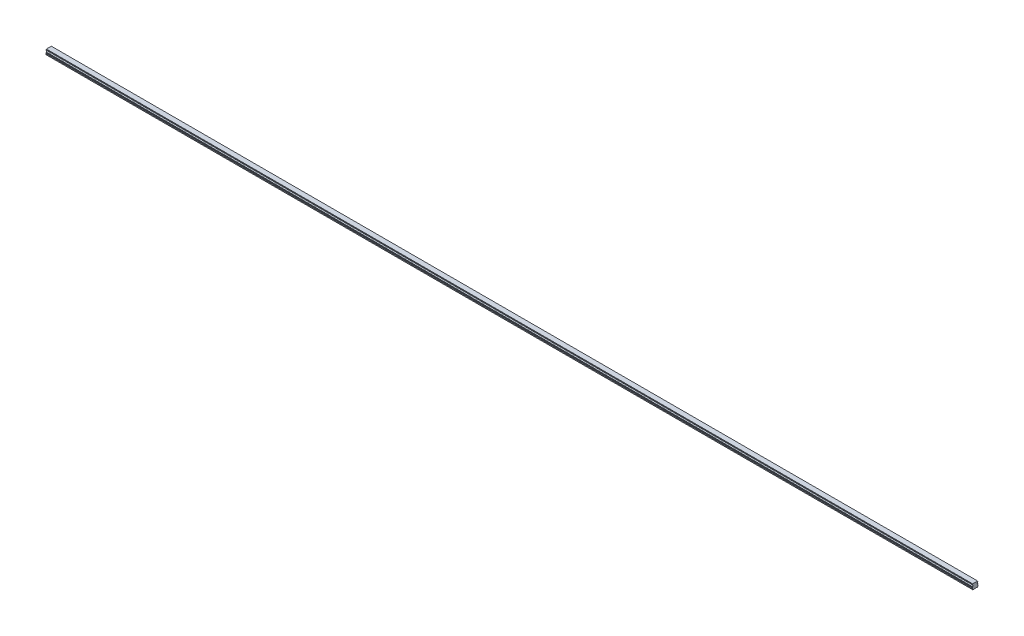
ISO-10303-21;
HEADER;
FILE_DESCRIPTION(('STEP AP214'),'2;1');
FILE_NAME('part.step','',(''),(''),'','','');
FILE_SCHEMA(('AUTOMOTIVE_DESIGN { 1 0 10303 214 1 1 1 1 }'));
ENDSEC;
DATA;
#1=APPLICATION_CONTEXT('core data for automotive mechanical design processes');
#2=APPLICATION_PROTOCOL_DEFINITION('international standard','automotive_design',2000,#1);
#3=PRODUCT_CONTEXT('',#1,'mechanical');
#4=PRODUCT('Part','Part','',(#3));
#5=PRODUCT_RELATED_PRODUCT_CATEGORY('part','',(#4));
#6=PRODUCT_DEFINITION_FORMATION('','',#4);
#7=PRODUCT_DEFINITION_CONTEXT('part definition',#1,'design');
#8=PRODUCT_DEFINITION('design','',#6,#7);
#9=PRODUCT_DEFINITION_SHAPE('','',#8);
#10=(LENGTH_UNIT() NAMED_UNIT(*) SI_UNIT(.MILLI.,.METRE.));
#11=(NAMED_UNIT(*) PLANE_ANGLE_UNIT() SI_UNIT($,.RADIAN.));
#12=(NAMED_UNIT(*) SI_UNIT($,.STERADIAN.) SOLID_ANGLE_UNIT());
#13=UNCERTAINTY_MEASURE_WITH_UNIT(LENGTH_MEASURE(1.E-05),#10,'distance_accuracy_value','');
#14=(GEOMETRIC_REPRESENTATION_CONTEXT(3) GLOBAL_UNCERTAINTY_ASSIGNED_CONTEXT((#13)) GLOBAL_UNIT_ASSIGNED_CONTEXT((#10,
#11,#12)) REPRESENTATION_CONTEXT('',''));
#15=CARTESIAN_POINT('',(0.,0.,0.));
#16=DIRECTION('',(0.,0.,1.));
#17=DIRECTION('',(1.,0.,0.));
#18=AXIS2_PLACEMENT_3D('',#15,#16,#17);
#19=CARTESIAN_POINT('',(2430.,0.399999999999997,0.));
#20=DIRECTION('',(0.,-1.,0.));
#21=DIRECTION('',(0.,0.,-1.));
#22=AXIS2_PLACEMENT_3D('',#19,#20,#21);
#23=CONICAL_SURFACE('',#22,2.89999999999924,0.785398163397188);
#24=CARTESIAN_POINT('',(2430.,0.799999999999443,0.));
#25=DIRECTION('',(0.,1.,0.));
#26=DIRECTION('',(0.,0.,1.));
#27=AXIS2_PLACEMENT_3D('',#24,#25,#26);
#28=CIRCLE('',#27,2.5);
#29=CARTESIAN_POINT('',(2430.,0.799999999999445,2.5));
#30=VERTEX_POINT('',#29);
#31=EDGE_CURVE('E11',#30,#30,#28,.F.);
#32=ORIENTED_EDGE('',*,*,#31,.F.);
#33=EDGE_LOOP('',(#32));
#34=FACE_BOUND('',#33,.T.);
#35=CARTESIAN_POINT('',(2430.,0.399999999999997,0.));
#36=DIRECTION('',(0.,1.,0.));
#37=DIRECTION('',(0.,0.,1.));
#38=AXIS2_PLACEMENT_3D('',#35,#36,#37);
#39=CIRCLE('',#38,2.89999999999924);
#40=CARTESIAN_POINT('',(2430.,0.399999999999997,2.89999999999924));
#41=VERTEX_POINT('',#40);
#42=EDGE_CURVE('E889',#41,#41,#39,.T.);
#43=ORIENTED_EDGE('',*,*,#42,.F.);
#44=EDGE_LOOP('',(#43));
#45=FACE_BOUND('',#44,.T.);
#46=ADVANCED_FACE('F39',(#34,#45),#23,.F.);
#47=CARTESIAN_POINT('',(2430.,7.,0.));
#48=DIRECTION('',(0.,-1.,0.));
#49=DIRECTION('',(0.,0.,-1.));
#50=AXIS2_PLACEMENT_3D('',#47,#48,#49);
#51=CYLINDRICAL_SURFACE('',#50,2.5);
#52=ORIENTED_EDGE('',*,*,#31,.T.);
#53=EDGE_LOOP('',(#52));
#54=FACE_BOUND('',#53,.T.);
#55=CARTESIAN_POINT('',(2430.,7.,0.));
#56=DIRECTION('',(0.,-1.,0.));
#57=DIRECTION('',(0.,0.,-1.));
#58=AXIS2_PLACEMENT_3D('',#55,#56,#57);
#59=CIRCLE('',#58,2.5);
#60=CARTESIAN_POINT('',(2430.,7.,-2.50000000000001));
#61=VERTEX_POINT('',#60);
#62=EDGE_CURVE('E49',#61,#61,#59,.T.);
#63=ORIENTED_EDGE('',*,*,#62,.F.);
#64=EDGE_LOOP('',(#63));
#65=FACE_BOUND('',#64,.T.);
#66=ADVANCED_FACE('F1324',(#54,#65),#51,.F.);
#67=CARTESIAN_POINT('',(2430.,7.,0.));
#68=DIRECTION('',(0.,-1.,0.));
#69=DIRECTION('',(0.,0.,-1.));
#70=AXIS2_PLACEMENT_3D('',#67,#68,#69);
#71=PLANE('',#70);
#72=CARTESIAN_POINT('',(2430.,7.,0.));
#73=DIRECTION('',(0.,-1.,0.));
#74=DIRECTION('',(0.,0.,-1.));
#75=AXIS2_PLACEMENT_3D('',#72,#73,#74);
#76=CIRCLE('',#75,2.1);
#77=CARTESIAN_POINT('',(2430.,7.,-2.1));
#78=VERTEX_POINT('',#77);
#79=EDGE_CURVE('E42',#78,#78,#76,.T.);
#80=ORIENTED_EDGE('',*,*,#79,.F.);
#81=EDGE_LOOP('',(#80));
#82=FACE_BOUND('',#81,.T.);
#83=ORIENTED_EDGE('',*,*,#62,.T.);
#84=EDGE_LOOP('',(#83));
#85=FACE_BOUND('',#84,.T.);
#86=ADVANCED_FACE('F1329',(#82,#85),#71,.T.);
#87=CARTESIAN_POINT('',(2370.,0.399999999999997,0.));
#88=DIRECTION('',(0.,-1.,0.));
#89=DIRECTION('',(0.,0.,-1.));
#90=AXIS2_PLACEMENT_3D('',#87,#88,#89);
#91=CONICAL_SURFACE('',#90,2.89999999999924,0.785398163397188);
#92=CARTESIAN_POINT('',(2370.,0.799999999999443,0.));
#93=DIRECTION('',(0.,1.,0.));
#94=DIRECTION('',(0.,0.,1.));
#95=AXIS2_PLACEMENT_3D('',#92,#93,#94);
#96=CIRCLE('',#95,2.5);
#97=CARTESIAN_POINT('',(2370.,0.799999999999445,2.5));
#98=VERTEX_POINT('',#97);
#99=EDGE_CURVE('E885',#98,#98,#96,.F.);
#100=ORIENTED_EDGE('',*,*,#99,.F.);
#101=EDGE_LOOP('',(#100));
#102=FACE_BOUND('',#101,.T.);
#103=CARTESIAN_POINT('',(2370.,0.399999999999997,0.));
#104=DIRECTION('',(0.,1.,0.));
#105=DIRECTION('',(0.,0.,1.));
#106=AXIS2_PLACEMENT_3D('',#103,#104,#105);
#107=CIRCLE('',#106,2.89999999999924);
#108=CARTESIAN_POINT('',(2370.,0.399999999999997,2.89999999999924));
#109=VERTEX_POINT('',#108);
#110=EDGE_CURVE('E877',#109,#109,#107,.T.);
#111=ORIENTED_EDGE('',*,*,#110,.F.);
#112=EDGE_LOOP('',(#111));
#113=FACE_BOUND('',#112,.T.);
#114=ADVANCED_FACE('F1860',(#102,#113),#91,.F.);
#115=CARTESIAN_POINT('',(2370.,7.,0.));
#116=DIRECTION('',(0.,-1.,0.));
#117=DIRECTION('',(0.,0.,-1.));
#118=AXIS2_PLACEMENT_3D('',#115,#116,#117);
#119=CYLINDRICAL_SURFACE('',#118,2.5);
#120=ORIENTED_EDGE('',*,*,#99,.T.);
#121=EDGE_LOOP('',(#120));
#122=FACE_BOUND('',#121,.T.);
#123=CARTESIAN_POINT('',(2370.,7.,0.));
#124=DIRECTION('',(0.,-1.,0.));
#125=DIRECTION('',(0.,0.,-1.));
#126=AXIS2_PLACEMENT_3D('',#123,#124,#125);
#127=CIRCLE('',#126,2.5);
#128=CARTESIAN_POINT('',(2370.,7.,-2.50000000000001));
#129=VERTEX_POINT('',#128);
#130=EDGE_CURVE('E881',#129,#129,#127,.T.);
#131=ORIENTED_EDGE('',*,*,#130,.F.);
#132=EDGE_LOOP('',(#131));
#133=FACE_BOUND('',#132,.T.);
#134=ADVANCED_FACE('F1856',(#122,#133),#119,.F.);
#135=CARTESIAN_POINT('',(2370.,7.,0.));
#136=DIRECTION('',(0.,-1.,0.));
#137=DIRECTION('',(0.,0.,-1.));
#138=AXIS2_PLACEMENT_3D('',#135,#136,#137);
#139=PLANE('',#138);
#140=CARTESIAN_POINT('',(2370.,7.,0.));
#141=DIRECTION('',(0.,-1.,0.));
#142=DIRECTION('',(0.,0.,-1.));
#143=AXIS2_PLACEMENT_3D('',#140,#141,#142);
#144=CIRCLE('',#143,2.1);
#145=CARTESIAN_POINT('',(2370.,7.,-2.1));
#146=VERTEX_POINT('',#145);
#147=EDGE_CURVE('E1048',#146,#146,#144,.T.);
#148=ORIENTED_EDGE('',*,*,#147,.F.);
#149=EDGE_LOOP('',(#148));
#150=FACE_BOUND('',#149,.T.);
#151=ORIENTED_EDGE('',*,*,#130,.T.);
#152=EDGE_LOOP('',(#151));
#153=FACE_BOUND('',#152,.T.);
#154=ADVANCED_FACE('F1852',(#150,#153),#139,.T.);
#155=CARTESIAN_POINT('',(2310.,0.399999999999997,0.));
#156=DIRECTION('',(0.,-1.,0.));
#157=DIRECTION('',(0.,0.,-1.));
#158=AXIS2_PLACEMENT_3D('',#155,#156,#157);
#159=CONICAL_SURFACE('',#158,2.89999999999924,0.785398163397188);
#160=CARTESIAN_POINT('',(2310.,0.799999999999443,0.));
#161=DIRECTION('',(0.,1.,0.));
#162=DIRECTION('',(0.,0.,1.));
#163=AXIS2_PLACEMENT_3D('',#160,#161,#162);
#164=CIRCLE('',#163,2.5);
#165=CARTESIAN_POINT('',(2310.,0.799999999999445,2.5));
#166=VERTEX_POINT('',#165);
#167=EDGE_CURVE('E873',#166,#166,#164,.F.);
#168=ORIENTED_EDGE('',*,*,#167,.F.);
#169=EDGE_LOOP('',(#168));
#170=FACE_BOUND('',#169,.T.);
#171=CARTESIAN_POINT('',(2310.,0.399999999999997,0.));
#172=DIRECTION('',(0.,1.,0.));
#173=DIRECTION('',(0.,0.,1.));
#174=AXIS2_PLACEMENT_3D('',#171,#172,#173);
#175=CIRCLE('',#174,2.89999999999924);
#176=CARTESIAN_POINT('',(2310.,0.399999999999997,2.89999999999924));
#177=VERTEX_POINT('',#176);
#178=EDGE_CURVE('E865',#177,#177,#175,.T.);
#179=ORIENTED_EDGE('',*,*,#178,.F.);
#180=EDGE_LOOP('',(#179));
#181=FACE_BOUND('',#180,.T.);
#182=ADVANCED_FACE('F1848',(#170,#181),#159,.F.);
#183=CARTESIAN_POINT('',(2310.,7.,0.));
#184=DIRECTION('',(0.,-1.,0.));
#185=DIRECTION('',(0.,0.,-1.));
#186=AXIS2_PLACEMENT_3D('',#183,#184,#185);
#187=CYLINDRICAL_SURFACE('',#186,2.5);
#188=ORIENTED_EDGE('',*,*,#167,.T.);
#189=EDGE_LOOP('',(#188));
#190=FACE_BOUND('',#189,.T.);
#191=CARTESIAN_POINT('',(2310.,7.,0.));
#192=DIRECTION('',(0.,-1.,0.));
#193=DIRECTION('',(0.,0.,-1.));
#194=AXIS2_PLACEMENT_3D('',#191,#192,#193);
#195=CIRCLE('',#194,2.5);
#196=CARTESIAN_POINT('',(2310.,7.,-2.50000000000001));
#197=VERTEX_POINT('',#196);
#198=EDGE_CURVE('E869',#197,#197,#195,.T.);
#199=ORIENTED_EDGE('',*,*,#198,.F.);
#200=EDGE_LOOP('',(#199));
#201=FACE_BOUND('',#200,.T.);
#202=ADVANCED_FACE('F1844',(#190,#201),#187,.F.);
#203=CARTESIAN_POINT('',(2310.,7.,0.));
#204=DIRECTION('',(0.,-1.,0.));
#205=DIRECTION('',(0.,0.,-1.));
#206=AXIS2_PLACEMENT_3D('',#203,#204,#205);
#207=PLANE('',#206);
#208=CARTESIAN_POINT('',(2310.,7.,0.));
#209=DIRECTION('',(0.,-1.,0.));
#210=DIRECTION('',(0.,0.,-1.));
#211=AXIS2_PLACEMENT_3D('',#208,#209,#210);
#212=CIRCLE('',#211,2.1);
#213=CARTESIAN_POINT('',(2310.,7.,-2.1));
#214=VERTEX_POINT('',#213);
#215=EDGE_CURVE('E1045',#214,#214,#212,.T.);
#216=ORIENTED_EDGE('',*,*,#215,.F.);
#217=EDGE_LOOP('',(#216));
#218=FACE_BOUND('',#217,.T.);
#219=ORIENTED_EDGE('',*,*,#198,.T.);
#220=EDGE_LOOP('',(#219));
#221=FACE_BOUND('',#220,.T.);
#222=ADVANCED_FACE('F1840',(#218,#221),#207,.T.);
#223=CARTESIAN_POINT('',(2250.,0.399999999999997,0.));
#224=DIRECTION('',(0.,-1.,0.));
#225=DIRECTION('',(0.,0.,-1.));
#226=AXIS2_PLACEMENT_3D('',#223,#224,#225);
#227=CONICAL_SURFACE('',#226,2.89999999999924,0.785398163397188);
#228=CARTESIAN_POINT('',(2250.,0.799999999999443,0.));
#229=DIRECTION('',(0.,1.,0.));
#230=DIRECTION('',(0.,0.,1.));
#231=AXIS2_PLACEMENT_3D('',#228,#229,#230);
#232=CIRCLE('',#231,2.5);
#233=CARTESIAN_POINT('',(2250.,0.799999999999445,2.5));
#234=VERTEX_POINT('',#233);
#235=EDGE_CURVE('E861',#234,#234,#232,.F.);
#236=ORIENTED_EDGE('',*,*,#235,.F.);
#237=EDGE_LOOP('',(#236));
#238=FACE_BOUND('',#237,.T.);
#239=CARTESIAN_POINT('',(2250.,0.399999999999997,0.));
#240=DIRECTION('',(0.,1.,0.));
#241=DIRECTION('',(0.,0.,1.));
#242=AXIS2_PLACEMENT_3D('',#239,#240,#241);
#243=CIRCLE('',#242,2.89999999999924);
#244=CARTESIAN_POINT('',(2250.,0.399999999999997,2.89999999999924));
#245=VERTEX_POINT('',#244);
#246=EDGE_CURVE('E853',#245,#245,#243,.T.);
#247=ORIENTED_EDGE('',*,*,#246,.F.);
#248=EDGE_LOOP('',(#247));
#249=FACE_BOUND('',#248,.T.);
#250=ADVANCED_FACE('F1836',(#238,#249),#227,.F.);
#251=CARTESIAN_POINT('',(2250.,7.,0.));
#252=DIRECTION('',(0.,-1.,0.));
#253=DIRECTION('',(0.,0.,-1.));
#254=AXIS2_PLACEMENT_3D('',#251,#252,#253);
#255=CYLINDRICAL_SURFACE('',#254,2.5);
#256=ORIENTED_EDGE('',*,*,#235,.T.);
#257=EDGE_LOOP('',(#256));
#258=FACE_BOUND('',#257,.T.);
#259=CARTESIAN_POINT('',(2250.,7.,0.));
#260=DIRECTION('',(0.,-1.,0.));
#261=DIRECTION('',(0.,0.,-1.));
#262=AXIS2_PLACEMENT_3D('',#259,#260,#261);
#263=CIRCLE('',#262,2.5);
#264=CARTESIAN_POINT('',(2250.,7.,-2.50000000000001));
#265=VERTEX_POINT('',#264);
#266=EDGE_CURVE('E857',#265,#265,#263,.T.);
#267=ORIENTED_EDGE('',*,*,#266,.F.);
#268=EDGE_LOOP('',(#267));
#269=FACE_BOUND('',#268,.T.);
#270=ADVANCED_FACE('F1832',(#258,#269),#255,.F.);
#271=CARTESIAN_POINT('',(2250.,7.,0.));
#272=DIRECTION('',(0.,-1.,0.));
#273=DIRECTION('',(0.,0.,-1.));
#274=AXIS2_PLACEMENT_3D('',#271,#272,#273);
#275=PLANE('',#274);
#276=CARTESIAN_POINT('',(2250.,7.,0.));
#277=DIRECTION('',(0.,-1.,0.));
#278=DIRECTION('',(0.,0.,-1.));
#279=AXIS2_PLACEMENT_3D('',#276,#277,#278);
#280=CIRCLE('',#279,2.1);
#281=CARTESIAN_POINT('',(2250.,7.,-2.1));
#282=VERTEX_POINT('',#281);
#283=EDGE_CURVE('E1041',#282,#282,#280,.T.);
#284=ORIENTED_EDGE('',*,*,#283,.F.);
#285=EDGE_LOOP('',(#284));
#286=FACE_BOUND('',#285,.T.);
#287=ORIENTED_EDGE('',*,*,#266,.T.);
#288=EDGE_LOOP('',(#287));
#289=FACE_BOUND('',#288,.T.);
#290=ADVANCED_FACE('F1828',(#286,#289),#275,.T.);
#291=CARTESIAN_POINT('',(2190.,0.399999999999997,0.));
#292=DIRECTION('',(0.,-1.,0.));
#293=DIRECTION('',(0.,0.,-1.));
#294=AXIS2_PLACEMENT_3D('',#291,#292,#293);
#295=CONICAL_SURFACE('',#294,2.89999999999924,0.785398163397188);
#296=CARTESIAN_POINT('',(2190.,0.799999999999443,0.));
#297=DIRECTION('',(0.,1.,0.));
#298=DIRECTION('',(0.,0.,1.));
#299=AXIS2_PLACEMENT_3D('',#296,#297,#298);
#300=CIRCLE('',#299,2.5);
#301=CARTESIAN_POINT('',(2190.,0.799999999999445,2.5));
#302=VERTEX_POINT('',#301);
#303=EDGE_CURVE('E849',#302,#302,#300,.F.);
#304=ORIENTED_EDGE('',*,*,#303,.F.);
#305=EDGE_LOOP('',(#304));
#306=FACE_BOUND('',#305,.T.);
#307=CARTESIAN_POINT('',(2190.,0.399999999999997,0.));
#308=DIRECTION('',(0.,1.,0.));
#309=DIRECTION('',(0.,0.,1.));
#310=AXIS2_PLACEMENT_3D('',#307,#308,#309);
#311=CIRCLE('',#310,2.89999999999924);
#312=CARTESIAN_POINT('',(2190.,0.399999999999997,2.89999999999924));
#313=VERTEX_POINT('',#312);
#314=EDGE_CURVE('E841',#313,#313,#311,.T.);
#315=ORIENTED_EDGE('',*,*,#314,.F.);
#316=EDGE_LOOP('',(#315));
#317=FACE_BOUND('',#316,.T.);
#318=ADVANCED_FACE('F1824',(#306,#317),#295,.F.);
#319=CARTESIAN_POINT('',(2190.,7.,0.));
#320=DIRECTION('',(0.,-1.,0.));
#321=DIRECTION('',(0.,0.,-1.));
#322=AXIS2_PLACEMENT_3D('',#319,#320,#321);
#323=CYLINDRICAL_SURFACE('',#322,2.5);
#324=ORIENTED_EDGE('',*,*,#303,.T.);
#325=EDGE_LOOP('',(#324));
#326=FACE_BOUND('',#325,.T.);
#327=CARTESIAN_POINT('',(2190.,7.,0.));
#328=DIRECTION('',(0.,-1.,0.));
#329=DIRECTION('',(0.,0.,-1.));
#330=AXIS2_PLACEMENT_3D('',#327,#328,#329);
#331=CIRCLE('',#330,2.5);
#332=CARTESIAN_POINT('',(2190.,7.,-2.50000000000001));
#333=VERTEX_POINT('',#332);
#334=EDGE_CURVE('E845',#333,#333,#331,.T.);
#335=ORIENTED_EDGE('',*,*,#334,.F.);
#336=EDGE_LOOP('',(#335));
#337=FACE_BOUND('',#336,.T.);
#338=ADVANCED_FACE('F1820',(#326,#337),#323,.F.);
#339=CARTESIAN_POINT('',(2190.,7.,0.));
#340=DIRECTION('',(0.,-1.,0.));
#341=DIRECTION('',(0.,0.,-1.));
#342=AXIS2_PLACEMENT_3D('',#339,#340,#341);
#343=PLANE('',#342);
#344=CARTESIAN_POINT('',(2190.,7.,0.));
#345=DIRECTION('',(0.,-1.,0.));
#346=DIRECTION('',(0.,0.,-1.));
#347=AXIS2_PLACEMENT_3D('',#344,#345,#346);
#348=CIRCLE('',#347,2.1);
#349=CARTESIAN_POINT('',(2190.,7.,-2.1));
#350=VERTEX_POINT('',#349);
#351=EDGE_CURVE('E1037',#350,#350,#348,.T.);
#352=ORIENTED_EDGE('',*,*,#351,.F.);
#353=EDGE_LOOP('',(#352));
#354=FACE_BOUND('',#353,.T.);
#355=ORIENTED_EDGE('',*,*,#334,.T.);
#356=EDGE_LOOP('',(#355));
#357=FACE_BOUND('',#356,.T.);
#358=ADVANCED_FACE('F1816',(#354,#357),#343,.T.);
#359=CARTESIAN_POINT('',(2130.,0.399999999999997,0.));
#360=DIRECTION('',(0.,-1.,0.));
#361=DIRECTION('',(0.,0.,-1.));
#362=AXIS2_PLACEMENT_3D('',#359,#360,#361);
#363=CONICAL_SURFACE('',#362,2.89999999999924,0.785398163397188);
#364=CARTESIAN_POINT('',(2130.,0.799999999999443,0.));
#365=DIRECTION('',(0.,1.,0.));
#366=DIRECTION('',(0.,0.,1.));
#367=AXIS2_PLACEMENT_3D('',#364,#365,#366);
#368=CIRCLE('',#367,2.5);
#369=CARTESIAN_POINT('',(2130.,0.799999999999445,2.5));
#370=VERTEX_POINT('',#369);
#371=EDGE_CURVE('E837',#370,#370,#368,.F.);
#372=ORIENTED_EDGE('',*,*,#371,.F.);
#373=EDGE_LOOP('',(#372));
#374=FACE_BOUND('',#373,.T.);
#375=CARTESIAN_POINT('',(2130.,0.399999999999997,0.));
#376=DIRECTION('',(0.,1.,0.));
#377=DIRECTION('',(0.,0.,1.));
#378=AXIS2_PLACEMENT_3D('',#375,#376,#377);
#379=CIRCLE('',#378,2.89999999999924);
#380=CARTESIAN_POINT('',(2130.,0.399999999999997,2.89999999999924));
#381=VERTEX_POINT('',#380);
#382=EDGE_CURVE('E829',#381,#381,#379,.T.);
#383=ORIENTED_EDGE('',*,*,#382,.F.);
#384=EDGE_LOOP('',(#383));
#385=FACE_BOUND('',#384,.T.);
#386=ADVANCED_FACE('F1812',(#374,#385),#363,.F.);
#387=CARTESIAN_POINT('',(2130.,7.,0.));
#388=DIRECTION('',(0.,-1.,0.));
#389=DIRECTION('',(0.,0.,-1.));
#390=AXIS2_PLACEMENT_3D('',#387,#388,#389);
#391=CYLINDRICAL_SURFACE('',#390,2.5);
#392=ORIENTED_EDGE('',*,*,#371,.T.);
#393=EDGE_LOOP('',(#392));
#394=FACE_BOUND('',#393,.T.);
#395=CARTESIAN_POINT('',(2130.,7.,0.));
#396=DIRECTION('',(0.,-1.,0.));
#397=DIRECTION('',(0.,0.,-1.));
#398=AXIS2_PLACEMENT_3D('',#395,#396,#397);
#399=CIRCLE('',#398,2.5);
#400=CARTESIAN_POINT('',(2130.,7.,-2.50000000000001));
#401=VERTEX_POINT('',#400);
#402=EDGE_CURVE('E833',#401,#401,#399,.T.);
#403=ORIENTED_EDGE('',*,*,#402,.F.);
#404=EDGE_LOOP('',(#403));
#405=FACE_BOUND('',#404,.T.);
#406=ADVANCED_FACE('F1808',(#394,#405),#391,.F.);
#407=CARTESIAN_POINT('',(2130.,7.,0.));
#408=DIRECTION('',(0.,-1.,0.));
#409=DIRECTION('',(0.,0.,-1.));
#410=AXIS2_PLACEMENT_3D('',#407,#408,#409);
#411=PLANE('',#410);
#412=CARTESIAN_POINT('',(2130.,7.,0.));
#413=DIRECTION('',(0.,-1.,0.));
#414=DIRECTION('',(0.,0.,-1.));
#415=AXIS2_PLACEMENT_3D('',#412,#413,#414);
#416=CIRCLE('',#415,2.1);
#417=CARTESIAN_POINT('',(2130.,7.,-2.1));
#418=VERTEX_POINT('',#417);
#419=EDGE_CURVE('E1033',#418,#418,#416,.T.);
#420=ORIENTED_EDGE('',*,*,#419,.F.);
#421=EDGE_LOOP('',(#420));
#422=FACE_BOUND('',#421,.T.);
#423=ORIENTED_EDGE('',*,*,#402,.T.);
#424=EDGE_LOOP('',(#423));
#425=FACE_BOUND('',#424,.T.);
#426=ADVANCED_FACE('F1804',(#422,#425),#411,.T.);
#427=CARTESIAN_POINT('',(2070.,0.399999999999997,0.));
#428=DIRECTION('',(0.,-1.,0.));
#429=DIRECTION('',(0.,0.,-1.));
#430=AXIS2_PLACEMENT_3D('',#427,#428,#429);
#431=CONICAL_SURFACE('',#430,2.89999999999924,0.785398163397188);
#432=CARTESIAN_POINT('',(2070.,0.799999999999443,0.));
#433=DIRECTION('',(0.,1.,0.));
#434=DIRECTION('',(0.,0.,1.));
#435=AXIS2_PLACEMENT_3D('',#432,#433,#434);
#436=CIRCLE('',#435,2.5);
#437=CARTESIAN_POINT('',(2070.,0.799999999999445,2.5));
#438=VERTEX_POINT('',#437);
#439=EDGE_CURVE('E825',#438,#438,#436,.F.);
#440=ORIENTED_EDGE('',*,*,#439,.F.);
#441=EDGE_LOOP('',(#440));
#442=FACE_BOUND('',#441,.T.);
#443=CARTESIAN_POINT('',(2070.,0.399999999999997,0.));
#444=DIRECTION('',(0.,1.,0.));
#445=DIRECTION('',(0.,0.,1.));
#446=AXIS2_PLACEMENT_3D('',#443,#444,#445);
#447=CIRCLE('',#446,2.89999999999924);
#448=CARTESIAN_POINT('',(2070.,0.399999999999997,2.89999999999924));
#449=VERTEX_POINT('',#448);
#450=EDGE_CURVE('E817',#449,#449,#447,.T.);
#451=ORIENTED_EDGE('',*,*,#450,.F.);
#452=EDGE_LOOP('',(#451));
#453=FACE_BOUND('',#452,.T.);
#454=ADVANCED_FACE('F1800',(#442,#453),#431,.F.);
#455=CARTESIAN_POINT('',(2070.,7.,0.));
#456=DIRECTION('',(0.,-1.,0.));
#457=DIRECTION('',(0.,0.,-1.));
#458=AXIS2_PLACEMENT_3D('',#455,#456,#457);
#459=CYLINDRICAL_SURFACE('',#458,2.5);
#460=ORIENTED_EDGE('',*,*,#439,.T.);
#461=EDGE_LOOP('',(#460));
#462=FACE_BOUND('',#461,.T.);
#463=CARTESIAN_POINT('',(2070.,7.,0.));
#464=DIRECTION('',(0.,-1.,0.));
#465=DIRECTION('',(0.,0.,-1.));
#466=AXIS2_PLACEMENT_3D('',#463,#464,#465);
#467=CIRCLE('',#466,2.5);
#468=CARTESIAN_POINT('',(2070.,7.,-2.50000000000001));
#469=VERTEX_POINT('',#468);
#470=EDGE_CURVE('E821',#469,#469,#467,.T.);
#471=ORIENTED_EDGE('',*,*,#470,.F.);
#472=EDGE_LOOP('',(#471));
#473=FACE_BOUND('',#472,.T.);
#474=ADVANCED_FACE('F1796',(#462,#473),#459,.F.);
#475=CARTESIAN_POINT('',(2070.,7.,0.));
#476=DIRECTION('',(0.,-1.,0.));
#477=DIRECTION('',(0.,0.,-1.));
#478=AXIS2_PLACEMENT_3D('',#475,#476,#477);
#479=PLANE('',#478);
#480=CARTESIAN_POINT('',(2070.,7.,0.));
#481=DIRECTION('',(0.,-1.,0.));
#482=DIRECTION('',(0.,0.,-1.));
#483=AXIS2_PLACEMENT_3D('',#480,#481,#482);
#484=CIRCLE('',#483,2.1);
#485=CARTESIAN_POINT('',(2070.,7.,-2.1));
#486=VERTEX_POINT('',#485);
#487=EDGE_CURVE('E1029',#486,#486,#484,.T.);
#488=ORIENTED_EDGE('',*,*,#487,.F.);
#489=EDGE_LOOP('',(#488));
#490=FACE_BOUND('',#489,.T.);
#491=ORIENTED_EDGE('',*,*,#470,.T.);
#492=EDGE_LOOP('',(#491));
#493=FACE_BOUND('',#492,.T.);
#494=ADVANCED_FACE('F1792',(#490,#493),#479,.T.);
#495=CARTESIAN_POINT('',(2010.,0.399999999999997,0.));
#496=DIRECTION('',(0.,-1.,0.));
#497=DIRECTION('',(0.,0.,-1.));
#498=AXIS2_PLACEMENT_3D('',#495,#496,#497);
#499=CONICAL_SURFACE('',#498,2.89999999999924,0.785398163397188);
#500=CARTESIAN_POINT('',(2010.,0.799999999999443,0.));
#501=DIRECTION('',(0.,1.,0.));
#502=DIRECTION('',(0.,0.,1.));
#503=AXIS2_PLACEMENT_3D('',#500,#501,#502);
#504=CIRCLE('',#503,2.5);
#505=CARTESIAN_POINT('',(2010.,0.799999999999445,2.5));
#506=VERTEX_POINT('',#505);
#507=EDGE_CURVE('E813',#506,#506,#504,.F.);
#508=ORIENTED_EDGE('',*,*,#507,.F.);
#509=EDGE_LOOP('',(#508));
#510=FACE_BOUND('',#509,.T.);
#511=CARTESIAN_POINT('',(2010.,0.399999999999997,0.));
#512=DIRECTION('',(0.,1.,0.));
#513=DIRECTION('',(0.,0.,1.));
#514=AXIS2_PLACEMENT_3D('',#511,#512,#513);
#515=CIRCLE('',#514,2.89999999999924);
#516=CARTESIAN_POINT('',(2010.,0.399999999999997,2.89999999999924));
#517=VERTEX_POINT('',#516);
#518=EDGE_CURVE('E805',#517,#517,#515,.T.);
#519=ORIENTED_EDGE('',*,*,#518,.F.);
#520=EDGE_LOOP('',(#519));
#521=FACE_BOUND('',#520,.T.);
#522=ADVANCED_FACE('F1788',(#510,#521),#499,.F.);
#523=CARTESIAN_POINT('',(2010.,7.,0.));
#524=DIRECTION('',(0.,-1.,0.));
#525=DIRECTION('',(0.,0.,-1.));
#526=AXIS2_PLACEMENT_3D('',#523,#524,#525);
#527=CYLINDRICAL_SURFACE('',#526,2.5);
#528=ORIENTED_EDGE('',*,*,#507,.T.);
#529=EDGE_LOOP('',(#528));
#530=FACE_BOUND('',#529,.T.);
#531=CARTESIAN_POINT('',(2010.,7.,0.));
#532=DIRECTION('',(0.,-1.,0.));
#533=DIRECTION('',(0.,0.,-1.));
#534=AXIS2_PLACEMENT_3D('',#531,#532,#533);
#535=CIRCLE('',#534,2.5);
#536=CARTESIAN_POINT('',(2010.,7.,-2.50000000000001));
#537=VERTEX_POINT('',#536);
#538=EDGE_CURVE('E809',#537,#537,#535,.T.);
#539=ORIENTED_EDGE('',*,*,#538,.F.);
#540=EDGE_LOOP('',(#539));
#541=FACE_BOUND('',#540,.T.);
#542=ADVANCED_FACE('F1784',(#530,#541),#527,.F.);
#543=CARTESIAN_POINT('',(2010.,7.,0.));
#544=DIRECTION('',(0.,-1.,0.));
#545=DIRECTION('',(0.,0.,-1.));
#546=AXIS2_PLACEMENT_3D('',#543,#544,#545);
#547=PLANE('',#546);
#548=CARTESIAN_POINT('',(2010.,7.,0.));
#549=DIRECTION('',(0.,-1.,0.));
#550=DIRECTION('',(0.,0.,-1.));
#551=AXIS2_PLACEMENT_3D('',#548,#549,#550);
#552=CIRCLE('',#551,2.1);
#553=CARTESIAN_POINT('',(2010.,7.,-2.1));
#554=VERTEX_POINT('',#553);
#555=EDGE_CURVE('E1025',#554,#554,#552,.T.);
#556=ORIENTED_EDGE('',*,*,#555,.F.);
#557=EDGE_LOOP('',(#556));
#558=FACE_BOUND('',#557,.T.);
#559=ORIENTED_EDGE('',*,*,#538,.T.);
#560=EDGE_LOOP('',(#559));
#561=FACE_BOUND('',#560,.T.);
#562=ADVANCED_FACE('F1780',(#558,#561),#547,.T.);
#563=CARTESIAN_POINT('',(1950.,0.399999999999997,0.));
#564=DIRECTION('',(0.,-1.,0.));
#565=DIRECTION('',(0.,0.,-1.));
#566=AXIS2_PLACEMENT_3D('',#563,#564,#565);
#567=CONICAL_SURFACE('',#566,2.89999999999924,0.785398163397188);
#568=CARTESIAN_POINT('',(1950.,0.799999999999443,0.));
#569=DIRECTION('',(0.,1.,0.));
#570=DIRECTION('',(0.,0.,1.));
#571=AXIS2_PLACEMENT_3D('',#568,#569,#570);
#572=CIRCLE('',#571,2.5);
#573=CARTESIAN_POINT('',(1950.,0.799999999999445,2.5));
#574=VERTEX_POINT('',#573);
#575=EDGE_CURVE('E801',#574,#574,#572,.F.);
#576=ORIENTED_EDGE('',*,*,#575,.F.);
#577=EDGE_LOOP('',(#576));
#578=FACE_BOUND('',#577,.T.);
#579=CARTESIAN_POINT('',(1950.,0.399999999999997,0.));
#580=DIRECTION('',(0.,1.,0.));
#581=DIRECTION('',(0.,0.,1.));
#582=AXIS2_PLACEMENT_3D('',#579,#580,#581);
#583=CIRCLE('',#582,2.89999999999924);
#584=CARTESIAN_POINT('',(1950.,0.399999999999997,2.89999999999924));
#585=VERTEX_POINT('',#584);
#586=EDGE_CURVE('E793',#585,#585,#583,.T.);
#587=ORIENTED_EDGE('',*,*,#586,.F.);
#588=EDGE_LOOP('',(#587));
#589=FACE_BOUND('',#588,.T.);
#590=ADVANCED_FACE('F1776',(#578,#589),#567,.F.);
#591=CARTESIAN_POINT('',(1950.,7.,0.));
#592=DIRECTION('',(0.,-1.,0.));
#593=DIRECTION('',(0.,0.,-1.));
#594=AXIS2_PLACEMENT_3D('',#591,#592,#593);
#595=CYLINDRICAL_SURFACE('',#594,2.5);
#596=ORIENTED_EDGE('',*,*,#575,.T.);
#597=EDGE_LOOP('',(#596));
#598=FACE_BOUND('',#597,.T.);
#599=CARTESIAN_POINT('',(1950.,7.,0.));
#600=DIRECTION('',(0.,-1.,0.));
#601=DIRECTION('',(0.,0.,-1.));
#602=AXIS2_PLACEMENT_3D('',#599,#600,#601);
#603=CIRCLE('',#602,2.5);
#604=CARTESIAN_POINT('',(1950.,7.,-2.50000000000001));
#605=VERTEX_POINT('',#604);
#606=EDGE_CURVE('E797',#605,#605,#603,.T.);
#607=ORIENTED_EDGE('',*,*,#606,.F.);
#608=EDGE_LOOP('',(#607));
#609=FACE_BOUND('',#608,.T.);
#610=ADVANCED_FACE('F1772',(#598,#609),#595,.F.);
#611=CARTESIAN_POINT('',(1950.,7.,0.));
#612=DIRECTION('',(0.,-1.,0.));
#613=DIRECTION('',(0.,0.,-1.));
#614=AXIS2_PLACEMENT_3D('',#611,#612,#613);
#615=PLANE('',#614);
#616=CARTESIAN_POINT('',(1950.,7.,0.));
#617=DIRECTION('',(0.,-1.,0.));
#618=DIRECTION('',(0.,0.,-1.));
#619=AXIS2_PLACEMENT_3D('',#616,#617,#618);
#620=CIRCLE('',#619,2.1);
#621=CARTESIAN_POINT('',(1950.,7.,-2.1));
#622=VERTEX_POINT('',#621);
#623=EDGE_CURVE('E1021',#622,#622,#620,.T.);
#624=ORIENTED_EDGE('',*,*,#623,.F.);
#625=EDGE_LOOP('',(#624));
#626=FACE_BOUND('',#625,.T.);
#627=ORIENTED_EDGE('',*,*,#606,.T.);
#628=EDGE_LOOP('',(#627));
#629=FACE_BOUND('',#628,.T.);
#630=ADVANCED_FACE('F1768',(#626,#629),#615,.T.);
#631=CARTESIAN_POINT('',(1890.,0.399999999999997,0.));
#632=DIRECTION('',(0.,-1.,0.));
#633=DIRECTION('',(0.,0.,-1.));
#634=AXIS2_PLACEMENT_3D('',#631,#632,#633);
#635=CONICAL_SURFACE('',#634,2.89999999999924,0.785398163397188);
#636=CARTESIAN_POINT('',(1890.,0.799999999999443,0.));
#637=DIRECTION('',(0.,1.,0.));
#638=DIRECTION('',(0.,0.,1.));
#639=AXIS2_PLACEMENT_3D('',#636,#637,#638);
#640=CIRCLE('',#639,2.5);
#641=CARTESIAN_POINT('',(1890.,0.799999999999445,2.5));
#642=VERTEX_POINT('',#641);
#643=EDGE_CURVE('E789',#642,#642,#640,.F.);
#644=ORIENTED_EDGE('',*,*,#643,.F.);
#645=EDGE_LOOP('',(#644));
#646=FACE_BOUND('',#645,.T.);
#647=CARTESIAN_POINT('',(1890.,0.399999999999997,0.));
#648=DIRECTION('',(0.,1.,0.));
#649=DIRECTION('',(0.,0.,1.));
#650=AXIS2_PLACEMENT_3D('',#647,#648,#649);
#651=CIRCLE('',#650,2.89999999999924);
#652=CARTESIAN_POINT('',(1890.,0.399999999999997,2.89999999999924));
#653=VERTEX_POINT('',#652);
#654=EDGE_CURVE('E781',#653,#653,#651,.T.);
#655=ORIENTED_EDGE('',*,*,#654,.F.);
#656=EDGE_LOOP('',(#655));
#657=FACE_BOUND('',#656,.T.);
#658=ADVANCED_FACE('F1764',(#646,#657),#635,.F.);
#659=CARTESIAN_POINT('',(1890.,7.,0.));
#660=DIRECTION('',(0.,-1.,0.));
#661=DIRECTION('',(0.,0.,-1.));
#662=AXIS2_PLACEMENT_3D('',#659,#660,#661);
#663=CYLINDRICAL_SURFACE('',#662,2.5);
#664=ORIENTED_EDGE('',*,*,#643,.T.);
#665=EDGE_LOOP('',(#664));
#666=FACE_BOUND('',#665,.T.);
#667=CARTESIAN_POINT('',(1890.,7.,0.));
#668=DIRECTION('',(0.,-1.,0.));
#669=DIRECTION('',(0.,0.,-1.));
#670=AXIS2_PLACEMENT_3D('',#667,#668,#669);
#671=CIRCLE('',#670,2.5);
#672=CARTESIAN_POINT('',(1890.,7.,-2.50000000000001));
#673=VERTEX_POINT('',#672);
#674=EDGE_CURVE('E785',#673,#673,#671,.T.);
#675=ORIENTED_EDGE('',*,*,#674,.F.);
#676=EDGE_LOOP('',(#675));
#677=FACE_BOUND('',#676,.T.);
#678=ADVANCED_FACE('F1760',(#666,#677),#663,.F.);
#679=CARTESIAN_POINT('',(1890.,7.,0.));
#680=DIRECTION('',(0.,-1.,0.));
#681=DIRECTION('',(0.,0.,-1.));
#682=AXIS2_PLACEMENT_3D('',#679,#680,#681);
#683=PLANE('',#682);
#684=CARTESIAN_POINT('',(1890.,7.,0.));
#685=DIRECTION('',(0.,-1.,0.));
#686=DIRECTION('',(0.,0.,-1.));
#687=AXIS2_PLACEMENT_3D('',#684,#685,#686);
#688=CIRCLE('',#687,2.1);
#689=CARTESIAN_POINT('',(1890.,7.,-2.1));
#690=VERTEX_POINT('',#689);
#691=EDGE_CURVE('E1017',#690,#690,#688,.T.);
#692=ORIENTED_EDGE('',*,*,#691,.F.);
#693=EDGE_LOOP('',(#692));
#694=FACE_BOUND('',#693,.T.);
#695=ORIENTED_EDGE('',*,*,#674,.T.);
#696=EDGE_LOOP('',(#695));
#697=FACE_BOUND('',#696,.T.);
#698=ADVANCED_FACE('F1756',(#694,#697),#683,.T.);
#699=CARTESIAN_POINT('',(1830.,0.399999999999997,0.));
#700=DIRECTION('',(0.,-1.,0.));
#701=DIRECTION('',(0.,0.,-1.));
#702=AXIS2_PLACEMENT_3D('',#699,#700,#701);
#703=CONICAL_SURFACE('',#702,2.89999999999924,0.785398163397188);
#704=CARTESIAN_POINT('',(1830.,0.799999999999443,0.));
#705=DIRECTION('',(0.,1.,0.));
#706=DIRECTION('',(0.,0.,1.));
#707=AXIS2_PLACEMENT_3D('',#704,#705,#706);
#708=CIRCLE('',#707,2.5);
#709=CARTESIAN_POINT('',(1830.,0.799999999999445,2.5));
#710=VERTEX_POINT('',#709);
#711=EDGE_CURVE('E777',#710,#710,#708,.F.);
#712=ORIENTED_EDGE('',*,*,#711,.F.);
#713=EDGE_LOOP('',(#712));
#714=FACE_BOUND('',#713,.T.);
#715=CARTESIAN_POINT('',(1830.,0.399999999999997,0.));
#716=DIRECTION('',(0.,1.,0.));
#717=DIRECTION('',(0.,0.,1.));
#718=AXIS2_PLACEMENT_3D('',#715,#716,#717);
#719=CIRCLE('',#718,2.89999999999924);
#720=CARTESIAN_POINT('',(1830.,0.399999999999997,2.89999999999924));
#721=VERTEX_POINT('',#720);
#722=EDGE_CURVE('E769',#721,#721,#719,.T.);
#723=ORIENTED_EDGE('',*,*,#722,.F.);
#724=EDGE_LOOP('',(#723));
#725=FACE_BOUND('',#724,.T.);
#726=ADVANCED_FACE('F1752',(#714,#725),#703,.F.);
#727=CARTESIAN_POINT('',(1830.,7.,0.));
#728=DIRECTION('',(0.,-1.,0.));
#729=DIRECTION('',(0.,0.,-1.));
#730=AXIS2_PLACEMENT_3D('',#727,#728,#729);
#731=CYLINDRICAL_SURFACE('',#730,2.5);
#732=ORIENTED_EDGE('',*,*,#711,.T.);
#733=EDGE_LOOP('',(#732));
#734=FACE_BOUND('',#733,.T.);
#735=CARTESIAN_POINT('',(1830.,7.,0.));
#736=DIRECTION('',(0.,-1.,0.));
#737=DIRECTION('',(0.,0.,-1.));
#738=AXIS2_PLACEMENT_3D('',#735,#736,#737);
#739=CIRCLE('',#738,2.5);
#740=CARTESIAN_POINT('',(1830.,7.,-2.50000000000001));
#741=VERTEX_POINT('',#740);
#742=EDGE_CURVE('E773',#741,#741,#739,.T.);
#743=ORIENTED_EDGE('',*,*,#742,.F.);
#744=EDGE_LOOP('',(#743));
#745=FACE_BOUND('',#744,.T.);
#746=ADVANCED_FACE('F1748',(#734,#745),#731,.F.);
#747=CARTESIAN_POINT('',(1830.,7.,0.));
#748=DIRECTION('',(0.,-1.,0.));
#749=DIRECTION('',(0.,0.,-1.));
#750=AXIS2_PLACEMENT_3D('',#747,#748,#749);
#751=PLANE('',#750);
#752=CARTESIAN_POINT('',(1830.,7.,0.));
#753=DIRECTION('',(0.,-1.,0.));
#754=DIRECTION('',(0.,0.,-1.));
#755=AXIS2_PLACEMENT_3D('',#752,#753,#754);
#756=CIRCLE('',#755,2.1);
#757=CARTESIAN_POINT('',(1830.,7.,-2.1));
#758=VERTEX_POINT('',#757);
#759=EDGE_CURVE('E1013',#758,#758,#756,.T.);
#760=ORIENTED_EDGE('',*,*,#759,.F.);
#761=EDGE_LOOP('',(#760));
#762=FACE_BOUND('',#761,.T.);
#763=ORIENTED_EDGE('',*,*,#742,.T.);
#764=EDGE_LOOP('',(#763));
#765=FACE_BOUND('',#764,.T.);
#766=ADVANCED_FACE('F1744',(#762,#765),#751,.T.);
#767=CARTESIAN_POINT('',(1770.,0.399999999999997,0.));
#768=DIRECTION('',(0.,-1.,0.));
#769=DIRECTION('',(0.,0.,-1.));
#770=AXIS2_PLACEMENT_3D('',#767,#768,#769);
#771=CONICAL_SURFACE('',#770,2.89999999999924,0.785398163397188);
#772=CARTESIAN_POINT('',(1770.,0.799999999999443,0.));
#773=DIRECTION('',(0.,1.,0.));
#774=DIRECTION('',(0.,0.,1.));
#775=AXIS2_PLACEMENT_3D('',#772,#773,#774);
#776=CIRCLE('',#775,2.5);
#777=CARTESIAN_POINT('',(1770.,0.799999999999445,2.5));
#778=VERTEX_POINT('',#777);
#779=EDGE_CURVE('E765',#778,#778,#776,.F.);
#780=ORIENTED_EDGE('',*,*,#779,.F.);
#781=EDGE_LOOP('',(#780));
#782=FACE_BOUND('',#781,.T.);
#783=CARTESIAN_POINT('',(1770.,0.399999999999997,0.));
#784=DIRECTION('',(0.,1.,0.));
#785=DIRECTION('',(0.,0.,1.));
#786=AXIS2_PLACEMENT_3D('',#783,#784,#785);
#787=CIRCLE('',#786,2.89999999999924);
#788=CARTESIAN_POINT('',(1770.,0.399999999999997,2.89999999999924));
#789=VERTEX_POINT('',#788);
#790=EDGE_CURVE('E757',#789,#789,#787,.T.);
#791=ORIENTED_EDGE('',*,*,#790,.F.);
#792=EDGE_LOOP('',(#791));
#793=FACE_BOUND('',#792,.T.);
#794=ADVANCED_FACE('F1740',(#782,#793),#771,.F.);
#795=CARTESIAN_POINT('',(1770.,7.,0.));
#796=DIRECTION('',(0.,-1.,0.));
#797=DIRECTION('',(0.,0.,-1.));
#798=AXIS2_PLACEMENT_3D('',#795,#796,#797);
#799=CYLINDRICAL_SURFACE('',#798,2.5);
#800=ORIENTED_EDGE('',*,*,#779,.T.);
#801=EDGE_LOOP('',(#800));
#802=FACE_BOUND('',#801,.T.);
#803=CARTESIAN_POINT('',(1770.,7.,0.));
#804=DIRECTION('',(0.,-1.,0.));
#805=DIRECTION('',(0.,0.,-1.));
#806=AXIS2_PLACEMENT_3D('',#803,#804,#805);
#807=CIRCLE('',#806,2.5);
#808=CARTESIAN_POINT('',(1770.,7.,-2.50000000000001));
#809=VERTEX_POINT('',#808);
#810=EDGE_CURVE('E761',#809,#809,#807,.T.);
#811=ORIENTED_EDGE('',*,*,#810,.F.);
#812=EDGE_LOOP('',(#811));
#813=FACE_BOUND('',#812,.T.);
#814=ADVANCED_FACE('F1736',(#802,#813),#799,.F.);
#815=CARTESIAN_POINT('',(1770.,7.,0.));
#816=DIRECTION('',(0.,-1.,0.));
#817=DIRECTION('',(0.,0.,-1.));
#818=AXIS2_PLACEMENT_3D('',#815,#816,#817);
#819=PLANE('',#818);
#820=CARTESIAN_POINT('',(1770.,7.,0.));
#821=DIRECTION('',(0.,-1.,0.));
#822=DIRECTION('',(0.,0.,-1.));
#823=AXIS2_PLACEMENT_3D('',#820,#821,#822);
#824=CIRCLE('',#823,2.1);
#825=CARTESIAN_POINT('',(1770.,7.,-2.1));
#826=VERTEX_POINT('',#825);
#827=EDGE_CURVE('E1009',#826,#826,#824,.T.);
#828=ORIENTED_EDGE('',*,*,#827,.F.);
#829=EDGE_LOOP('',(#828));
#830=FACE_BOUND('',#829,.T.);
#831=ORIENTED_EDGE('',*,*,#810,.T.);
#832=EDGE_LOOP('',(#831));
#833=FACE_BOUND('',#832,.T.);
#834=ADVANCED_FACE('F1732',(#830,#833),#819,.T.);
#835=CARTESIAN_POINT('',(1710.,0.399999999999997,0.));
#836=DIRECTION('',(0.,-1.,0.));
#837=DIRECTION('',(0.,0.,-1.));
#838=AXIS2_PLACEMENT_3D('',#835,#836,#837);
#839=CONICAL_SURFACE('',#838,2.89999999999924,0.785398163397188);
#840=CARTESIAN_POINT('',(1710.,0.799999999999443,0.));
#841=DIRECTION('',(0.,1.,0.));
#842=DIRECTION('',(0.,0.,1.));
#843=AXIS2_PLACEMENT_3D('',#840,#841,#842);
#844=CIRCLE('',#843,2.5);
#845=CARTESIAN_POINT('',(1710.,0.799999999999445,2.5));
#846=VERTEX_POINT('',#845);
#847=EDGE_CURVE('E753',#846,#846,#844,.F.);
#848=ORIENTED_EDGE('',*,*,#847,.F.);
#849=EDGE_LOOP('',(#848));
#850=FACE_BOUND('',#849,.T.);
#851=CARTESIAN_POINT('',(1710.,0.399999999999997,0.));
#852=DIRECTION('',(0.,1.,0.));
#853=DIRECTION('',(0.,0.,1.));
#854=AXIS2_PLACEMENT_3D('',#851,#852,#853);
#855=CIRCLE('',#854,2.89999999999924);
#856=CARTESIAN_POINT('',(1710.,0.399999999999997,2.89999999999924));
#857=VERTEX_POINT('',#856);
#858=EDGE_CURVE('E745',#857,#857,#855,.T.);
#859=ORIENTED_EDGE('',*,*,#858,.F.);
#860=EDGE_LOOP('',(#859));
#861=FACE_BOUND('',#860,.T.);
#862=ADVANCED_FACE('F1728',(#850,#861),#839,.F.);
#863=CARTESIAN_POINT('',(1710.,7.,0.));
#864=DIRECTION('',(0.,-1.,0.));
#865=DIRECTION('',(0.,0.,-1.));
#866=AXIS2_PLACEMENT_3D('',#863,#864,#865);
#867=CYLINDRICAL_SURFACE('',#866,2.5);
#868=ORIENTED_EDGE('',*,*,#847,.T.);
#869=EDGE_LOOP('',(#868));
#870=FACE_BOUND('',#869,.T.);
#871=CARTESIAN_POINT('',(1710.,7.,0.));
#872=DIRECTION('',(0.,-1.,0.));
#873=DIRECTION('',(0.,0.,-1.));
#874=AXIS2_PLACEMENT_3D('',#871,#872,#873);
#875=CIRCLE('',#874,2.5);
#876=CARTESIAN_POINT('',(1710.,7.,-2.50000000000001));
#877=VERTEX_POINT('',#876);
#878=EDGE_CURVE('E749',#877,#877,#875,.T.);
#879=ORIENTED_EDGE('',*,*,#878,.F.);
#880=EDGE_LOOP('',(#879));
#881=FACE_BOUND('',#880,.T.);
#882=ADVANCED_FACE('F1724',(#870,#881),#867,.F.);
#883=CARTESIAN_POINT('',(1710.,7.,0.));
#884=DIRECTION('',(0.,-1.,0.));
#885=DIRECTION('',(0.,0.,-1.));
#886=AXIS2_PLACEMENT_3D('',#883,#884,#885);
#887=PLANE('',#886);
#888=CARTESIAN_POINT('',(1710.,7.,0.));
#889=DIRECTION('',(0.,-1.,0.));
#890=DIRECTION('',(0.,0.,-1.));
#891=AXIS2_PLACEMENT_3D('',#888,#889,#890);
#892=CIRCLE('',#891,2.1);
#893=CARTESIAN_POINT('',(1710.,7.,-2.1));
#894=VERTEX_POINT('',#893);
#895=EDGE_CURVE('E1005',#894,#894,#892,.T.);
#896=ORIENTED_EDGE('',*,*,#895,.F.);
#897=EDGE_LOOP('',(#896));
#898=FACE_BOUND('',#897,.T.);
#899=ORIENTED_EDGE('',*,*,#878,.T.);
#900=EDGE_LOOP('',(#899));
#901=FACE_BOUND('',#900,.T.);
#902=ADVANCED_FACE('F1720',(#898,#901),#887,.T.);
#903=CARTESIAN_POINT('',(1650.,0.399999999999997,0.));
#904=DIRECTION('',(0.,-1.,0.));
#905=DIRECTION('',(0.,0.,-1.));
#906=AXIS2_PLACEMENT_3D('',#903,#904,#905);
#907=CONICAL_SURFACE('',#906,2.89999999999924,0.785398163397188);
#908=CARTESIAN_POINT('',(1650.,0.799999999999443,0.));
#909=DIRECTION('',(0.,1.,0.));
#910=DIRECTION('',(0.,0.,1.));
#911=AXIS2_PLACEMENT_3D('',#908,#909,#910);
#912=CIRCLE('',#911,2.5);
#913=CARTESIAN_POINT('',(1650.,0.799999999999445,2.5));
#914=VERTEX_POINT('',#913);
#915=EDGE_CURVE('E741',#914,#914,#912,.F.);
#916=ORIENTED_EDGE('',*,*,#915,.F.);
#917=EDGE_LOOP('',(#916));
#918=FACE_BOUND('',#917,.T.);
#919=CARTESIAN_POINT('',(1650.,0.399999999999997,0.));
#920=DIRECTION('',(0.,1.,0.));
#921=DIRECTION('',(0.,0.,1.));
#922=AXIS2_PLACEMENT_3D('',#919,#920,#921);
#923=CIRCLE('',#922,2.89999999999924);
#924=CARTESIAN_POINT('',(1650.,0.399999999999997,2.89999999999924));
#925=VERTEX_POINT('',#924);
#926=EDGE_CURVE('E733',#925,#925,#923,.T.);
#927=ORIENTED_EDGE('',*,*,#926,.F.);
#928=EDGE_LOOP('',(#927));
#929=FACE_BOUND('',#928,.T.);
#930=ADVANCED_FACE('F1716',(#918,#929),#907,.F.);
#931=CARTESIAN_POINT('',(1650.,7.,0.));
#932=DIRECTION('',(0.,-1.,0.));
#933=DIRECTION('',(0.,0.,-1.));
#934=AXIS2_PLACEMENT_3D('',#931,#932,#933);
#935=CYLINDRICAL_SURFACE('',#934,2.5);
#936=ORIENTED_EDGE('',*,*,#915,.T.);
#937=EDGE_LOOP('',(#936));
#938=FACE_BOUND('',#937,.T.);
#939=CARTESIAN_POINT('',(1650.,7.,0.));
#940=DIRECTION('',(0.,-1.,0.));
#941=DIRECTION('',(0.,0.,-1.));
#942=AXIS2_PLACEMENT_3D('',#939,#940,#941);
#943=CIRCLE('',#942,2.5);
#944=CARTESIAN_POINT('',(1650.,7.,-2.50000000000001));
#945=VERTEX_POINT('',#944);
#946=EDGE_CURVE('E737',#945,#945,#943,.T.);
#947=ORIENTED_EDGE('',*,*,#946,.F.);
#948=EDGE_LOOP('',(#947));
#949=FACE_BOUND('',#948,.T.);
#950=ADVANCED_FACE('F1712',(#938,#949),#935,.F.);
#951=CARTESIAN_POINT('',(1650.,7.,0.));
#952=DIRECTION('',(0.,-1.,0.));
#953=DIRECTION('',(0.,0.,-1.));
#954=AXIS2_PLACEMENT_3D('',#951,#952,#953);
#955=PLANE('',#954);
#956=CARTESIAN_POINT('',(1650.,7.,0.));
#957=DIRECTION('',(0.,-1.,0.));
#958=DIRECTION('',(0.,0.,-1.));
#959=AXIS2_PLACEMENT_3D('',#956,#957,#958);
#960=CIRCLE('',#959,2.1);
#961=CARTESIAN_POINT('',(1650.,7.,-2.1));
#962=VERTEX_POINT('',#961);
#963=EDGE_CURVE('E1001',#962,#962,#960,.T.);
#964=ORIENTED_EDGE('',*,*,#963,.F.);
#965=EDGE_LOOP('',(#964));
#966=FACE_BOUND('',#965,.T.);
#967=ORIENTED_EDGE('',*,*,#946,.T.);
#968=EDGE_LOOP('',(#967));
#969=FACE_BOUND('',#968,.T.);
#970=ADVANCED_FACE('F1708',(#966,#969),#955,.T.);
#971=CARTESIAN_POINT('',(1590.,0.399999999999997,0.));
#972=DIRECTION('',(0.,-1.,0.));
#973=DIRECTION('',(0.,0.,-1.));
#974=AXIS2_PLACEMENT_3D('',#971,#972,#973);
#975=CONICAL_SURFACE('',#974,2.89999999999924,0.785398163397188);
#976=CARTESIAN_POINT('',(1590.,0.799999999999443,0.));
#977=DIRECTION('',(0.,1.,0.));
#978=DIRECTION('',(0.,0.,1.));
#979=AXIS2_PLACEMENT_3D('',#976,#977,#978);
#980=CIRCLE('',#979,2.5);
#981=CARTESIAN_POINT('',(1590.,0.799999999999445,2.5));
#982=VERTEX_POINT('',#981);
#983=EDGE_CURVE('E729',#982,#982,#980,.F.);
#984=ORIENTED_EDGE('',*,*,#983,.F.);
#985=EDGE_LOOP('',(#984));
#986=FACE_BOUND('',#985,.T.);
#987=CARTESIAN_POINT('',(1590.,0.399999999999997,0.));
#988=DIRECTION('',(0.,1.,0.));
#989=DIRECTION('',(0.,0.,1.));
#990=AXIS2_PLACEMENT_3D('',#987,#988,#989);
#991=CIRCLE('',#990,2.89999999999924);
#992=CARTESIAN_POINT('',(1590.,0.399999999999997,2.89999999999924));
#993=VERTEX_POINT('',#992);
#994=EDGE_CURVE('E721',#993,#993,#991,.T.);
#995=ORIENTED_EDGE('',*,*,#994,.F.);
#996=EDGE_LOOP('',(#995));
#997=FACE_BOUND('',#996,.T.);
#998=ADVANCED_FACE('F1704',(#986,#997),#975,.F.);
#999=CARTESIAN_POINT('',(1590.,7.,0.));
#1000=DIRECTION('',(0.,-1.,0.));
#1001=DIRECTION('',(0.,0.,-1.));
#1002=AXIS2_PLACEMENT_3D('',#999,#1000,#1001);
#1003=CYLINDRICAL_SURFACE('',#1002,2.5);
#1004=ORIENTED_EDGE('',*,*,#983,.T.);
#1005=EDGE_LOOP('',(#1004));
#1006=FACE_BOUND('',#1005,.T.);
#1007=CARTESIAN_POINT('',(1590.,7.,0.));
#1008=DIRECTION('',(0.,-1.,0.));
#1009=DIRECTION('',(0.,0.,-1.));
#1010=AXIS2_PLACEMENT_3D('',#1007,#1008,#1009);
#1011=CIRCLE('',#1010,2.5);
#1012=CARTESIAN_POINT('',(1590.,7.,-2.50000000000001));
#1013=VERTEX_POINT('',#1012);
#1014=EDGE_CURVE('E725',#1013,#1013,#1011,.T.);
#1015=ORIENTED_EDGE('',*,*,#1014,.F.);
#1016=EDGE_LOOP('',(#1015));
#1017=FACE_BOUND('',#1016,.T.);
#1018=ADVANCED_FACE('F1700',(#1006,#1017),#1003,.F.);
#1019=CARTESIAN_POINT('',(1590.,7.,0.));
#1020=DIRECTION('',(0.,-1.,0.));
#1021=DIRECTION('',(0.,0.,-1.));
#1022=AXIS2_PLACEMENT_3D('',#1019,#1020,#1021);
#1023=PLANE('',#1022);
#1024=CARTESIAN_POINT('',(1590.,7.,0.));
#1025=DIRECTION('',(0.,-1.,0.));
#1026=DIRECTION('',(0.,0.,-1.));
#1027=AXIS2_PLACEMENT_3D('',#1024,#1025,#1026);
#1028=CIRCLE('',#1027,2.1);
#1029=CARTESIAN_POINT('',(1590.,7.,-2.1));
#1030=VERTEX_POINT('',#1029);
#1031=EDGE_CURVE('E997',#1030,#1030,#1028,.T.);
#1032=ORIENTED_EDGE('',*,*,#1031,.F.);
#1033=EDGE_LOOP('',(#1032));
#1034=FACE_BOUND('',#1033,.T.);
#1035=ORIENTED_EDGE('',*,*,#1014,.T.);
#1036=EDGE_LOOP('',(#1035));
#1037=FACE_BOUND('',#1036,.T.);
#1038=ADVANCED_FACE('F1696',(#1034,#1037),#1023,.T.);
#1039=CARTESIAN_POINT('',(1530.,0.399999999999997,0.));
#1040=DIRECTION('',(0.,-1.,0.));
#1041=DIRECTION('',(0.,0.,-1.));
#1042=AXIS2_PLACEMENT_3D('',#1039,#1040,#1041);
#1043=CONICAL_SURFACE('',#1042,2.89999999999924,0.785398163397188);
#1044=CARTESIAN_POINT('',(1530.,0.799999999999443,0.));
#1045=DIRECTION('',(0.,1.,0.));
#1046=DIRECTION('',(0.,0.,1.));
#1047=AXIS2_PLACEMENT_3D('',#1044,#1045,#1046);
#1048=CIRCLE('',#1047,2.5);
#1049=CARTESIAN_POINT('',(1530.,0.799999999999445,2.5));
#1050=VERTEX_POINT('',#1049);
#1051=EDGE_CURVE('E717',#1050,#1050,#1048,.F.);
#1052=ORIENTED_EDGE('',*,*,#1051,.F.);
#1053=EDGE_LOOP('',(#1052));
#1054=FACE_BOUND('',#1053,.T.);
#1055=CARTESIAN_POINT('',(1530.,0.399999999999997,0.));
#1056=DIRECTION('',(0.,1.,0.));
#1057=DIRECTION('',(0.,0.,1.));
#1058=AXIS2_PLACEMENT_3D('',#1055,#1056,#1057);
#1059=CIRCLE('',#1058,2.89999999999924);
#1060=CARTESIAN_POINT('',(1530.,0.399999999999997,2.89999999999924));
#1061=VERTEX_POINT('',#1060);
#1062=EDGE_CURVE('E709',#1061,#1061,#1059,.T.);
#1063=ORIENTED_EDGE('',*,*,#1062,.F.);
#1064=EDGE_LOOP('',(#1063));
#1065=FACE_BOUND('',#1064,.T.);
#1066=ADVANCED_FACE('F1692',(#1054,#1065),#1043,.F.);
#1067=CARTESIAN_POINT('',(1530.,7.,0.));
#1068=DIRECTION('',(0.,-1.,0.));
#1069=DIRECTION('',(0.,0.,-1.));
#1070=AXIS2_PLACEMENT_3D('',#1067,#1068,#1069);
#1071=CYLINDRICAL_SURFACE('',#1070,2.5);
#1072=ORIENTED_EDGE('',*,*,#1051,.T.);
#1073=EDGE_LOOP('',(#1072));
#1074=FACE_BOUND('',#1073,.T.);
#1075=CARTESIAN_POINT('',(1530.,7.,0.));
#1076=DIRECTION('',(0.,-1.,0.));
#1077=DIRECTION('',(0.,0.,-1.));
#1078=AXIS2_PLACEMENT_3D('',#1075,#1076,#1077);
#1079=CIRCLE('',#1078,2.5);
#1080=CARTESIAN_POINT('',(1530.,7.,-2.50000000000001));
#1081=VERTEX_POINT('',#1080);
#1082=EDGE_CURVE('E713',#1081,#1081,#1079,.T.);
#1083=ORIENTED_EDGE('',*,*,#1082,.F.);
#1084=EDGE_LOOP('',(#1083));
#1085=FACE_BOUND('',#1084,.T.);
#1086=ADVANCED_FACE('F1688',(#1074,#1085),#1071,.F.);
#1087=CARTESIAN_POINT('',(1530.,7.,0.));
#1088=DIRECTION('',(0.,-1.,0.));
#1089=DIRECTION('',(0.,0.,-1.));
#1090=AXIS2_PLACEMENT_3D('',#1087,#1088,#1089);
#1091=PLANE('',#1090);
#1092=CARTESIAN_POINT('',(1530.,7.,0.));
#1093=DIRECTION('',(0.,-1.,0.));
#1094=DIRECTION('',(0.,0.,-1.));
#1095=AXIS2_PLACEMENT_3D('',#1092,#1093,#1094);
#1096=CIRCLE('',#1095,2.1);
#1097=CARTESIAN_POINT('',(1530.,7.,-2.1));
#1098=VERTEX_POINT('',#1097);
#1099=EDGE_CURVE('E993',#1098,#1098,#1096,.T.);
#1100=ORIENTED_EDGE('',*,*,#1099,.F.);
#1101=EDGE_LOOP('',(#1100));
#1102=FACE_BOUND('',#1101,.T.);
#1103=ORIENTED_EDGE('',*,*,#1082,.T.);
#1104=EDGE_LOOP('',(#1103));
#1105=FACE_BOUND('',#1104,.T.);
#1106=ADVANCED_FACE('F1684',(#1102,#1105),#1091,.T.);
#1107=CARTESIAN_POINT('',(1470.,0.399999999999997,0.));
#1108=DIRECTION('',(0.,-1.,0.));
#1109=DIRECTION('',(0.,0.,-1.));
#1110=AXIS2_PLACEMENT_3D('',#1107,#1108,#1109);
#1111=CONICAL_SURFACE('',#1110,2.89999999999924,0.785398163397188);
#1112=CARTESIAN_POINT('',(1470.,0.799999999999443,0.));
#1113=DIRECTION('',(0.,1.,0.));
#1114=DIRECTION('',(0.,0.,1.));
#1115=AXIS2_PLACEMENT_3D('',#1112,#1113,#1114);
#1116=CIRCLE('',#1115,2.5);
#1117=CARTESIAN_POINT('',(1470.,0.799999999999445,2.5));
#1118=VERTEX_POINT('',#1117);
#1119=EDGE_CURVE('E705',#1118,#1118,#1116,.F.);
#1120=ORIENTED_EDGE('',*,*,#1119,.F.);
#1121=EDGE_LOOP('',(#1120));
#1122=FACE_BOUND('',#1121,.T.);
#1123=CARTESIAN_POINT('',(1470.,0.399999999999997,0.));
#1124=DIRECTION('',(0.,1.,0.));
#1125=DIRECTION('',(0.,0.,1.));
#1126=AXIS2_PLACEMENT_3D('',#1123,#1124,#1125);
#1127=CIRCLE('',#1126,2.89999999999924);
#1128=CARTESIAN_POINT('',(1470.,0.399999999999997,2.89999999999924));
#1129=VERTEX_POINT('',#1128);
#1130=EDGE_CURVE('E697',#1129,#1129,#1127,.T.);
#1131=ORIENTED_EDGE('',*,*,#1130,.F.);
#1132=EDGE_LOOP('',(#1131));
#1133=FACE_BOUND('',#1132,.T.);
#1134=ADVANCED_FACE('F1680',(#1122,#1133),#1111,.F.);
#1135=CARTESIAN_POINT('',(1470.,7.,0.));
#1136=DIRECTION('',(0.,-1.,0.));
#1137=DIRECTION('',(0.,0.,-1.));
#1138=AXIS2_PLACEMENT_3D('',#1135,#1136,#1137);
#1139=CYLINDRICAL_SURFACE('',#1138,2.5);
#1140=ORIENTED_EDGE('',*,*,#1119,.T.);
#1141=EDGE_LOOP('',(#1140));
#1142=FACE_BOUND('',#1141,.T.);
#1143=CARTESIAN_POINT('',(1470.,7.,0.));
#1144=DIRECTION('',(0.,-1.,0.));
#1145=DIRECTION('',(0.,0.,-1.));
#1146=AXIS2_PLACEMENT_3D('',#1143,#1144,#1145);
#1147=CIRCLE('',#1146,2.5);
#1148=CARTESIAN_POINT('',(1470.,7.,-2.50000000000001));
#1149=VERTEX_POINT('',#1148);
#1150=EDGE_CURVE('E701',#1149,#1149,#1147,.T.);
#1151=ORIENTED_EDGE('',*,*,#1150,.F.);
#1152=EDGE_LOOP('',(#1151));
#1153=FACE_BOUND('',#1152,.T.);
#1154=ADVANCED_FACE('F1676',(#1142,#1153),#1139,.F.);
#1155=CARTESIAN_POINT('',(1470.,7.,0.));
#1156=DIRECTION('',(0.,-1.,0.));
#1157=DIRECTION('',(0.,0.,-1.));
#1158=AXIS2_PLACEMENT_3D('',#1155,#1156,#1157);
#1159=PLANE('',#1158);
#1160=CARTESIAN_POINT('',(1470.,7.,0.));
#1161=DIRECTION('',(0.,-1.,0.));
#1162=DIRECTION('',(0.,0.,-1.));
#1163=AXIS2_PLACEMENT_3D('',#1160,#1161,#1162);
#1164=CIRCLE('',#1163,2.1);
#1165=CARTESIAN_POINT('',(1470.,7.,-2.1));
#1166=VERTEX_POINT('',#1165);
#1167=EDGE_CURVE('E989',#1166,#1166,#1164,.T.);
#1168=ORIENTED_EDGE('',*,*,#1167,.F.);
#1169=EDGE_LOOP('',(#1168));
#1170=FACE_BOUND('',#1169,.T.);
#1171=ORIENTED_EDGE('',*,*,#1150,.T.);
#1172=EDGE_LOOP('',(#1171));
#1173=FACE_BOUND('',#1172,.T.);
#1174=ADVANCED_FACE('F1672',(#1170,#1173),#1159,.T.);
#1175=CARTESIAN_POINT('',(1410.,0.399999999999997,0.));
#1176=DIRECTION('',(0.,-1.,0.));
#1177=DIRECTION('',(0.,0.,-1.));
#1178=AXIS2_PLACEMENT_3D('',#1175,#1176,#1177);
#1179=CONICAL_SURFACE('',#1178,2.89999999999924,0.785398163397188);
#1180=CARTESIAN_POINT('',(1410.,0.799999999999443,0.));
#1181=DIRECTION('',(0.,1.,0.));
#1182=DIRECTION('',(0.,0.,1.));
#1183=AXIS2_PLACEMENT_3D('',#1180,#1181,#1182);
#1184=CIRCLE('',#1183,2.5);
#1185=CARTESIAN_POINT('',(1410.,0.799999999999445,2.5));
#1186=VERTEX_POINT('',#1185);
#1187=EDGE_CURVE('E693',#1186,#1186,#1184,.F.);
#1188=ORIENTED_EDGE('',*,*,#1187,.F.);
#1189=EDGE_LOOP('',(#1188));
#1190=FACE_BOUND('',#1189,.T.);
#1191=CARTESIAN_POINT('',(1410.,0.399999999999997,0.));
#1192=DIRECTION('',(0.,1.,0.));
#1193=DIRECTION('',(0.,0.,1.));
#1194=AXIS2_PLACEMENT_3D('',#1191,#1192,#1193);
#1195=CIRCLE('',#1194,2.89999999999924);
#1196=CARTESIAN_POINT('',(1410.,0.399999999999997,2.89999999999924));
#1197=VERTEX_POINT('',#1196);
#1198=EDGE_CURVE('E685',#1197,#1197,#1195,.T.);
#1199=ORIENTED_EDGE('',*,*,#1198,.F.);
#1200=EDGE_LOOP('',(#1199));
#1201=FACE_BOUND('',#1200,.T.);
#1202=ADVANCED_FACE('F1668',(#1190,#1201),#1179,.F.);
#1203=CARTESIAN_POINT('',(1410.,7.,0.));
#1204=DIRECTION('',(0.,-1.,0.));
#1205=DIRECTION('',(0.,0.,-1.));
#1206=AXIS2_PLACEMENT_3D('',#1203,#1204,#1205);
#1207=CYLINDRICAL_SURFACE('',#1206,2.5);
#1208=ORIENTED_EDGE('',*,*,#1187,.T.);
#1209=EDGE_LOOP('',(#1208));
#1210=FACE_BOUND('',#1209,.T.);
#1211=CARTESIAN_POINT('',(1410.,7.,0.));
#1212=DIRECTION('',(0.,-1.,0.));
#1213=DIRECTION('',(0.,0.,-1.));
#1214=AXIS2_PLACEMENT_3D('',#1211,#1212,#1213);
#1215=CIRCLE('',#1214,2.5);
#1216=CARTESIAN_POINT('',(1410.,7.,-2.50000000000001));
#1217=VERTEX_POINT('',#1216);
#1218=EDGE_CURVE('E689',#1217,#1217,#1215,.T.);
#1219=ORIENTED_EDGE('',*,*,#1218,.F.);
#1220=EDGE_LOOP('',(#1219));
#1221=FACE_BOUND('',#1220,.T.);
#1222=ADVANCED_FACE('F1664',(#1210,#1221),#1207,.F.);
#1223=CARTESIAN_POINT('',(1410.,7.,0.));
#1224=DIRECTION('',(0.,-1.,0.));
#1225=DIRECTION('',(0.,0.,-1.));
#1226=AXIS2_PLACEMENT_3D('',#1223,#1224,#1225);
#1227=PLANE('',#1226);
#1228=CARTESIAN_POINT('',(1410.,7.,0.));
#1229=DIRECTION('',(0.,-1.,0.));
#1230=DIRECTION('',(0.,0.,-1.));
#1231=AXIS2_PLACEMENT_3D('',#1228,#1229,#1230);
#1232=CIRCLE('',#1231,2.1);
#1233=CARTESIAN_POINT('',(1410.,7.,-2.1));
#1234=VERTEX_POINT('',#1233);
#1235=EDGE_CURVE('E985',#1234,#1234,#1232,.T.);
#1236=ORIENTED_EDGE('',*,*,#1235,.F.);
#1237=EDGE_LOOP('',(#1236));
#1238=FACE_BOUND('',#1237,.T.);
#1239=ORIENTED_EDGE('',*,*,#1218,.T.);
#1240=EDGE_LOOP('',(#1239));
#1241=FACE_BOUND('',#1240,.T.);
#1242=ADVANCED_FACE('F1660',(#1238,#1241),#1227,.T.);
#1243=CARTESIAN_POINT('',(1350.,0.399999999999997,0.));
#1244=DIRECTION('',(0.,-1.,0.));
#1245=DIRECTION('',(0.,0.,-1.));
#1246=AXIS2_PLACEMENT_3D('',#1243,#1244,#1245);
#1247=CONICAL_SURFACE('',#1246,2.89999999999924,0.785398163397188);
#1248=CARTESIAN_POINT('',(1350.,0.799999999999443,0.));
#1249=DIRECTION('',(0.,1.,0.));
#1250=DIRECTION('',(0.,0.,1.));
#1251=AXIS2_PLACEMENT_3D('',#1248,#1249,#1250);
#1252=CIRCLE('',#1251,2.5);
#1253=CARTESIAN_POINT('',(1350.,0.799999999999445,2.5));
#1254=VERTEX_POINT('',#1253);
#1255=EDGE_CURVE('E681',#1254,#1254,#1252,.F.);
#1256=ORIENTED_EDGE('',*,*,#1255,.F.);
#1257=EDGE_LOOP('',(#1256));
#1258=FACE_BOUND('',#1257,.T.);
#1259=CARTESIAN_POINT('',(1350.,0.399999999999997,0.));
#1260=DIRECTION('',(0.,1.,0.));
#1261=DIRECTION('',(0.,0.,1.));
#1262=AXIS2_PLACEMENT_3D('',#1259,#1260,#1261);
#1263=CIRCLE('',#1262,2.89999999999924);
#1264=CARTESIAN_POINT('',(1350.,0.399999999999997,2.89999999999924));
#1265=VERTEX_POINT('',#1264);
#1266=EDGE_CURVE('E673',#1265,#1265,#1263,.T.);
#1267=ORIENTED_EDGE('',*,*,#1266,.F.);
#1268=EDGE_LOOP('',(#1267));
#1269=FACE_BOUND('',#1268,.T.);
#1270=ADVANCED_FACE('F1656',(#1258,#1269),#1247,.F.);
#1271=CARTESIAN_POINT('',(1350.,7.,0.));
#1272=DIRECTION('',(0.,-1.,0.));
#1273=DIRECTION('',(0.,0.,-1.));
#1274=AXIS2_PLACEMENT_3D('',#1271,#1272,#1273);
#1275=CYLINDRICAL_SURFACE('',#1274,2.5);
#1276=ORIENTED_EDGE('',*,*,#1255,.T.);
#1277=EDGE_LOOP('',(#1276));
#1278=FACE_BOUND('',#1277,.T.);
#1279=CARTESIAN_POINT('',(1350.,7.,0.));
#1280=DIRECTION('',(0.,-1.,0.));
#1281=DIRECTION('',(0.,0.,-1.));
#1282=AXIS2_PLACEMENT_3D('',#1279,#1280,#1281);
#1283=CIRCLE('',#1282,2.5);
#1284=CARTESIAN_POINT('',(1350.,7.,-2.50000000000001));
#1285=VERTEX_POINT('',#1284);
#1286=EDGE_CURVE('E677',#1285,#1285,#1283,.T.);
#1287=ORIENTED_EDGE('',*,*,#1286,.F.);
#1288=EDGE_LOOP('',(#1287));
#1289=FACE_BOUND('',#1288,.T.);
#1290=ADVANCED_FACE('F1652',(#1278,#1289),#1275,.F.);
#1291=CARTESIAN_POINT('',(1350.,7.,0.));
#1292=DIRECTION('',(0.,-1.,0.));
#1293=DIRECTION('',(0.,0.,-1.));
#1294=AXIS2_PLACEMENT_3D('',#1291,#1292,#1293);
#1295=PLANE('',#1294);
#1296=CARTESIAN_POINT('',(1350.,7.,0.));
#1297=DIRECTION('',(0.,-1.,0.));
#1298=DIRECTION('',(0.,0.,-1.));
#1299=AXIS2_PLACEMENT_3D('',#1296,#1297,#1298);
#1300=CIRCLE('',#1299,2.1);
#1301=CARTESIAN_POINT('',(1350.,7.,-2.1));
#1302=VERTEX_POINT('',#1301);
#1303=EDGE_CURVE('E981',#1302,#1302,#1300,.T.);
#1304=ORIENTED_EDGE('',*,*,#1303,.F.);
#1305=EDGE_LOOP('',(#1304));
#1306=FACE_BOUND('',#1305,.T.);
#1307=ORIENTED_EDGE('',*,*,#1286,.T.);
#1308=EDGE_LOOP('',(#1307));
#1309=FACE_BOUND('',#1308,.T.);
#1310=ADVANCED_FACE('F1648',(#1306,#1309),#1295,.T.);
#1311=CARTESIAN_POINT('',(1290.,0.399999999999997,0.));
#1312=DIRECTION('',(0.,-1.,0.));
#1313=DIRECTION('',(0.,0.,-1.));
#1314=AXIS2_PLACEMENT_3D('',#1311,#1312,#1313);
#1315=CONICAL_SURFACE('',#1314,2.89999999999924,0.785398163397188);
#1316=CARTESIAN_POINT('',(1290.,0.799999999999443,0.));
#1317=DIRECTION('',(0.,1.,0.));
#1318=DIRECTION('',(0.,0.,1.));
#1319=AXIS2_PLACEMENT_3D('',#1316,#1317,#1318);
#1320=CIRCLE('',#1319,2.5);
#1321=CARTESIAN_POINT('',(1290.,0.799999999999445,2.5));
#1322=VERTEX_POINT('',#1321);
#1323=EDGE_CURVE('E669',#1322,#1322,#1320,.F.);
#1324=ORIENTED_EDGE('',*,*,#1323,.F.);
#1325=EDGE_LOOP('',(#1324));
#1326=FACE_BOUND('',#1325,.T.);
#1327=CARTESIAN_POINT('',(1290.,0.399999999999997,0.));
#1328=DIRECTION('',(0.,1.,0.));
#1329=DIRECTION('',(0.,0.,1.));
#1330=AXIS2_PLACEMENT_3D('',#1327,#1328,#1329);
#1331=CIRCLE('',#1330,2.89999999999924);
#1332=CARTESIAN_POINT('',(1290.,0.399999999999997,2.89999999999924));
#1333=VERTEX_POINT('',#1332);
#1334=EDGE_CURVE('E661',#1333,#1333,#1331,.T.);
#1335=ORIENTED_EDGE('',*,*,#1334,.F.);
#1336=EDGE_LOOP('',(#1335));
#1337=FACE_BOUND('',#1336,.T.);
#1338=ADVANCED_FACE('F1644',(#1326,#1337),#1315,.F.);
#1339=CARTESIAN_POINT('',(1290.,7.,0.));
#1340=DIRECTION('',(0.,-1.,0.));
#1341=DIRECTION('',(0.,0.,-1.));
#1342=AXIS2_PLACEMENT_3D('',#1339,#1340,#1341);
#1343=CYLINDRICAL_SURFACE('',#1342,2.5);
#1344=ORIENTED_EDGE('',*,*,#1323,.T.);
#1345=EDGE_LOOP('',(#1344));
#1346=FACE_BOUND('',#1345,.T.);
#1347=CARTESIAN_POINT('',(1290.,7.,0.));
#1348=DIRECTION('',(0.,-1.,0.));
#1349=DIRECTION('',(0.,0.,-1.));
#1350=AXIS2_PLACEMENT_3D('',#1347,#1348,#1349);
#1351=CIRCLE('',#1350,2.5);
#1352=CARTESIAN_POINT('',(1290.,7.,-2.50000000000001));
#1353=VERTEX_POINT('',#1352);
#1354=EDGE_CURVE('E665',#1353,#1353,#1351,.T.);
#1355=ORIENTED_EDGE('',*,*,#1354,.F.);
#1356=EDGE_LOOP('',(#1355));
#1357=FACE_BOUND('',#1356,.T.);
#1358=ADVANCED_FACE('F1640',(#1346,#1357),#1343,.F.);
#1359=CARTESIAN_POINT('',(1290.,7.,0.));
#1360=DIRECTION('',(0.,-1.,0.));
#1361=DIRECTION('',(0.,0.,-1.));
#1362=AXIS2_PLACEMENT_3D('',#1359,#1360,#1361);
#1363=PLANE('',#1362);
#1364=CARTESIAN_POINT('',(1290.,7.,0.));
#1365=DIRECTION('',(0.,-1.,0.));
#1366=DIRECTION('',(0.,0.,-1.));
#1367=AXIS2_PLACEMENT_3D('',#1364,#1365,#1366);
#1368=CIRCLE('',#1367,2.1);
#1369=CARTESIAN_POINT('',(1290.,7.,-2.1));
#1370=VERTEX_POINT('',#1369);
#1371=EDGE_CURVE('E977',#1370,#1370,#1368,.T.);
#1372=ORIENTED_EDGE('',*,*,#1371,.F.);
#1373=EDGE_LOOP('',(#1372));
#1374=FACE_BOUND('',#1373,.T.);
#1375=ORIENTED_EDGE('',*,*,#1354,.T.);
#1376=EDGE_LOOP('',(#1375));
#1377=FACE_BOUND('',#1376,.T.);
#1378=ADVANCED_FACE('F1636',(#1374,#1377),#1363,.T.);
#1379=CARTESIAN_POINT('',(1230.,0.399999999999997,0.));
#1380=DIRECTION('',(0.,-1.,0.));
#1381=DIRECTION('',(0.,0.,-1.));
#1382=AXIS2_PLACEMENT_3D('',#1379,#1380,#1381);
#1383=CONICAL_SURFACE('',#1382,2.89999999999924,0.785398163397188);
#1384=CARTESIAN_POINT('',(1230.,0.799999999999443,0.));
#1385=DIRECTION('',(0.,1.,0.));
#1386=DIRECTION('',(0.,0.,1.));
#1387=AXIS2_PLACEMENT_3D('',#1384,#1385,#1386);
#1388=CIRCLE('',#1387,2.5);
#1389=CARTESIAN_POINT('',(1230.,0.799999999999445,2.5));
#1390=VERTEX_POINT('',#1389);
#1391=EDGE_CURVE('E657',#1390,#1390,#1388,.F.);
#1392=ORIENTED_EDGE('',*,*,#1391,.F.);
#1393=EDGE_LOOP('',(#1392));
#1394=FACE_BOUND('',#1393,.T.);
#1395=CARTESIAN_POINT('',(1230.,0.399999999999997,0.));
#1396=DIRECTION('',(0.,1.,0.));
#1397=DIRECTION('',(0.,0.,1.));
#1398=AXIS2_PLACEMENT_3D('',#1395,#1396,#1397);
#1399=CIRCLE('',#1398,2.89999999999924);
#1400=CARTESIAN_POINT('',(1230.,0.399999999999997,2.89999999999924));
#1401=VERTEX_POINT('',#1400);
#1402=EDGE_CURVE('E649',#1401,#1401,#1399,.T.);
#1403=ORIENTED_EDGE('',*,*,#1402,.F.);
#1404=EDGE_LOOP('',(#1403));
#1405=FACE_BOUND('',#1404,.T.);
#1406=ADVANCED_FACE('F1632',(#1394,#1405),#1383,.F.);
#1407=CARTESIAN_POINT('',(1230.,7.,0.));
#1408=DIRECTION('',(0.,-1.,0.));
#1409=DIRECTION('',(0.,0.,-1.));
#1410=AXIS2_PLACEMENT_3D('',#1407,#1408,#1409);
#1411=CYLINDRICAL_SURFACE('',#1410,2.5);
#1412=ORIENTED_EDGE('',*,*,#1391,.T.);
#1413=EDGE_LOOP('',(#1412));
#1414=FACE_BOUND('',#1413,.T.);
#1415=CARTESIAN_POINT('',(1230.,7.,0.));
#1416=DIRECTION('',(0.,-1.,0.));
#1417=DIRECTION('',(0.,0.,-1.));
#1418=AXIS2_PLACEMENT_3D('',#1415,#1416,#1417);
#1419=CIRCLE('',#1418,2.5);
#1420=CARTESIAN_POINT('',(1230.,7.,-2.50000000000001));
#1421=VERTEX_POINT('',#1420);
#1422=EDGE_CURVE('E653',#1421,#1421,#1419,.T.);
#1423=ORIENTED_EDGE('',*,*,#1422,.F.);
#1424=EDGE_LOOP('',(#1423));
#1425=FACE_BOUND('',#1424,.T.);
#1426=ADVANCED_FACE('F1628',(#1414,#1425),#1411,.F.);
#1427=CARTESIAN_POINT('',(1230.,7.,0.));
#1428=DIRECTION('',(0.,-1.,0.));
#1429=DIRECTION('',(0.,0.,-1.));
#1430=AXIS2_PLACEMENT_3D('',#1427,#1428,#1429);
#1431=PLANE('',#1430);
#1432=CARTESIAN_POINT('',(1230.,7.,0.));
#1433=DIRECTION('',(0.,-1.,0.));
#1434=DIRECTION('',(0.,0.,-1.));
#1435=AXIS2_PLACEMENT_3D('',#1432,#1433,#1434);
#1436=CIRCLE('',#1435,2.1);
#1437=CARTESIAN_POINT('',(1230.,7.,-2.1));
#1438=VERTEX_POINT('',#1437);
#1439=EDGE_CURVE('E973',#1438,#1438,#1436,.T.);
#1440=ORIENTED_EDGE('',*,*,#1439,.F.);
#1441=EDGE_LOOP('',(#1440));
#1442=FACE_BOUND('',#1441,.T.);
#1443=ORIENTED_EDGE('',*,*,#1422,.T.);
#1444=EDGE_LOOP('',(#1443));
#1445=FACE_BOUND('',#1444,.T.);
#1446=ADVANCED_FACE('F1624',(#1442,#1445),#1431,.T.);
#1447=CARTESIAN_POINT('',(1170.,0.399999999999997,0.));
#1448=DIRECTION('',(0.,-1.,0.));
#1449=DIRECTION('',(0.,0.,-1.));
#1450=AXIS2_PLACEMENT_3D('',#1447,#1448,#1449);
#1451=CONICAL_SURFACE('',#1450,2.89999999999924,0.785398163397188);
#1452=CARTESIAN_POINT('',(1170.,0.799999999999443,0.));
#1453=DIRECTION('',(0.,1.,0.));
#1454=DIRECTION('',(0.,0.,1.));
#1455=AXIS2_PLACEMENT_3D('',#1452,#1453,#1454);
#1456=CIRCLE('',#1455,2.5);
#1457=CARTESIAN_POINT('',(1170.,0.799999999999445,2.5));
#1458=VERTEX_POINT('',#1457);
#1459=EDGE_CURVE('E645',#1458,#1458,#1456,.F.);
#1460=ORIENTED_EDGE('',*,*,#1459,.F.);
#1461=EDGE_LOOP('',(#1460));
#1462=FACE_BOUND('',#1461,.T.);
#1463=CARTESIAN_POINT('',(1170.,0.399999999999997,0.));
#1464=DIRECTION('',(0.,1.,0.));
#1465=DIRECTION('',(0.,0.,1.));
#1466=AXIS2_PLACEMENT_3D('',#1463,#1464,#1465);
#1467=CIRCLE('',#1466,2.89999999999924);
#1468=CARTESIAN_POINT('',(1170.,0.399999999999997,2.89999999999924));
#1469=VERTEX_POINT('',#1468);
#1470=EDGE_CURVE('E637',#1469,#1469,#1467,.T.);
#1471=ORIENTED_EDGE('',*,*,#1470,.F.);
#1472=EDGE_LOOP('',(#1471));
#1473=FACE_BOUND('',#1472,.T.);
#1474=ADVANCED_FACE('F1620',(#1462,#1473),#1451,.F.);
#1475=CARTESIAN_POINT('',(1170.,7.,0.));
#1476=DIRECTION('',(0.,-1.,0.));
#1477=DIRECTION('',(0.,0.,-1.));
#1478=AXIS2_PLACEMENT_3D('',#1475,#1476,#1477);
#1479=CYLINDRICAL_SURFACE('',#1478,2.5);
#1480=ORIENTED_EDGE('',*,*,#1459,.T.);
#1481=EDGE_LOOP('',(#1480));
#1482=FACE_BOUND('',#1481,.T.);
#1483=CARTESIAN_POINT('',(1170.,7.,0.));
#1484=DIRECTION('',(0.,-1.,0.));
#1485=DIRECTION('',(0.,0.,-1.));
#1486=AXIS2_PLACEMENT_3D('',#1483,#1484,#1485);
#1487=CIRCLE('',#1486,2.5);
#1488=CARTESIAN_POINT('',(1170.,7.,-2.50000000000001));
#1489=VERTEX_POINT('',#1488);
#1490=EDGE_CURVE('E641',#1489,#1489,#1487,.T.);
#1491=ORIENTED_EDGE('',*,*,#1490,.F.);
#1492=EDGE_LOOP('',(#1491));
#1493=FACE_BOUND('',#1492,.T.);
#1494=ADVANCED_FACE('F1616',(#1482,#1493),#1479,.F.);
#1495=CARTESIAN_POINT('',(1170.,7.,0.));
#1496=DIRECTION('',(0.,-1.,0.));
#1497=DIRECTION('',(0.,0.,-1.));
#1498=AXIS2_PLACEMENT_3D('',#1495,#1496,#1497);
#1499=PLANE('',#1498);
#1500=CARTESIAN_POINT('',(1170.,7.,0.));
#1501=DIRECTION('',(0.,-1.,0.));
#1502=DIRECTION('',(0.,0.,-1.));
#1503=AXIS2_PLACEMENT_3D('',#1500,#1501,#1502);
#1504=CIRCLE('',#1503,2.1);
#1505=CARTESIAN_POINT('',(1170.,7.,-2.1));
#1506=VERTEX_POINT('',#1505);
#1507=EDGE_CURVE('E969',#1506,#1506,#1504,.T.);
#1508=ORIENTED_EDGE('',*,*,#1507,.F.);
#1509=EDGE_LOOP('',(#1508));
#1510=FACE_BOUND('',#1509,.T.);
#1511=ORIENTED_EDGE('',*,*,#1490,.T.);
#1512=EDGE_LOOP('',(#1511));
#1513=FACE_BOUND('',#1512,.T.);
#1514=ADVANCED_FACE('F1612',(#1510,#1513),#1499,.T.);
#1515=CARTESIAN_POINT('',(1110.,0.399999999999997,0.));
#1516=DIRECTION('',(0.,-1.,0.));
#1517=DIRECTION('',(0.,0.,-1.));
#1518=AXIS2_PLACEMENT_3D('',#1515,#1516,#1517);
#1519=CONICAL_SURFACE('',#1518,2.89999999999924,0.785398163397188);
#1520=CARTESIAN_POINT('',(1110.,0.799999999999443,0.));
#1521=DIRECTION('',(0.,1.,0.));
#1522=DIRECTION('',(0.,0.,1.));
#1523=AXIS2_PLACEMENT_3D('',#1520,#1521,#1522);
#1524=CIRCLE('',#1523,2.5);
#1525=CARTESIAN_POINT('',(1110.,0.799999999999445,2.5));
#1526=VERTEX_POINT('',#1525);
#1527=EDGE_CURVE('E633',#1526,#1526,#1524,.F.);
#1528=ORIENTED_EDGE('',*,*,#1527,.F.);
#1529=EDGE_LOOP('',(#1528));
#1530=FACE_BOUND('',#1529,.T.);
#1531=CARTESIAN_POINT('',(1110.,0.399999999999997,0.));
#1532=DIRECTION('',(0.,1.,0.));
#1533=DIRECTION('',(0.,0.,1.));
#1534=AXIS2_PLACEMENT_3D('',#1531,#1532,#1533);
#1535=CIRCLE('',#1534,2.89999999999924);
#1536=CARTESIAN_POINT('',(1110.,0.399999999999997,2.89999999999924));
#1537=VERTEX_POINT('',#1536);
#1538=EDGE_CURVE('E625',#1537,#1537,#1535,.T.);
#1539=ORIENTED_EDGE('',*,*,#1538,.F.);
#1540=EDGE_LOOP('',(#1539));
#1541=FACE_BOUND('',#1540,.T.);
#1542=ADVANCED_FACE('F1608',(#1530,#1541),#1519,.F.);
#1543=CARTESIAN_POINT('',(1110.,7.,0.));
#1544=DIRECTION('',(0.,-1.,0.));
#1545=DIRECTION('',(0.,0.,-1.));
#1546=AXIS2_PLACEMENT_3D('',#1543,#1544,#1545);
#1547=CYLINDRICAL_SURFACE('',#1546,2.5);
#1548=ORIENTED_EDGE('',*,*,#1527,.T.);
#1549=EDGE_LOOP('',(#1548));
#1550=FACE_BOUND('',#1549,.T.);
#1551=CARTESIAN_POINT('',(1110.,7.,0.));
#1552=DIRECTION('',(0.,-1.,0.));
#1553=DIRECTION('',(0.,0.,-1.));
#1554=AXIS2_PLACEMENT_3D('',#1551,#1552,#1553);
#1555=CIRCLE('',#1554,2.5);
#1556=CARTESIAN_POINT('',(1110.,7.,-2.50000000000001));
#1557=VERTEX_POINT('',#1556);
#1558=EDGE_CURVE('E629',#1557,#1557,#1555,.T.);
#1559=ORIENTED_EDGE('',*,*,#1558,.F.);
#1560=EDGE_LOOP('',(#1559));
#1561=FACE_BOUND('',#1560,.T.);
#1562=ADVANCED_FACE('F1604',(#1550,#1561),#1547,.F.);
#1563=CARTESIAN_POINT('',(1110.,7.,0.));
#1564=DIRECTION('',(0.,-1.,0.));
#1565=DIRECTION('',(0.,0.,-1.));
#1566=AXIS2_PLACEMENT_3D('',#1563,#1564,#1565);
#1567=PLANE('',#1566);
#1568=CARTESIAN_POINT('',(1110.,7.,0.));
#1569=DIRECTION('',(0.,-1.,0.));
#1570=DIRECTION('',(0.,0.,-1.));
#1571=AXIS2_PLACEMENT_3D('',#1568,#1569,#1570);
#1572=CIRCLE('',#1571,2.1);
#1573=CARTESIAN_POINT('',(1110.,7.,-2.1));
#1574=VERTEX_POINT('',#1573);
#1575=EDGE_CURVE('E965',#1574,#1574,#1572,.T.);
#1576=ORIENTED_EDGE('',*,*,#1575,.F.);
#1577=EDGE_LOOP('',(#1576));
#1578=FACE_BOUND('',#1577,.T.);
#1579=ORIENTED_EDGE('',*,*,#1558,.T.);
#1580=EDGE_LOOP('',(#1579));
#1581=FACE_BOUND('',#1580,.T.);
#1582=ADVANCED_FACE('F1600',(#1578,#1581),#1567,.T.);
#1583=CARTESIAN_POINT('',(1050.,0.399999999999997,0.));
#1584=DIRECTION('',(0.,-1.,0.));
#1585=DIRECTION('',(0.,0.,-1.));
#1586=AXIS2_PLACEMENT_3D('',#1583,#1584,#1585);
#1587=CONICAL_SURFACE('',#1586,2.89999999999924,0.785398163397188);
#1588=CARTESIAN_POINT('',(1050.,0.799999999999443,0.));
#1589=DIRECTION('',(0.,1.,0.));
#1590=DIRECTION('',(0.,0.,1.));
#1591=AXIS2_PLACEMENT_3D('',#1588,#1589,#1590);
#1592=CIRCLE('',#1591,2.5);
#1593=CARTESIAN_POINT('',(1050.,0.799999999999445,2.5));
#1594=VERTEX_POINT('',#1593);
#1595=EDGE_CURVE('E621',#1594,#1594,#1592,.F.);
#1596=ORIENTED_EDGE('',*,*,#1595,.F.);
#1597=EDGE_LOOP('',(#1596));
#1598=FACE_BOUND('',#1597,.T.);
#1599=CARTESIAN_POINT('',(1050.,0.399999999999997,0.));
#1600=DIRECTION('',(0.,1.,0.));
#1601=DIRECTION('',(0.,0.,1.));
#1602=AXIS2_PLACEMENT_3D('',#1599,#1600,#1601);
#1603=CIRCLE('',#1602,2.89999999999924);
#1604=CARTESIAN_POINT('',(1050.,0.399999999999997,2.89999999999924));
#1605=VERTEX_POINT('',#1604);
#1606=EDGE_CURVE('E613',#1605,#1605,#1603,.T.);
#1607=ORIENTED_EDGE('',*,*,#1606,.F.);
#1608=EDGE_LOOP('',(#1607));
#1609=FACE_BOUND('',#1608,.T.);
#1610=ADVANCED_FACE('F1596',(#1598,#1609),#1587,.F.);
#1611=CARTESIAN_POINT('',(1050.,7.,0.));
#1612=DIRECTION('',(0.,-1.,0.));
#1613=DIRECTION('',(0.,0.,-1.));
#1614=AXIS2_PLACEMENT_3D('',#1611,#1612,#1613);
#1615=CYLINDRICAL_SURFACE('',#1614,2.5);
#1616=ORIENTED_EDGE('',*,*,#1595,.T.);
#1617=EDGE_LOOP('',(#1616));
#1618=FACE_BOUND('',#1617,.T.);
#1619=CARTESIAN_POINT('',(1050.,7.,0.));
#1620=DIRECTION('',(0.,-1.,0.));
#1621=DIRECTION('',(0.,0.,-1.));
#1622=AXIS2_PLACEMENT_3D('',#1619,#1620,#1621);
#1623=CIRCLE('',#1622,2.5);
#1624=CARTESIAN_POINT('',(1050.,7.,-2.50000000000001));
#1625=VERTEX_POINT('',#1624);
#1626=EDGE_CURVE('E617',#1625,#1625,#1623,.T.);
#1627=ORIENTED_EDGE('',*,*,#1626,.F.);
#1628=EDGE_LOOP('',(#1627));
#1629=FACE_BOUND('',#1628,.T.);
#1630=ADVANCED_FACE('F1592',(#1618,#1629),#1615,.F.);
#1631=CARTESIAN_POINT('',(1050.,7.,0.));
#1632=DIRECTION('',(0.,-1.,0.));
#1633=DIRECTION('',(0.,0.,-1.));
#1634=AXIS2_PLACEMENT_3D('',#1631,#1632,#1633);
#1635=PLANE('',#1634);
#1636=CARTESIAN_POINT('',(1050.,7.,0.));
#1637=DIRECTION('',(0.,-1.,0.));
#1638=DIRECTION('',(0.,0.,-1.));
#1639=AXIS2_PLACEMENT_3D('',#1636,#1637,#1638);
#1640=CIRCLE('',#1639,2.1);
#1641=CARTESIAN_POINT('',(1050.,7.,-2.1));
#1642=VERTEX_POINT('',#1641);
#1643=EDGE_CURVE('E961',#1642,#1642,#1640,.T.);
#1644=ORIENTED_EDGE('',*,*,#1643,.F.);
#1645=EDGE_LOOP('',(#1644));
#1646=FACE_BOUND('',#1645,.T.);
#1647=ORIENTED_EDGE('',*,*,#1626,.T.);
#1648=EDGE_LOOP('',(#1647));
#1649=FACE_BOUND('',#1648,.T.);
#1650=ADVANCED_FACE('F1588',(#1646,#1649),#1635,.T.);
#1651=CARTESIAN_POINT('',(990.,0.399999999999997,0.));
#1652=DIRECTION('',(0.,-1.,0.));
#1653=DIRECTION('',(0.,0.,-1.));
#1654=AXIS2_PLACEMENT_3D('',#1651,#1652,#1653);
#1655=CONICAL_SURFACE('',#1654,2.89999999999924,0.785398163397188);
#1656=CARTESIAN_POINT('',(990.,0.799999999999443,0.));
#1657=DIRECTION('',(0.,1.,0.));
#1658=DIRECTION('',(0.,0.,1.));
#1659=AXIS2_PLACEMENT_3D('',#1656,#1657,#1658);
#1660=CIRCLE('',#1659,2.5);
#1661=CARTESIAN_POINT('',(990.,0.799999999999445,2.5));
#1662=VERTEX_POINT('',#1661);
#1663=EDGE_CURVE('E609',#1662,#1662,#1660,.F.);
#1664=ORIENTED_EDGE('',*,*,#1663,.F.);
#1665=EDGE_LOOP('',(#1664));
#1666=FACE_BOUND('',#1665,.T.);
#1667=CARTESIAN_POINT('',(990.,0.399999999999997,0.));
#1668=DIRECTION('',(0.,1.,0.));
#1669=DIRECTION('',(0.,0.,1.));
#1670=AXIS2_PLACEMENT_3D('',#1667,#1668,#1669);
#1671=CIRCLE('',#1670,2.89999999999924);
#1672=CARTESIAN_POINT('',(990.,0.399999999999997,2.89999999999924));
#1673=VERTEX_POINT('',#1672);
#1674=EDGE_CURVE('E601',#1673,#1673,#1671,.T.);
#1675=ORIENTED_EDGE('',*,*,#1674,.F.);
#1676=EDGE_LOOP('',(#1675));
#1677=FACE_BOUND('',#1676,.T.);
#1678=ADVANCED_FACE('F1584',(#1666,#1677),#1655,.F.);
#1679=CARTESIAN_POINT('',(990.,7.,0.));
#1680=DIRECTION('',(0.,-1.,0.));
#1681=DIRECTION('',(0.,0.,-1.));
#1682=AXIS2_PLACEMENT_3D('',#1679,#1680,#1681);
#1683=CYLINDRICAL_SURFACE('',#1682,2.5);
#1684=ORIENTED_EDGE('',*,*,#1663,.T.);
#1685=EDGE_LOOP('',(#1684));
#1686=FACE_BOUND('',#1685,.T.);
#1687=CARTESIAN_POINT('',(990.,7.,0.));
#1688=DIRECTION('',(0.,-1.,0.));
#1689=DIRECTION('',(0.,0.,-1.));
#1690=AXIS2_PLACEMENT_3D('',#1687,#1688,#1689);
#1691=CIRCLE('',#1690,2.5);
#1692=CARTESIAN_POINT('',(990.,7.,-2.50000000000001));
#1693=VERTEX_POINT('',#1692);
#1694=EDGE_CURVE('E605',#1693,#1693,#1691,.T.);
#1695=ORIENTED_EDGE('',*,*,#1694,.F.);
#1696=EDGE_LOOP('',(#1695));
#1697=FACE_BOUND('',#1696,.T.);
#1698=ADVANCED_FACE('F1580',(#1686,#1697),#1683,.F.);
#1699=CARTESIAN_POINT('',(990.,7.,0.));
#1700=DIRECTION('',(0.,-1.,0.));
#1701=DIRECTION('',(0.,0.,-1.));
#1702=AXIS2_PLACEMENT_3D('',#1699,#1700,#1701);
#1703=PLANE('',#1702);
#1704=CARTESIAN_POINT('',(990.,7.,0.));
#1705=DIRECTION('',(0.,-1.,0.));
#1706=DIRECTION('',(0.,0.,-1.));
#1707=AXIS2_PLACEMENT_3D('',#1704,#1705,#1706);
#1708=CIRCLE('',#1707,2.1);
#1709=CARTESIAN_POINT('',(990.,7.,-2.1));
#1710=VERTEX_POINT('',#1709);
#1711=EDGE_CURVE('E957',#1710,#1710,#1708,.T.);
#1712=ORIENTED_EDGE('',*,*,#1711,.F.);
#1713=EDGE_LOOP('',(#1712));
#1714=FACE_BOUND('',#1713,.T.);
#1715=ORIENTED_EDGE('',*,*,#1694,.T.);
#1716=EDGE_LOOP('',(#1715));
#1717=FACE_BOUND('',#1716,.T.);
#1718=ADVANCED_FACE('F1576',(#1714,#1717),#1703,.T.);
#1719=CARTESIAN_POINT('',(930.,0.399999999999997,0.));
#1720=DIRECTION('',(0.,-1.,0.));
#1721=DIRECTION('',(0.,0.,-1.));
#1722=AXIS2_PLACEMENT_3D('',#1719,#1720,#1721);
#1723=CONICAL_SURFACE('',#1722,2.89999999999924,0.785398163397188);
#1724=CARTESIAN_POINT('',(930.,0.799999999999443,0.));
#1725=DIRECTION('',(0.,1.,0.));
#1726=DIRECTION('',(0.,0.,1.));
#1727=AXIS2_PLACEMENT_3D('',#1724,#1725,#1726);
#1728=CIRCLE('',#1727,2.5);
#1729=CARTESIAN_POINT('',(930.,0.799999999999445,2.5));
#1730=VERTEX_POINT('',#1729);
#1731=EDGE_CURVE('E597',#1730,#1730,#1728,.F.);
#1732=ORIENTED_EDGE('',*,*,#1731,.F.);
#1733=EDGE_LOOP('',(#1732));
#1734=FACE_BOUND('',#1733,.T.);
#1735=CARTESIAN_POINT('',(930.,0.399999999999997,0.));
#1736=DIRECTION('',(0.,1.,0.));
#1737=DIRECTION('',(0.,0.,1.));
#1738=AXIS2_PLACEMENT_3D('',#1735,#1736,#1737);
#1739=CIRCLE('',#1738,2.89999999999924);
#1740=CARTESIAN_POINT('',(930.,0.399999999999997,2.89999999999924));
#1741=VERTEX_POINT('',#1740);
#1742=EDGE_CURVE('E589',#1741,#1741,#1739,.T.);
#1743=ORIENTED_EDGE('',*,*,#1742,.F.);
#1744=EDGE_LOOP('',(#1743));
#1745=FACE_BOUND('',#1744,.T.);
#1746=ADVANCED_FACE('F1572',(#1734,#1745),#1723,.F.);
#1747=CARTESIAN_POINT('',(930.,7.,0.));
#1748=DIRECTION('',(0.,-1.,0.));
#1749=DIRECTION('',(0.,0.,-1.));
#1750=AXIS2_PLACEMENT_3D('',#1747,#1748,#1749);
#1751=CYLINDRICAL_SURFACE('',#1750,2.5);
#1752=ORIENTED_EDGE('',*,*,#1731,.T.);
#1753=EDGE_LOOP('',(#1752));
#1754=FACE_BOUND('',#1753,.T.);
#1755=CARTESIAN_POINT('',(930.,7.,0.));
#1756=DIRECTION('',(0.,-1.,0.));
#1757=DIRECTION('',(0.,0.,-1.));
#1758=AXIS2_PLACEMENT_3D('',#1755,#1756,#1757);
#1759=CIRCLE('',#1758,2.5);
#1760=CARTESIAN_POINT('',(930.,7.,-2.50000000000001));
#1761=VERTEX_POINT('',#1760);
#1762=EDGE_CURVE('E593',#1761,#1761,#1759,.T.);
#1763=ORIENTED_EDGE('',*,*,#1762,.F.);
#1764=EDGE_LOOP('',(#1763));
#1765=FACE_BOUND('',#1764,.T.);
#1766=ADVANCED_FACE('F1568',(#1754,#1765),#1751,.F.);
#1767=CARTESIAN_POINT('',(930.,7.,0.));
#1768=DIRECTION('',(0.,-1.,0.));
#1769=DIRECTION('',(0.,0.,-1.));
#1770=AXIS2_PLACEMENT_3D('',#1767,#1768,#1769);
#1771=PLANE('',#1770);
#1772=CARTESIAN_POINT('',(930.,7.,0.));
#1773=DIRECTION('',(0.,-1.,0.));
#1774=DIRECTION('',(0.,0.,-1.));
#1775=AXIS2_PLACEMENT_3D('',#1772,#1773,#1774);
#1776=CIRCLE('',#1775,2.1);
#1777=CARTESIAN_POINT('',(930.,7.,-2.1));
#1778=VERTEX_POINT('',#1777);
#1779=EDGE_CURVE('E953',#1778,#1778,#1776,.T.);
#1780=ORIENTED_EDGE('',*,*,#1779,.F.);
#1781=EDGE_LOOP('',(#1780));
#1782=FACE_BOUND('',#1781,.T.);
#1783=ORIENTED_EDGE('',*,*,#1762,.T.);
#1784=EDGE_LOOP('',(#1783));
#1785=FACE_BOUND('',#1784,.T.);
#1786=ADVANCED_FACE('F1564',(#1782,#1785),#1771,.T.);
#1787=CARTESIAN_POINT('',(870.,0.399999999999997,0.));
#1788=DIRECTION('',(0.,-1.,0.));
#1789=DIRECTION('',(0.,0.,-1.));
#1790=AXIS2_PLACEMENT_3D('',#1787,#1788,#1789);
#1791=CONICAL_SURFACE('',#1790,2.89999999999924,0.785398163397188);
#1792=CARTESIAN_POINT('',(870.,0.799999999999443,0.));
#1793=DIRECTION('',(0.,1.,0.));
#1794=DIRECTION('',(0.,0.,1.));
#1795=AXIS2_PLACEMENT_3D('',#1792,#1793,#1794);
#1796=CIRCLE('',#1795,2.5);
#1797=CARTESIAN_POINT('',(870.,0.799999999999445,2.5));
#1798=VERTEX_POINT('',#1797);
#1799=EDGE_CURVE('E585',#1798,#1798,#1796,.F.);
#1800=ORIENTED_EDGE('',*,*,#1799,.F.);
#1801=EDGE_LOOP('',(#1800));
#1802=FACE_BOUND('',#1801,.T.);
#1803=CARTESIAN_POINT('',(870.,0.399999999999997,0.));
#1804=DIRECTION('',(0.,1.,0.));
#1805=DIRECTION('',(0.,0.,1.));
#1806=AXIS2_PLACEMENT_3D('',#1803,#1804,#1805);
#1807=CIRCLE('',#1806,2.89999999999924);
#1808=CARTESIAN_POINT('',(870.,0.399999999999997,2.89999999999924));
#1809=VERTEX_POINT('',#1808);
#1810=EDGE_CURVE('E577',#1809,#1809,#1807,.T.);
#1811=ORIENTED_EDGE('',*,*,#1810,.F.);
#1812=EDGE_LOOP('',(#1811));
#1813=FACE_BOUND('',#1812,.T.);
#1814=ADVANCED_FACE('F1560',(#1802,#1813),#1791,.F.);
#1815=CARTESIAN_POINT('',(870.,7.,0.));
#1816=DIRECTION('',(0.,-1.,0.));
#1817=DIRECTION('',(0.,0.,-1.));
#1818=AXIS2_PLACEMENT_3D('',#1815,#1816,#1817);
#1819=CYLINDRICAL_SURFACE('',#1818,2.5);
#1820=ORIENTED_EDGE('',*,*,#1799,.T.);
#1821=EDGE_LOOP('',(#1820));
#1822=FACE_BOUND('',#1821,.T.);
#1823=CARTESIAN_POINT('',(870.,7.,0.));
#1824=DIRECTION('',(0.,-1.,0.));
#1825=DIRECTION('',(0.,0.,-1.));
#1826=AXIS2_PLACEMENT_3D('',#1823,#1824,#1825);
#1827=CIRCLE('',#1826,2.5);
#1828=CARTESIAN_POINT('',(870.,7.,-2.50000000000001));
#1829=VERTEX_POINT('',#1828);
#1830=EDGE_CURVE('E581',#1829,#1829,#1827,.T.);
#1831=ORIENTED_EDGE('',*,*,#1830,.F.);
#1832=EDGE_LOOP('',(#1831));
#1833=FACE_BOUND('',#1832,.T.);
#1834=ADVANCED_FACE('F1556',(#1822,#1833),#1819,.F.);
#1835=CARTESIAN_POINT('',(870.,7.,0.));
#1836=DIRECTION('',(0.,-1.,0.));
#1837=DIRECTION('',(0.,0.,-1.));
#1838=AXIS2_PLACEMENT_3D('',#1835,#1836,#1837);
#1839=PLANE('',#1838);
#1840=CARTESIAN_POINT('',(870.,7.,0.));
#1841=DIRECTION('',(0.,-1.,0.));
#1842=DIRECTION('',(0.,0.,-1.));
#1843=AXIS2_PLACEMENT_3D('',#1840,#1841,#1842);
#1844=CIRCLE('',#1843,2.1);
#1845=CARTESIAN_POINT('',(870.,7.,-2.1));
#1846=VERTEX_POINT('',#1845);
#1847=EDGE_CURVE('E949',#1846,#1846,#1844,.T.);
#1848=ORIENTED_EDGE('',*,*,#1847,.F.);
#1849=EDGE_LOOP('',(#1848));
#1850=FACE_BOUND('',#1849,.T.);
#1851=ORIENTED_EDGE('',*,*,#1830,.T.);
#1852=EDGE_LOOP('',(#1851));
#1853=FACE_BOUND('',#1852,.T.);
#1854=ADVANCED_FACE('F1552',(#1850,#1853),#1839,.T.);
#1855=CARTESIAN_POINT('',(810.,0.399999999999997,0.));
#1856=DIRECTION('',(0.,-1.,0.));
#1857=DIRECTION('',(0.,0.,-1.));
#1858=AXIS2_PLACEMENT_3D('',#1855,#1856,#1857);
#1859=CONICAL_SURFACE('',#1858,2.89999999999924,0.785398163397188);
#1860=CARTESIAN_POINT('',(810.,0.799999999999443,0.));
#1861=DIRECTION('',(0.,1.,0.));
#1862=DIRECTION('',(0.,0.,1.));
#1863=AXIS2_PLACEMENT_3D('',#1860,#1861,#1862);
#1864=CIRCLE('',#1863,2.5);
#1865=CARTESIAN_POINT('',(810.,0.799999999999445,2.5));
#1866=VERTEX_POINT('',#1865);
#1867=EDGE_CURVE('E573',#1866,#1866,#1864,.F.);
#1868=ORIENTED_EDGE('',*,*,#1867,.F.);
#1869=EDGE_LOOP('',(#1868));
#1870=FACE_BOUND('',#1869,.T.);
#1871=CARTESIAN_POINT('',(810.,0.399999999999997,0.));
#1872=DIRECTION('',(0.,1.,0.));
#1873=DIRECTION('',(0.,0.,1.));
#1874=AXIS2_PLACEMENT_3D('',#1871,#1872,#1873);
#1875=CIRCLE('',#1874,2.89999999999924);
#1876=CARTESIAN_POINT('',(810.,0.399999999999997,2.89999999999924));
#1877=VERTEX_POINT('',#1876);
#1878=EDGE_CURVE('E565',#1877,#1877,#1875,.T.);
#1879=ORIENTED_EDGE('',*,*,#1878,.F.);
#1880=EDGE_LOOP('',(#1879));
#1881=FACE_BOUND('',#1880,.T.);
#1882=ADVANCED_FACE('F1548',(#1870,#1881),#1859,.F.);
#1883=CARTESIAN_POINT('',(810.,7.,0.));
#1884=DIRECTION('',(0.,-1.,0.));
#1885=DIRECTION('',(0.,0.,-1.));
#1886=AXIS2_PLACEMENT_3D('',#1883,#1884,#1885);
#1887=CYLINDRICAL_SURFACE('',#1886,2.5);
#1888=ORIENTED_EDGE('',*,*,#1867,.T.);
#1889=EDGE_LOOP('',(#1888));
#1890=FACE_BOUND('',#1889,.T.);
#1891=CARTESIAN_POINT('',(810.,7.,0.));
#1892=DIRECTION('',(0.,-1.,0.));
#1893=DIRECTION('',(0.,0.,-1.));
#1894=AXIS2_PLACEMENT_3D('',#1891,#1892,#1893);
#1895=CIRCLE('',#1894,2.5);
#1896=CARTESIAN_POINT('',(810.,7.,-2.50000000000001));
#1897=VERTEX_POINT('',#1896);
#1898=EDGE_CURVE('E569',#1897,#1897,#1895,.T.);
#1899=ORIENTED_EDGE('',*,*,#1898,.F.);
#1900=EDGE_LOOP('',(#1899));
#1901=FACE_BOUND('',#1900,.T.);
#1902=ADVANCED_FACE('F1544',(#1890,#1901),#1887,.F.);
#1903=CARTESIAN_POINT('',(810.,7.,0.));
#1904=DIRECTION('',(0.,-1.,0.));
#1905=DIRECTION('',(0.,0.,-1.));
#1906=AXIS2_PLACEMENT_3D('',#1903,#1904,#1905);
#1907=PLANE('',#1906);
#1908=CARTESIAN_POINT('',(810.,7.,0.));
#1909=DIRECTION('',(0.,-1.,0.));
#1910=DIRECTION('',(0.,0.,-1.));
#1911=AXIS2_PLACEMENT_3D('',#1908,#1909,#1910);
#1912=CIRCLE('',#1911,2.1);
#1913=CARTESIAN_POINT('',(810.,7.,-2.1));
#1914=VERTEX_POINT('',#1913);
#1915=EDGE_CURVE('E945',#1914,#1914,#1912,.T.);
#1916=ORIENTED_EDGE('',*,*,#1915,.F.);
#1917=EDGE_LOOP('',(#1916));
#1918=FACE_BOUND('',#1917,.T.);
#1919=ORIENTED_EDGE('',*,*,#1898,.T.);
#1920=EDGE_LOOP('',(#1919));
#1921=FACE_BOUND('',#1920,.T.);
#1922=ADVANCED_FACE('F1540',(#1918,#1921),#1907,.T.);
#1923=CARTESIAN_POINT('',(750.,0.399999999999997,0.));
#1924=DIRECTION('',(0.,-1.,0.));
#1925=DIRECTION('',(0.,0.,-1.));
#1926=AXIS2_PLACEMENT_3D('',#1923,#1924,#1925);
#1927=CONICAL_SURFACE('',#1926,2.89999999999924,0.785398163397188);
#1928=CARTESIAN_POINT('',(750.,0.799999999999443,0.));
#1929=DIRECTION('',(0.,1.,0.));
#1930=DIRECTION('',(0.,0.,1.));
#1931=AXIS2_PLACEMENT_3D('',#1928,#1929,#1930);
#1932=CIRCLE('',#1931,2.5);
#1933=CARTESIAN_POINT('',(750.,0.799999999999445,2.5));
#1934=VERTEX_POINT('',#1933);
#1935=EDGE_CURVE('E561',#1934,#1934,#1932,.F.);
#1936=ORIENTED_EDGE('',*,*,#1935,.F.);
#1937=EDGE_LOOP('',(#1936));
#1938=FACE_BOUND('',#1937,.T.);
#1939=CARTESIAN_POINT('',(750.,0.399999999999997,0.));
#1940=DIRECTION('',(0.,1.,0.));
#1941=DIRECTION('',(0.,0.,1.));
#1942=AXIS2_PLACEMENT_3D('',#1939,#1940,#1941);
#1943=CIRCLE('',#1942,2.89999999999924);
#1944=CARTESIAN_POINT('',(750.,0.399999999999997,2.89999999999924));
#1945=VERTEX_POINT('',#1944);
#1946=EDGE_CURVE('E553',#1945,#1945,#1943,.T.);
#1947=ORIENTED_EDGE('',*,*,#1946,.F.);
#1948=EDGE_LOOP('',(#1947));
#1949=FACE_BOUND('',#1948,.T.);
#1950=ADVANCED_FACE('F1536',(#1938,#1949),#1927,.F.);
#1951=CARTESIAN_POINT('',(750.,7.,0.));
#1952=DIRECTION('',(0.,-1.,0.));
#1953=DIRECTION('',(0.,0.,-1.));
#1954=AXIS2_PLACEMENT_3D('',#1951,#1952,#1953);
#1955=CYLINDRICAL_SURFACE('',#1954,2.5);
#1956=ORIENTED_EDGE('',*,*,#1935,.T.);
#1957=EDGE_LOOP('',(#1956));
#1958=FACE_BOUND('',#1957,.T.);
#1959=CARTESIAN_POINT('',(750.,7.,0.));
#1960=DIRECTION('',(0.,-1.,0.));
#1961=DIRECTION('',(0.,0.,-1.));
#1962=AXIS2_PLACEMENT_3D('',#1959,#1960,#1961);
#1963=CIRCLE('',#1962,2.5);
#1964=CARTESIAN_POINT('',(750.,7.,-2.50000000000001));
#1965=VERTEX_POINT('',#1964);
#1966=EDGE_CURVE('E557',#1965,#1965,#1963,.T.);
#1967=ORIENTED_EDGE('',*,*,#1966,.F.);
#1968=EDGE_LOOP('',(#1967));
#1969=FACE_BOUND('',#1968,.T.);
#1970=ADVANCED_FACE('F1532',(#1958,#1969),#1955,.F.);
#1971=CARTESIAN_POINT('',(750.,7.,0.));
#1972=DIRECTION('',(0.,-1.,0.));
#1973=DIRECTION('',(0.,0.,-1.));
#1974=AXIS2_PLACEMENT_3D('',#1971,#1972,#1973);
#1975=PLANE('',#1974);
#1976=CARTESIAN_POINT('',(750.,7.,0.));
#1977=DIRECTION('',(0.,-1.,0.));
#1978=DIRECTION('',(0.,0.,-1.));
#1979=AXIS2_PLACEMENT_3D('',#1976,#1977,#1978);
#1980=CIRCLE('',#1979,2.1);
#1981=CARTESIAN_POINT('',(750.,7.,-2.1));
#1982=VERTEX_POINT('',#1981);
#1983=EDGE_CURVE('E941',#1982,#1982,#1980,.T.);
#1984=ORIENTED_EDGE('',*,*,#1983,.F.);
#1985=EDGE_LOOP('',(#1984));
#1986=FACE_BOUND('',#1985,.T.);
#1987=ORIENTED_EDGE('',*,*,#1966,.T.);
#1988=EDGE_LOOP('',(#1987));
#1989=FACE_BOUND('',#1988,.T.);
#1990=ADVANCED_FACE('F1528',(#1986,#1989),#1975,.T.);
#1991=CARTESIAN_POINT('',(690.,0.399999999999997,0.));
#1992=DIRECTION('',(0.,-1.,0.));
#1993=DIRECTION('',(0.,0.,-1.));
#1994=AXIS2_PLACEMENT_3D('',#1991,#1992,#1993);
#1995=CONICAL_SURFACE('',#1994,2.89999999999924,0.785398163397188);
#1996=CARTESIAN_POINT('',(690.,0.799999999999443,0.));
#1997=DIRECTION('',(0.,1.,0.));
#1998=DIRECTION('',(0.,0.,1.));
#1999=AXIS2_PLACEMENT_3D('',#1996,#1997,#1998);
#2000=CIRCLE('',#1999,2.5);
#2001=CARTESIAN_POINT('',(690.,0.799999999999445,2.5));
#2002=VERTEX_POINT('',#2001);
#2003=EDGE_CURVE('E549',#2002,#2002,#2000,.F.);
#2004=ORIENTED_EDGE('',*,*,#2003,.F.);
#2005=EDGE_LOOP('',(#2004));
#2006=FACE_BOUND('',#2005,.T.);
#2007=CARTESIAN_POINT('',(690.,0.399999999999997,0.));
#2008=DIRECTION('',(0.,1.,0.));
#2009=DIRECTION('',(0.,0.,1.));
#2010=AXIS2_PLACEMENT_3D('',#2007,#2008,#2009);
#2011=CIRCLE('',#2010,2.89999999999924);
#2012=CARTESIAN_POINT('',(690.,0.399999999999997,2.89999999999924));
#2013=VERTEX_POINT('',#2012);
#2014=EDGE_CURVE('E541',#2013,#2013,#2011,.T.);
#2015=ORIENTED_EDGE('',*,*,#2014,.F.);
#2016=EDGE_LOOP('',(#2015));
#2017=FACE_BOUND('',#2016,.T.);
#2018=ADVANCED_FACE('F1524',(#2006,#2017),#1995,.F.);
#2019=CARTESIAN_POINT('',(690.,7.,0.));
#2020=DIRECTION('',(0.,-1.,0.));
#2021=DIRECTION('',(0.,0.,-1.));
#2022=AXIS2_PLACEMENT_3D('',#2019,#2020,#2021);
#2023=CYLINDRICAL_SURFACE('',#2022,2.5);
#2024=ORIENTED_EDGE('',*,*,#2003,.T.);
#2025=EDGE_LOOP('',(#2024));
#2026=FACE_BOUND('',#2025,.T.);
#2027=CARTESIAN_POINT('',(690.,7.,0.));
#2028=DIRECTION('',(0.,-1.,0.));
#2029=DIRECTION('',(0.,0.,-1.));
#2030=AXIS2_PLACEMENT_3D('',#2027,#2028,#2029);
#2031=CIRCLE('',#2030,2.5);
#2032=CARTESIAN_POINT('',(690.,7.,-2.50000000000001));
#2033=VERTEX_POINT('',#2032);
#2034=EDGE_CURVE('E545',#2033,#2033,#2031,.T.);
#2035=ORIENTED_EDGE('',*,*,#2034,.F.);
#2036=EDGE_LOOP('',(#2035));
#2037=FACE_BOUND('',#2036,.T.);
#2038=ADVANCED_FACE('F1520',(#2026,#2037),#2023,.F.);
#2039=CARTESIAN_POINT('',(690.,7.,0.));
#2040=DIRECTION('',(0.,-1.,0.));
#2041=DIRECTION('',(0.,0.,-1.));
#2042=AXIS2_PLACEMENT_3D('',#2039,#2040,#2041);
#2043=PLANE('',#2042);
#2044=CARTESIAN_POINT('',(690.,7.,0.));
#2045=DIRECTION('',(0.,-1.,0.));
#2046=DIRECTION('',(0.,0.,-1.));
#2047=AXIS2_PLACEMENT_3D('',#2044,#2045,#2046);
#2048=CIRCLE('',#2047,2.1);
#2049=CARTESIAN_POINT('',(690.,7.,-2.1));
#2050=VERTEX_POINT('',#2049);
#2051=EDGE_CURVE('E937',#2050,#2050,#2048,.T.);
#2052=ORIENTED_EDGE('',*,*,#2051,.F.);
#2053=EDGE_LOOP('',(#2052));
#2054=FACE_BOUND('',#2053,.T.);
#2055=ORIENTED_EDGE('',*,*,#2034,.T.);
#2056=EDGE_LOOP('',(#2055));
#2057=FACE_BOUND('',#2056,.T.);
#2058=ADVANCED_FACE('F1516',(#2054,#2057),#2043,.T.);
#2059=CARTESIAN_POINT('',(630.,0.399999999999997,0.));
#2060=DIRECTION('',(0.,-1.,0.));
#2061=DIRECTION('',(0.,0.,-1.));
#2062=AXIS2_PLACEMENT_3D('',#2059,#2060,#2061);
#2063=CONICAL_SURFACE('',#2062,2.89999999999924,0.785398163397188);
#2064=CARTESIAN_POINT('',(630.,0.799999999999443,0.));
#2065=DIRECTION('',(0.,1.,0.));
#2066=DIRECTION('',(0.,0.,1.));
#2067=AXIS2_PLACEMENT_3D('',#2064,#2065,#2066);
#2068=CIRCLE('',#2067,2.5);
#2069=CARTESIAN_POINT('',(630.,0.799999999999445,2.5));
#2070=VERTEX_POINT('',#2069);
#2071=EDGE_CURVE('E537',#2070,#2070,#2068,.F.);
#2072=ORIENTED_EDGE('',*,*,#2071,.F.);
#2073=EDGE_LOOP('',(#2072));
#2074=FACE_BOUND('',#2073,.T.);
#2075=CARTESIAN_POINT('',(630.,0.399999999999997,0.));
#2076=DIRECTION('',(0.,1.,0.));
#2077=DIRECTION('',(0.,0.,1.));
#2078=AXIS2_PLACEMENT_3D('',#2075,#2076,#2077);
#2079=CIRCLE('',#2078,2.89999999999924);
#2080=CARTESIAN_POINT('',(630.,0.399999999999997,2.89999999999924));
#2081=VERTEX_POINT('',#2080);
#2082=EDGE_CURVE('E529',#2081,#2081,#2079,.T.);
#2083=ORIENTED_EDGE('',*,*,#2082,.F.);
#2084=EDGE_LOOP('',(#2083));
#2085=FACE_BOUND('',#2084,.T.);
#2086=ADVANCED_FACE('F1512',(#2074,#2085),#2063,.F.);
#2087=CARTESIAN_POINT('',(630.,7.,0.));
#2088=DIRECTION('',(0.,-1.,0.));
#2089=DIRECTION('',(0.,0.,-1.));
#2090=AXIS2_PLACEMENT_3D('',#2087,#2088,#2089);
#2091=CYLINDRICAL_SURFACE('',#2090,2.5);
#2092=ORIENTED_EDGE('',*,*,#2071,.T.);
#2093=EDGE_LOOP('',(#2092));
#2094=FACE_BOUND('',#2093,.T.);
#2095=CARTESIAN_POINT('',(630.,7.,0.));
#2096=DIRECTION('',(0.,-1.,0.));
#2097=DIRECTION('',(0.,0.,-1.));
#2098=AXIS2_PLACEMENT_3D('',#2095,#2096,#2097);
#2099=CIRCLE('',#2098,2.5);
#2100=CARTESIAN_POINT('',(630.,7.,-2.50000000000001));
#2101=VERTEX_POINT('',#2100);
#2102=EDGE_CURVE('E533',#2101,#2101,#2099,.T.);
#2103=ORIENTED_EDGE('',*,*,#2102,.F.);
#2104=EDGE_LOOP('',(#2103));
#2105=FACE_BOUND('',#2104,.T.);
#2106=ADVANCED_FACE('F1508',(#2094,#2105),#2091,.F.);
#2107=CARTESIAN_POINT('',(630.,7.,0.));
#2108=DIRECTION('',(0.,-1.,0.));
#2109=DIRECTION('',(0.,0.,-1.));
#2110=AXIS2_PLACEMENT_3D('',#2107,#2108,#2109);
#2111=PLANE('',#2110);
#2112=CARTESIAN_POINT('',(630.,7.,0.));
#2113=DIRECTION('',(0.,-1.,0.));
#2114=DIRECTION('',(0.,0.,-1.));
#2115=AXIS2_PLACEMENT_3D('',#2112,#2113,#2114);
#2116=CIRCLE('',#2115,2.1);
#2117=CARTESIAN_POINT('',(630.,7.,-2.1));
#2118=VERTEX_POINT('',#2117);
#2119=EDGE_CURVE('E933',#2118,#2118,#2116,.T.);
#2120=ORIENTED_EDGE('',*,*,#2119,.F.);
#2121=EDGE_LOOP('',(#2120));
#2122=FACE_BOUND('',#2121,.T.);
#2123=ORIENTED_EDGE('',*,*,#2102,.T.);
#2124=EDGE_LOOP('',(#2123));
#2125=FACE_BOUND('',#2124,.T.);
#2126=ADVANCED_FACE('F1504',(#2122,#2125),#2111,.T.);
#2127=CARTESIAN_POINT('',(570.,0.399999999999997,0.));
#2128=DIRECTION('',(0.,-1.,0.));
#2129=DIRECTION('',(0.,0.,-1.));
#2130=AXIS2_PLACEMENT_3D('',#2127,#2128,#2129);
#2131=CONICAL_SURFACE('',#2130,2.89999999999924,0.785398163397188);
#2132=CARTESIAN_POINT('',(570.,0.799999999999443,0.));
#2133=DIRECTION('',(0.,1.,0.));
#2134=DIRECTION('',(0.,0.,1.));
#2135=AXIS2_PLACEMENT_3D('',#2132,#2133,#2134);
#2136=CIRCLE('',#2135,2.5);
#2137=CARTESIAN_POINT('',(570.,0.799999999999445,2.5));
#2138=VERTEX_POINT('',#2137);
#2139=EDGE_CURVE('E525',#2138,#2138,#2136,.F.);
#2140=ORIENTED_EDGE('',*,*,#2139,.F.);
#2141=EDGE_LOOP('',(#2140));
#2142=FACE_BOUND('',#2141,.T.);
#2143=CARTESIAN_POINT('',(570.,0.399999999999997,0.));
#2144=DIRECTION('',(0.,1.,0.));
#2145=DIRECTION('',(0.,0.,1.));
#2146=AXIS2_PLACEMENT_3D('',#2143,#2144,#2145);
#2147=CIRCLE('',#2146,2.89999999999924);
#2148=CARTESIAN_POINT('',(570.,0.399999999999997,2.89999999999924));
#2149=VERTEX_POINT('',#2148);
#2150=EDGE_CURVE('E517',#2149,#2149,#2147,.T.);
#2151=ORIENTED_EDGE('',*,*,#2150,.F.);
#2152=EDGE_LOOP('',(#2151));
#2153=FACE_BOUND('',#2152,.T.);
#2154=ADVANCED_FACE('F1500',(#2142,#2153),#2131,.F.);
#2155=CARTESIAN_POINT('',(570.,7.,0.));
#2156=DIRECTION('',(0.,-1.,0.));
#2157=DIRECTION('',(0.,0.,-1.));
#2158=AXIS2_PLACEMENT_3D('',#2155,#2156,#2157);
#2159=CYLINDRICAL_SURFACE('',#2158,2.5);
#2160=ORIENTED_EDGE('',*,*,#2139,.T.);
#2161=EDGE_LOOP('',(#2160));
#2162=FACE_BOUND('',#2161,.T.);
#2163=CARTESIAN_POINT('',(570.,7.,0.));
#2164=DIRECTION('',(0.,-1.,0.));
#2165=DIRECTION('',(0.,0.,-1.));
#2166=AXIS2_PLACEMENT_3D('',#2163,#2164,#2165);
#2167=CIRCLE('',#2166,2.5);
#2168=CARTESIAN_POINT('',(570.,7.,-2.50000000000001));
#2169=VERTEX_POINT('',#2168);
#2170=EDGE_CURVE('E521',#2169,#2169,#2167,.T.);
#2171=ORIENTED_EDGE('',*,*,#2170,.F.);
#2172=EDGE_LOOP('',(#2171));
#2173=FACE_BOUND('',#2172,.T.);
#2174=ADVANCED_FACE('F1496',(#2162,#2173),#2159,.F.);
#2175=CARTESIAN_POINT('',(570.,7.,0.));
#2176=DIRECTION('',(0.,-1.,0.));
#2177=DIRECTION('',(0.,0.,-1.));
#2178=AXIS2_PLACEMENT_3D('',#2175,#2176,#2177);
#2179=PLANE('',#2178);
#2180=CARTESIAN_POINT('',(570.,7.,0.));
#2181=DIRECTION('',(0.,-1.,0.));
#2182=DIRECTION('',(0.,0.,-1.));
#2183=AXIS2_PLACEMENT_3D('',#2180,#2181,#2182);
#2184=CIRCLE('',#2183,2.1);
#2185=CARTESIAN_POINT('',(570.,7.,-2.1));
#2186=VERTEX_POINT('',#2185);
#2187=EDGE_CURVE('E929',#2186,#2186,#2184,.T.);
#2188=ORIENTED_EDGE('',*,*,#2187,.F.);
#2189=EDGE_LOOP('',(#2188));
#2190=FACE_BOUND('',#2189,.T.);
#2191=ORIENTED_EDGE('',*,*,#2170,.T.);
#2192=EDGE_LOOP('',(#2191));
#2193=FACE_BOUND('',#2192,.T.);
#2194=ADVANCED_FACE('F1492',(#2190,#2193),#2179,.T.);
#2195=CARTESIAN_POINT('',(510.,0.399999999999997,0.));
#2196=DIRECTION('',(0.,-1.,0.));
#2197=DIRECTION('',(0.,0.,-1.));
#2198=AXIS2_PLACEMENT_3D('',#2195,#2196,#2197);
#2199=CONICAL_SURFACE('',#2198,2.89999999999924,0.785398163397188);
#2200=CARTESIAN_POINT('',(510.,0.799999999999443,0.));
#2201=DIRECTION('',(0.,1.,0.));
#2202=DIRECTION('',(0.,0.,1.));
#2203=AXIS2_PLACEMENT_3D('',#2200,#2201,#2202);
#2204=CIRCLE('',#2203,2.5);
#2205=CARTESIAN_POINT('',(510.,0.799999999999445,2.5));
#2206=VERTEX_POINT('',#2205);
#2207=EDGE_CURVE('E513',#2206,#2206,#2204,.F.);
#2208=ORIENTED_EDGE('',*,*,#2207,.F.);
#2209=EDGE_LOOP('',(#2208));
#2210=FACE_BOUND('',#2209,.T.);
#2211=CARTESIAN_POINT('',(510.,0.399999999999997,0.));
#2212=DIRECTION('',(0.,1.,0.));
#2213=DIRECTION('',(0.,0.,1.));
#2214=AXIS2_PLACEMENT_3D('',#2211,#2212,#2213);
#2215=CIRCLE('',#2214,2.89999999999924);
#2216=CARTESIAN_POINT('',(510.,0.399999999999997,2.89999999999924));
#2217=VERTEX_POINT('',#2216);
#2218=EDGE_CURVE('E505',#2217,#2217,#2215,.T.);
#2219=ORIENTED_EDGE('',*,*,#2218,.F.);
#2220=EDGE_LOOP('',(#2219));
#2221=FACE_BOUND('',#2220,.T.);
#2222=ADVANCED_FACE('F1488',(#2210,#2221),#2199,.F.);
#2223=CARTESIAN_POINT('',(510.,7.,0.));
#2224=DIRECTION('',(0.,-1.,0.));
#2225=DIRECTION('',(0.,0.,-1.));
#2226=AXIS2_PLACEMENT_3D('',#2223,#2224,#2225);
#2227=CYLINDRICAL_SURFACE('',#2226,2.5);
#2228=ORIENTED_EDGE('',*,*,#2207,.T.);
#2229=EDGE_LOOP('',(#2228));
#2230=FACE_BOUND('',#2229,.T.);
#2231=CARTESIAN_POINT('',(510.,7.,0.));
#2232=DIRECTION('',(0.,-1.,0.));
#2233=DIRECTION('',(0.,0.,-1.));
#2234=AXIS2_PLACEMENT_3D('',#2231,#2232,#2233);
#2235=CIRCLE('',#2234,2.5);
#2236=CARTESIAN_POINT('',(510.,7.,-2.50000000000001));
#2237=VERTEX_POINT('',#2236);
#2238=EDGE_CURVE('E509',#2237,#2237,#2235,.T.);
#2239=ORIENTED_EDGE('',*,*,#2238,.F.);
#2240=EDGE_LOOP('',(#2239));
#2241=FACE_BOUND('',#2240,.T.);
#2242=ADVANCED_FACE('F1484',(#2230,#2241),#2227,.F.);
#2243=CARTESIAN_POINT('',(510.,7.,0.));
#2244=DIRECTION('',(0.,-1.,0.));
#2245=DIRECTION('',(0.,0.,-1.));
#2246=AXIS2_PLACEMENT_3D('',#2243,#2244,#2245);
#2247=PLANE('',#2246);
#2248=CARTESIAN_POINT('',(510.,7.,0.));
#2249=DIRECTION('',(0.,-1.,0.));
#2250=DIRECTION('',(0.,0.,-1.));
#2251=AXIS2_PLACEMENT_3D('',#2248,#2249,#2250);
#2252=CIRCLE('',#2251,2.1);
#2253=CARTESIAN_POINT('',(510.,7.,-2.1));
#2254=VERTEX_POINT('',#2253);
#2255=EDGE_CURVE('E925',#2254,#2254,#2252,.T.);
#2256=ORIENTED_EDGE('',*,*,#2255,.F.);
#2257=EDGE_LOOP('',(#2256));
#2258=FACE_BOUND('',#2257,.T.);
#2259=ORIENTED_EDGE('',*,*,#2238,.T.);
#2260=EDGE_LOOP('',(#2259));
#2261=FACE_BOUND('',#2260,.T.);
#2262=ADVANCED_FACE('F1480',(#2258,#2261),#2247,.T.);
#2263=CARTESIAN_POINT('',(450.,0.399999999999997,0.));
#2264=DIRECTION('',(0.,-1.,0.));
#2265=DIRECTION('',(0.,0.,-1.));
#2266=AXIS2_PLACEMENT_3D('',#2263,#2264,#2265);
#2267=CONICAL_SURFACE('',#2266,2.89999999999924,0.785398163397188);
#2268=CARTESIAN_POINT('',(450.,0.799999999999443,0.));
#2269=DIRECTION('',(0.,1.,0.));
#2270=DIRECTION('',(0.,0.,1.));
#2271=AXIS2_PLACEMENT_3D('',#2268,#2269,#2270);
#2272=CIRCLE('',#2271,2.5);
#2273=CARTESIAN_POINT('',(450.,0.799999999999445,2.5));
#2274=VERTEX_POINT('',#2273);
#2275=EDGE_CURVE('E501',#2274,#2274,#2272,.F.);
#2276=ORIENTED_EDGE('',*,*,#2275,.F.);
#2277=EDGE_LOOP('',(#2276));
#2278=FACE_BOUND('',#2277,.T.);
#2279=CARTESIAN_POINT('',(450.,0.399999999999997,0.));
#2280=DIRECTION('',(0.,1.,0.));
#2281=DIRECTION('',(0.,0.,1.));
#2282=AXIS2_PLACEMENT_3D('',#2279,#2280,#2281);
#2283=CIRCLE('',#2282,2.89999999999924);
#2284=CARTESIAN_POINT('',(450.,0.399999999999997,2.89999999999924));
#2285=VERTEX_POINT('',#2284);
#2286=EDGE_CURVE('E493',#2285,#2285,#2283,.T.);
#2287=ORIENTED_EDGE('',*,*,#2286,.F.);
#2288=EDGE_LOOP('',(#2287));
#2289=FACE_BOUND('',#2288,.T.);
#2290=ADVANCED_FACE('F1476',(#2278,#2289),#2267,.F.);
#2291=CARTESIAN_POINT('',(450.,7.,0.));
#2292=DIRECTION('',(0.,-1.,0.));
#2293=DIRECTION('',(0.,0.,-1.));
#2294=AXIS2_PLACEMENT_3D('',#2291,#2292,#2293);
#2295=CYLINDRICAL_SURFACE('',#2294,2.5);
#2296=ORIENTED_EDGE('',*,*,#2275,.T.);
#2297=EDGE_LOOP('',(#2296));
#2298=FACE_BOUND('',#2297,.T.);
#2299=CARTESIAN_POINT('',(450.,7.,0.));
#2300=DIRECTION('',(0.,-1.,0.));
#2301=DIRECTION('',(0.,0.,-1.));
#2302=AXIS2_PLACEMENT_3D('',#2299,#2300,#2301);
#2303=CIRCLE('',#2302,2.5);
#2304=CARTESIAN_POINT('',(450.,7.,-2.50000000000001));
#2305=VERTEX_POINT('',#2304);
#2306=EDGE_CURVE('E497',#2305,#2305,#2303,.T.);
#2307=ORIENTED_EDGE('',*,*,#2306,.F.);
#2308=EDGE_LOOP('',(#2307));
#2309=FACE_BOUND('',#2308,.T.);
#2310=ADVANCED_FACE('F1472',(#2298,#2309),#2295,.F.);
#2311=CARTESIAN_POINT('',(450.,7.,0.));
#2312=DIRECTION('',(0.,-1.,0.));
#2313=DIRECTION('',(0.,0.,-1.));
#2314=AXIS2_PLACEMENT_3D('',#2311,#2312,#2313);
#2315=PLANE('',#2314);
#2316=CARTESIAN_POINT('',(450.,7.,0.));
#2317=DIRECTION('',(0.,-1.,0.));
#2318=DIRECTION('',(0.,0.,-1.));
#2319=AXIS2_PLACEMENT_3D('',#2316,#2317,#2318);
#2320=CIRCLE('',#2319,2.1);
#2321=CARTESIAN_POINT('',(450.,7.,-2.1));
#2322=VERTEX_POINT('',#2321);
#2323=EDGE_CURVE('E921',#2322,#2322,#2320,.T.);
#2324=ORIENTED_EDGE('',*,*,#2323,.F.);
#2325=EDGE_LOOP('',(#2324));
#2326=FACE_BOUND('',#2325,.T.);
#2327=ORIENTED_EDGE('',*,*,#2306,.T.);
#2328=EDGE_LOOP('',(#2327));
#2329=FACE_BOUND('',#2328,.T.);
#2330=ADVANCED_FACE('F1468',(#2326,#2329),#2315,.T.);
#2331=CARTESIAN_POINT('',(390.,0.399999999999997,0.));
#2332=DIRECTION('',(0.,-1.,0.));
#2333=DIRECTION('',(0.,0.,-1.));
#2334=AXIS2_PLACEMENT_3D('',#2331,#2332,#2333);
#2335=CONICAL_SURFACE('',#2334,2.89999999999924,0.785398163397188);
#2336=CARTESIAN_POINT('',(390.,0.799999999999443,0.));
#2337=DIRECTION('',(0.,1.,0.));
#2338=DIRECTION('',(0.,0.,1.));
#2339=AXIS2_PLACEMENT_3D('',#2336,#2337,#2338);
#2340=CIRCLE('',#2339,2.5);
#2341=CARTESIAN_POINT('',(390.,0.799999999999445,2.5));
#2342=VERTEX_POINT('',#2341);
#2343=EDGE_CURVE('E489',#2342,#2342,#2340,.F.);
#2344=ORIENTED_EDGE('',*,*,#2343,.F.);
#2345=EDGE_LOOP('',(#2344));
#2346=FACE_BOUND('',#2345,.T.);
#2347=CARTESIAN_POINT('',(390.,0.399999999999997,0.));
#2348=DIRECTION('',(0.,1.,0.));
#2349=DIRECTION('',(0.,0.,1.));
#2350=AXIS2_PLACEMENT_3D('',#2347,#2348,#2349);
#2351=CIRCLE('',#2350,2.89999999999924);
#2352=CARTESIAN_POINT('',(390.,0.399999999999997,2.89999999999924));
#2353=VERTEX_POINT('',#2352);
#2354=EDGE_CURVE('E481',#2353,#2353,#2351,.T.);
#2355=ORIENTED_EDGE('',*,*,#2354,.F.);
#2356=EDGE_LOOP('',(#2355));
#2357=FACE_BOUND('',#2356,.T.);
#2358=ADVANCED_FACE('F1464',(#2346,#2357),#2335,.F.);
#2359=CARTESIAN_POINT('',(390.,7.,0.));
#2360=DIRECTION('',(0.,-1.,0.));
#2361=DIRECTION('',(0.,0.,-1.));
#2362=AXIS2_PLACEMENT_3D('',#2359,#2360,#2361);
#2363=CYLINDRICAL_SURFACE('',#2362,2.5);
#2364=ORIENTED_EDGE('',*,*,#2343,.T.);
#2365=EDGE_LOOP('',(#2364));
#2366=FACE_BOUND('',#2365,.T.);
#2367=CARTESIAN_POINT('',(390.,7.,0.));
#2368=DIRECTION('',(0.,-1.,0.));
#2369=DIRECTION('',(0.,0.,-1.));
#2370=AXIS2_PLACEMENT_3D('',#2367,#2368,#2369);
#2371=CIRCLE('',#2370,2.5);
#2372=CARTESIAN_POINT('',(390.,7.,-2.50000000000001));
#2373=VERTEX_POINT('',#2372);
#2374=EDGE_CURVE('E485',#2373,#2373,#2371,.T.);
#2375=ORIENTED_EDGE('',*,*,#2374,.F.);
#2376=EDGE_LOOP('',(#2375));
#2377=FACE_BOUND('',#2376,.T.);
#2378=ADVANCED_FACE('F1460',(#2366,#2377),#2363,.F.);
#2379=CARTESIAN_POINT('',(390.,7.,0.));
#2380=DIRECTION('',(0.,-1.,0.));
#2381=DIRECTION('',(0.,0.,-1.));
#2382=AXIS2_PLACEMENT_3D('',#2379,#2380,#2381);
#2383=PLANE('',#2382);
#2384=CARTESIAN_POINT('',(390.,7.,0.));
#2385=DIRECTION('',(0.,-1.,0.));
#2386=DIRECTION('',(0.,0.,-1.));
#2387=AXIS2_PLACEMENT_3D('',#2384,#2385,#2386);
#2388=CIRCLE('',#2387,2.1);
#2389=CARTESIAN_POINT('',(390.,7.,-2.1));
#2390=VERTEX_POINT('',#2389);
#2391=EDGE_CURVE('E917',#2390,#2390,#2388,.T.);
#2392=ORIENTED_EDGE('',*,*,#2391,.F.);
#2393=EDGE_LOOP('',(#2392));
#2394=FACE_BOUND('',#2393,.T.);
#2395=ORIENTED_EDGE('',*,*,#2374,.T.);
#2396=EDGE_LOOP('',(#2395));
#2397=FACE_BOUND('',#2396,.T.);
#2398=ADVANCED_FACE('F1456',(#2394,#2397),#2383,.T.);
#2399=CARTESIAN_POINT('',(330.,0.399999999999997,0.));
#2400=DIRECTION('',(0.,-1.,0.));
#2401=DIRECTION('',(0.,0.,-1.));
#2402=AXIS2_PLACEMENT_3D('',#2399,#2400,#2401);
#2403=CONICAL_SURFACE('',#2402,2.89999999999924,0.785398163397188);
#2404=CARTESIAN_POINT('',(330.,0.799999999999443,0.));
#2405=DIRECTION('',(0.,1.,0.));
#2406=DIRECTION('',(0.,0.,1.));
#2407=AXIS2_PLACEMENT_3D('',#2404,#2405,#2406);
#2408=CIRCLE('',#2407,2.5);
#2409=CARTESIAN_POINT('',(330.,0.799999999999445,2.5));
#2410=VERTEX_POINT('',#2409);
#2411=EDGE_CURVE('E477',#2410,#2410,#2408,.F.);
#2412=ORIENTED_EDGE('',*,*,#2411,.F.);
#2413=EDGE_LOOP('',(#2412));
#2414=FACE_BOUND('',#2413,.T.);
#2415=CARTESIAN_POINT('',(330.,0.399999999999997,0.));
#2416=DIRECTION('',(0.,1.,0.));
#2417=DIRECTION('',(0.,0.,1.));
#2418=AXIS2_PLACEMENT_3D('',#2415,#2416,#2417);
#2419=CIRCLE('',#2418,2.89999999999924);
#2420=CARTESIAN_POINT('',(330.,0.399999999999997,2.89999999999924));
#2421=VERTEX_POINT('',#2420);
#2422=EDGE_CURVE('E469',#2421,#2421,#2419,.T.);
#2423=ORIENTED_EDGE('',*,*,#2422,.F.);
#2424=EDGE_LOOP('',(#2423));
#2425=FACE_BOUND('',#2424,.T.);
#2426=ADVANCED_FACE('F1452',(#2414,#2425),#2403,.F.);
#2427=CARTESIAN_POINT('',(330.,7.,0.));
#2428=DIRECTION('',(0.,-1.,0.));
#2429=DIRECTION('',(0.,0.,-1.));
#2430=AXIS2_PLACEMENT_3D('',#2427,#2428,#2429);
#2431=CYLINDRICAL_SURFACE('',#2430,2.5);
#2432=ORIENTED_EDGE('',*,*,#2411,.T.);
#2433=EDGE_LOOP('',(#2432));
#2434=FACE_BOUND('',#2433,.T.);
#2435=CARTESIAN_POINT('',(330.,7.,0.));
#2436=DIRECTION('',(0.,-1.,0.));
#2437=DIRECTION('',(0.,0.,-1.));
#2438=AXIS2_PLACEMENT_3D('',#2435,#2436,#2437);
#2439=CIRCLE('',#2438,2.5);
#2440=CARTESIAN_POINT('',(330.,7.,-2.50000000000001));
#2441=VERTEX_POINT('',#2440);
#2442=EDGE_CURVE('E473',#2441,#2441,#2439,.T.);
#2443=ORIENTED_EDGE('',*,*,#2442,.F.);
#2444=EDGE_LOOP('',(#2443));
#2445=FACE_BOUND('',#2444,.T.);
#2446=ADVANCED_FACE('F1448',(#2434,#2445),#2431,.F.);
#2447=CARTESIAN_POINT('',(330.,7.,0.));
#2448=DIRECTION('',(0.,-1.,0.));
#2449=DIRECTION('',(0.,0.,-1.));
#2450=AXIS2_PLACEMENT_3D('',#2447,#2448,#2449);
#2451=PLANE('',#2450);
#2452=CARTESIAN_POINT('',(330.,7.,0.));
#2453=DIRECTION('',(0.,-1.,0.));
#2454=DIRECTION('',(0.,0.,-1.));
#2455=AXIS2_PLACEMENT_3D('',#2452,#2453,#2454);
#2456=CIRCLE('',#2455,2.1);
#2457=CARTESIAN_POINT('',(330.,7.,-2.1));
#2458=VERTEX_POINT('',#2457);
#2459=EDGE_CURVE('E913',#2458,#2458,#2456,.T.);
#2460=ORIENTED_EDGE('',*,*,#2459,.F.);
#2461=EDGE_LOOP('',(#2460));
#2462=FACE_BOUND('',#2461,.T.);
#2463=ORIENTED_EDGE('',*,*,#2442,.T.);
#2464=EDGE_LOOP('',(#2463));
#2465=FACE_BOUND('',#2464,.T.);
#2466=ADVANCED_FACE('F1444',(#2462,#2465),#2451,.T.);
#2467=CARTESIAN_POINT('',(270.,0.399999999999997,0.));
#2468=DIRECTION('',(0.,-1.,0.));
#2469=DIRECTION('',(0.,0.,-1.));
#2470=AXIS2_PLACEMENT_3D('',#2467,#2468,#2469);
#2471=CONICAL_SURFACE('',#2470,2.89999999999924,0.785398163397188);
#2472=CARTESIAN_POINT('',(270.,0.799999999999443,0.));
#2473=DIRECTION('',(0.,1.,0.));
#2474=DIRECTION('',(0.,0.,1.));
#2475=AXIS2_PLACEMENT_3D('',#2472,#2473,#2474);
#2476=CIRCLE('',#2475,2.5);
#2477=CARTESIAN_POINT('',(270.,0.799999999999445,2.5));
#2478=VERTEX_POINT('',#2477);
#2479=EDGE_CURVE('E465',#2478,#2478,#2476,.F.);
#2480=ORIENTED_EDGE('',*,*,#2479,.F.);
#2481=EDGE_LOOP('',(#2480));
#2482=FACE_BOUND('',#2481,.T.);
#2483=CARTESIAN_POINT('',(270.,0.399999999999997,0.));
#2484=DIRECTION('',(0.,1.,0.));
#2485=DIRECTION('',(0.,0.,1.));
#2486=AXIS2_PLACEMENT_3D('',#2483,#2484,#2485);
#2487=CIRCLE('',#2486,2.89999999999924);
#2488=CARTESIAN_POINT('',(270.,0.399999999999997,2.89999999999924));
#2489=VERTEX_POINT('',#2488);
#2490=EDGE_CURVE('E457',#2489,#2489,#2487,.T.);
#2491=ORIENTED_EDGE('',*,*,#2490,.F.);
#2492=EDGE_LOOP('',(#2491));
#2493=FACE_BOUND('',#2492,.T.);
#2494=ADVANCED_FACE('F1440',(#2482,#2493),#2471,.F.);
#2495=CARTESIAN_POINT('',(270.,7.,0.));
#2496=DIRECTION('',(0.,-1.,0.));
#2497=DIRECTION('',(0.,0.,-1.));
#2498=AXIS2_PLACEMENT_3D('',#2495,#2496,#2497);
#2499=CYLINDRICAL_SURFACE('',#2498,2.5);
#2500=ORIENTED_EDGE('',*,*,#2479,.T.);
#2501=EDGE_LOOP('',(#2500));
#2502=FACE_BOUND('',#2501,.T.);
#2503=CARTESIAN_POINT('',(270.,7.,0.));
#2504=DIRECTION('',(0.,-1.,0.));
#2505=DIRECTION('',(0.,0.,-1.));
#2506=AXIS2_PLACEMENT_3D('',#2503,#2504,#2505);
#2507=CIRCLE('',#2506,2.5);
#2508=CARTESIAN_POINT('',(270.,7.,-2.50000000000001));
#2509=VERTEX_POINT('',#2508);
#2510=EDGE_CURVE('E461',#2509,#2509,#2507,.T.);
#2511=ORIENTED_EDGE('',*,*,#2510,.F.);
#2512=EDGE_LOOP('',(#2511));
#2513=FACE_BOUND('',#2512,.T.);
#2514=ADVANCED_FACE('F1436',(#2502,#2513),#2499,.F.);
#2515=CARTESIAN_POINT('',(270.,7.,0.));
#2516=DIRECTION('',(0.,-1.,0.));
#2517=DIRECTION('',(0.,0.,-1.));
#2518=AXIS2_PLACEMENT_3D('',#2515,#2516,#2517);
#2519=PLANE('',#2518);
#2520=CARTESIAN_POINT('',(270.,7.,0.));
#2521=DIRECTION('',(0.,-1.,0.));
#2522=DIRECTION('',(0.,0.,-1.));
#2523=AXIS2_PLACEMENT_3D('',#2520,#2521,#2522);
#2524=CIRCLE('',#2523,2.1);
#2525=CARTESIAN_POINT('',(270.,7.,-2.1));
#2526=VERTEX_POINT('',#2525);
#2527=EDGE_CURVE('E909',#2526,#2526,#2524,.T.);
#2528=ORIENTED_EDGE('',*,*,#2527,.F.);
#2529=EDGE_LOOP('',(#2528));
#2530=FACE_BOUND('',#2529,.T.);
#2531=ORIENTED_EDGE('',*,*,#2510,.T.);
#2532=EDGE_LOOP('',(#2531));
#2533=FACE_BOUND('',#2532,.T.);
#2534=ADVANCED_FACE('F1432',(#2530,#2533),#2519,.T.);
#2535=CARTESIAN_POINT('',(210.,0.399999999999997,0.));
#2536=DIRECTION('',(0.,-1.,0.));
#2537=DIRECTION('',(0.,0.,-1.));
#2538=AXIS2_PLACEMENT_3D('',#2535,#2536,#2537);
#2539=CONICAL_SURFACE('',#2538,2.89999999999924,0.785398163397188);
#2540=CARTESIAN_POINT('',(210.,0.799999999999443,0.));
#2541=DIRECTION('',(0.,1.,0.));
#2542=DIRECTION('',(0.,0.,1.));
#2543=AXIS2_PLACEMENT_3D('',#2540,#2541,#2542);
#2544=CIRCLE('',#2543,2.5);
#2545=CARTESIAN_POINT('',(210.,0.799999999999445,2.5));
#2546=VERTEX_POINT('',#2545);
#2547=EDGE_CURVE('E453',#2546,#2546,#2544,.F.);
#2548=ORIENTED_EDGE('',*,*,#2547,.F.);
#2549=EDGE_LOOP('',(#2548));
#2550=FACE_BOUND('',#2549,.T.);
#2551=CARTESIAN_POINT('',(210.,0.399999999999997,0.));
#2552=DIRECTION('',(0.,1.,0.));
#2553=DIRECTION('',(0.,0.,1.));
#2554=AXIS2_PLACEMENT_3D('',#2551,#2552,#2553);
#2555=CIRCLE('',#2554,2.89999999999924);
#2556=CARTESIAN_POINT('',(210.,0.399999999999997,2.89999999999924));
#2557=VERTEX_POINT('',#2556);
#2558=EDGE_CURVE('E445',#2557,#2557,#2555,.T.);
#2559=ORIENTED_EDGE('',*,*,#2558,.F.);
#2560=EDGE_LOOP('',(#2559));
#2561=FACE_BOUND('',#2560,.T.);
#2562=ADVANCED_FACE('F1428',(#2550,#2561),#2539,.F.);
#2563=CARTESIAN_POINT('',(210.,7.,0.));
#2564=DIRECTION('',(0.,-1.,0.));
#2565=DIRECTION('',(0.,0.,-1.));
#2566=AXIS2_PLACEMENT_3D('',#2563,#2564,#2565);
#2567=CYLINDRICAL_SURFACE('',#2566,2.5);
#2568=ORIENTED_EDGE('',*,*,#2547,.T.);
#2569=EDGE_LOOP('',(#2568));
#2570=FACE_BOUND('',#2569,.T.);
#2571=CARTESIAN_POINT('',(210.,7.,0.));
#2572=DIRECTION('',(0.,-1.,0.));
#2573=DIRECTION('',(0.,0.,-1.));
#2574=AXIS2_PLACEMENT_3D('',#2571,#2572,#2573);
#2575=CIRCLE('',#2574,2.5);
#2576=CARTESIAN_POINT('',(210.,7.,-2.50000000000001));
#2577=VERTEX_POINT('',#2576);
#2578=EDGE_CURVE('E449',#2577,#2577,#2575,.T.);
#2579=ORIENTED_EDGE('',*,*,#2578,.F.);
#2580=EDGE_LOOP('',(#2579));
#2581=FACE_BOUND('',#2580,.T.);
#2582=ADVANCED_FACE('F1424',(#2570,#2581),#2567,.F.);
#2583=CARTESIAN_POINT('',(210.,7.,0.));
#2584=DIRECTION('',(0.,-1.,0.));
#2585=DIRECTION('',(0.,0.,-1.));
#2586=AXIS2_PLACEMENT_3D('',#2583,#2584,#2585);
#2587=PLANE('',#2586);
#2588=CARTESIAN_POINT('',(210.,7.,0.));
#2589=DIRECTION('',(0.,-1.,0.));
#2590=DIRECTION('',(0.,0.,-1.));
#2591=AXIS2_PLACEMENT_3D('',#2588,#2589,#2590);
#2592=CIRCLE('',#2591,2.1);
#2593=CARTESIAN_POINT('',(210.,7.,-2.1));
#2594=VERTEX_POINT('',#2593);
#2595=EDGE_CURVE('E905',#2594,#2594,#2592,.T.);
#2596=ORIENTED_EDGE('',*,*,#2595,.F.);
#2597=EDGE_LOOP('',(#2596));
#2598=FACE_BOUND('',#2597,.T.);
#2599=ORIENTED_EDGE('',*,*,#2578,.T.);
#2600=EDGE_LOOP('',(#2599));
#2601=FACE_BOUND('',#2600,.T.);
#2602=ADVANCED_FACE('F1420',(#2598,#2601),#2587,.T.);
#2603=CARTESIAN_POINT('',(150.,0.399999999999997,0.));
#2604=DIRECTION('',(0.,-1.,0.));
#2605=DIRECTION('',(0.,0.,-1.));
#2606=AXIS2_PLACEMENT_3D('',#2603,#2604,#2605);
#2607=CONICAL_SURFACE('',#2606,2.89999999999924,0.785398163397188);
#2608=CARTESIAN_POINT('',(150.,0.799999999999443,0.));
#2609=DIRECTION('',(0.,1.,0.));
#2610=DIRECTION('',(0.,0.,1.));
#2611=AXIS2_PLACEMENT_3D('',#2608,#2609,#2610);
#2612=CIRCLE('',#2611,2.5);
#2613=CARTESIAN_POINT('',(150.,0.799999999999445,2.5));
#2614=VERTEX_POINT('',#2613);
#2615=EDGE_CURVE('E441',#2614,#2614,#2612,.F.);
#2616=ORIENTED_EDGE('',*,*,#2615,.F.);
#2617=EDGE_LOOP('',(#2616));
#2618=FACE_BOUND('',#2617,.T.);
#2619=CARTESIAN_POINT('',(150.,0.399999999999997,0.));
#2620=DIRECTION('',(0.,1.,0.));
#2621=DIRECTION('',(0.,0.,1.));
#2622=AXIS2_PLACEMENT_3D('',#2619,#2620,#2621);
#2623=CIRCLE('',#2622,2.89999999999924);
#2624=CARTESIAN_POINT('',(150.,0.399999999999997,2.89999999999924));
#2625=VERTEX_POINT('',#2624);
#2626=EDGE_CURVE('E433',#2625,#2625,#2623,.T.);
#2627=ORIENTED_EDGE('',*,*,#2626,.F.);
#2628=EDGE_LOOP('',(#2627));
#2629=FACE_BOUND('',#2628,.T.);
#2630=ADVANCED_FACE('F1416',(#2618,#2629),#2607,.F.);
#2631=CARTESIAN_POINT('',(150.,7.,0.));
#2632=DIRECTION('',(0.,-1.,0.));
#2633=DIRECTION('',(0.,0.,-1.));
#2634=AXIS2_PLACEMENT_3D('',#2631,#2632,#2633);
#2635=CYLINDRICAL_SURFACE('',#2634,2.5);
#2636=ORIENTED_EDGE('',*,*,#2615,.T.);
#2637=EDGE_LOOP('',(#2636));
#2638=FACE_BOUND('',#2637,.T.);
#2639=CARTESIAN_POINT('',(150.,7.,0.));
#2640=DIRECTION('',(0.,-1.,0.));
#2641=DIRECTION('',(0.,0.,-1.));
#2642=AXIS2_PLACEMENT_3D('',#2639,#2640,#2641);
#2643=CIRCLE('',#2642,2.5);
#2644=CARTESIAN_POINT('',(150.,7.,-2.50000000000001));
#2645=VERTEX_POINT('',#2644);
#2646=EDGE_CURVE('E437',#2645,#2645,#2643,.T.);
#2647=ORIENTED_EDGE('',*,*,#2646,.F.);
#2648=EDGE_LOOP('',(#2647));
#2649=FACE_BOUND('',#2648,.T.);
#2650=ADVANCED_FACE('F1412',(#2638,#2649),#2635,.F.);
#2651=CARTESIAN_POINT('',(150.,7.,0.));
#2652=DIRECTION('',(0.,-1.,0.));
#2653=DIRECTION('',(0.,0.,-1.));
#2654=AXIS2_PLACEMENT_3D('',#2651,#2652,#2653);
#2655=PLANE('',#2654);
#2656=CARTESIAN_POINT('',(150.,7.,0.));
#2657=DIRECTION('',(0.,-1.,0.));
#2658=DIRECTION('',(0.,0.,-1.));
#2659=AXIS2_PLACEMENT_3D('',#2656,#2657,#2658);
#2660=CIRCLE('',#2659,2.1);
#2661=CARTESIAN_POINT('',(150.,7.,-2.1));
#2662=VERTEX_POINT('',#2661);
#2663=EDGE_CURVE('E900',#2662,#2662,#2660,.T.);
#2664=ORIENTED_EDGE('',*,*,#2663,.F.);
#2665=EDGE_LOOP('',(#2664));
#2666=FACE_BOUND('',#2665,.T.);
#2667=ORIENTED_EDGE('',*,*,#2646,.T.);
#2668=EDGE_LOOP('',(#2667));
#2669=FACE_BOUND('',#2668,.T.);
#2670=ADVANCED_FACE('F1402',(#2666,#2669),#2655,.T.);
#2671=CARTESIAN_POINT('',(2460.,14.,-6.59000000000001));
#2672=DIRECTION('',(0.,0.,1.));
#2673=DIRECTION('',(0.,-1.,0.));
#2674=AXIS2_PLACEMENT_3D('',#2671,#2672,#2673);
#2675=PLANE('',#2674);
#2676=DIRECTION('',(0.,1.,0.));
#2677=VECTOR('',#2676,1.);
#2678=CARTESIAN_POINT('',(0.,14.,-6.59000000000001));
#2679=LINE('',#2678,#2677);
#2680=CARTESIAN_POINT('',(0.,13.15,-6.59));
#2681=VERTEX_POINT('',#2680);
#2682=CARTESIAN_POINT('',(0.,14.,-6.59000000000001));
#2683=VERTEX_POINT('',#2682);
#2684=EDGE_CURVE('E255',#2681,#2683,#2679,.T.);
#2685=ORIENTED_EDGE('',*,*,#2684,.T.);
#2686=DIRECTION('',(-1.,0.,0.));
#2687=VECTOR('',#2686,1.);
#2688=CARTESIAN_POINT('',(2460.,14.,-6.59000000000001));
#2689=LINE('',#2688,#2687);
#2690=CARTESIAN_POINT('',(2460.,14.,-6.59000000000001));
#2691=VERTEX_POINT('',#2690);
#2692=EDGE_CURVE('E422',#2691,#2683,#2689,.T.);
#2693=ORIENTED_EDGE('',*,*,#2692,.F.);
#2694=DIRECTION('',(0.,1.,0.));
#2695=VECTOR('',#2694,1.);
#2696=CARTESIAN_POINT('',(2460.,14.,-6.59000000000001));
#2697=LINE('',#2696,#2695);
#2698=CARTESIAN_POINT('',(2460.,13.15,-6.59));
#2699=VERTEX_POINT('',#2698);
#2700=EDGE_CURVE('E332',#2699,#2691,#2697,.T.);
#2701=ORIENTED_EDGE('',*,*,#2700,.F.);
#2702=DIRECTION('',(-1.,0.,0.));
#2703=VECTOR('',#2702,1.);
#2704=CARTESIAN_POINT('',(2460.,13.15,-6.59));
#2705=LINE('',#2704,#2703);
#2706=EDGE_CURVE('E251',#2699,#2681,#2705,.T.);
#2707=ORIENTED_EDGE('',*,*,#2706,.T.);
#2708=EDGE_LOOP('',(#2685,#2693,#2701,#2707));
#2709=FACE_BOUND('',#2708,.T.);
#2710=ADVANCED_FACE('F1399',(#2709),#2675,.F.);
#2711=CARTESIAN_POINT('',(2460.,14.,-6.59000000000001));
#2712=DIRECTION('',(0.,-1.,0.));
#2713=DIRECTION('',(0.,0.,-1.));
#2714=AXIS2_PLACEMENT_3D('',#2711,#2712,#2713);
#2715=PLANE('',#2714);
#2716=DIRECTION('',(0.,0.,1.));
#2717=VECTOR('',#2716,1.);
#2718=CARTESIAN_POINT('',(0.,14.,-6.59000000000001));
#2719=LINE('',#2718,#2717);
#2720=CARTESIAN_POINT('',(0.,14.,6.59));
#2721=VERTEX_POINT('',#2720);
#2722=EDGE_CURVE('E259',#2683,#2721,#2719,.T.);
#2723=ORIENTED_EDGE('',*,*,#2722,.T.);
#2724=DIRECTION('',(-1.,0.,0.));
#2725=VECTOR('',#2724,1.);
#2726=CARTESIAN_POINT('',(2460.,14.,6.59));
#2727=LINE('',#2726,#2725);
#2728=CARTESIAN_POINT('',(2460.,14.,6.59));
#2729=VERTEX_POINT('',#2728);
#2730=EDGE_CURVE('E418',#2729,#2721,#2727,.T.);
#2731=ORIENTED_EDGE('',*,*,#2730,.F.);
#2732=DIRECTION('',(0.,0.,1.));
#2733=VECTOR('',#2732,1.);
#2734=CARTESIAN_POINT('',(2460.,14.,-6.59000000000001));
#2735=LINE('',#2734,#2733);
#2736=EDGE_CURVE('E157',#2691,#2729,#2735,.T.);
#2737=ORIENTED_EDGE('',*,*,#2736,.F.);
#2738=ORIENTED_EDGE('',*,*,#2692,.T.);
#2739=EDGE_LOOP('',(#2723,#2731,#2737,#2738));
#2740=FACE_BOUND('',#2739,.T.);
#2741=ADVANCED_FACE('F1395',(#2740),#2715,.F.);
#2742=CARTESIAN_POINT('',(2460.,14.,6.59));
#2743=DIRECTION('',(0.,0.,-1.));
#2744=DIRECTION('',(0.,1.,0.));
#2745=AXIS2_PLACEMENT_3D('',#2742,#2743,#2744);
#2746=PLANE('',#2745);
#2747=DIRECTION('',(0.,-1.,0.));
#2748=VECTOR('',#2747,1.);
#2749=CARTESIAN_POINT('',(0.,14.,6.59));
#2750=LINE('',#2749,#2748);
#2751=CARTESIAN_POINT('',(0.,13.15,6.59));
#2752=VERTEX_POINT('',#2751);
#2753=EDGE_CURVE('E263',#2721,#2752,#2750,.T.);
#2754=ORIENTED_EDGE('',*,*,#2753,.T.);
#2755=DIRECTION('',(-1.,0.,0.));
#2756=VECTOR('',#2755,1.);
#2757=CARTESIAN_POINT('',(2460.,13.15,6.59));
#2758=LINE('',#2757,#2756);
#2759=CARTESIAN_POINT('',(2460.,13.15,6.59));
#2760=VERTEX_POINT('',#2759);
#2761=EDGE_CURVE('E414',#2760,#2752,#2758,.T.);
#2762=ORIENTED_EDGE('',*,*,#2761,.F.);
#2763=DIRECTION('',(0.,-1.,0.));
#2764=VECTOR('',#2763,1.);
#2765=CARTESIAN_POINT('',(2460.,14.,6.59));
#2766=LINE('',#2765,#2764);
#2767=EDGE_CURVE('E1091',#2729,#2760,#2766,.T.);
#2768=ORIENTED_EDGE('',*,*,#2767,.F.);
#2769=ORIENTED_EDGE('',*,*,#2730,.T.);
#2770=EDGE_LOOP('',(#2754,#2762,#2768,#2769));
#2771=FACE_BOUND('',#2770,.T.);
#2772=ADVANCED_FACE('F1391',(#2771),#2746,.F.);
#2773=CARTESIAN_POINT('',(2460.,13.15,6.59));
#2774=DIRECTION('',(0.,-0.422618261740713,-0.906307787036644));
#2775=DIRECTION('',(0.,0.906307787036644,-0.422618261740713));
#2776=AXIS2_PLACEMENT_3D('',#2773,#2774,#2775);
#2777=PLANE('',#2776);
#2778=DIRECTION('',(0.,-0.906307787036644,0.422618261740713));
#2779=VECTOR('',#2778,1.);
#2780=CARTESIAN_POINT('',(0.,13.15,6.59));
#2781=LINE('',#2780,#2779);
#2782=CARTESIAN_POINT('',(0.,12.3565324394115,6.96));
#2783=VERTEX_POINT('',#2782);
#2784=EDGE_CURVE('E266',#2752,#2783,#2781,.T.);
#2785=ORIENTED_EDGE('',*,*,#2784,.T.);
#2786=DIRECTION('',(-1.,0.,0.));
#2787=VECTOR('',#2786,1.);
#2788=CARTESIAN_POINT('',(2460.,12.3565324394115,6.96));
#2789=LINE('',#2788,#2787);
#2790=CARTESIAN_POINT('',(2460.,12.3565324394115,6.96));
#2791=VERTEX_POINT('',#2790);
#2792=EDGE_CURVE('E410',#2791,#2783,#2789,.T.);
#2793=ORIENTED_EDGE('',*,*,#2792,.F.);
#2794=DIRECTION('',(0.,-0.906307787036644,0.422618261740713));
#2795=VECTOR('',#2794,1.);
#2796=CARTESIAN_POINT('',(2460.,13.15,6.59));
#2797=LINE('',#2796,#2795);
#2798=EDGE_CURVE('E1094',#2760,#2791,#2797,.T.);
#2799=ORIENTED_EDGE('',*,*,#2798,.F.);
#2800=ORIENTED_EDGE('',*,*,#2761,.T.);
#2801=EDGE_LOOP('',(#2785,#2793,#2799,#2800));
#2802=FACE_BOUND('',#2801,.T.);
#2803=ADVANCED_FACE('F1387',(#2802),#2777,.F.);
#2804=CARTESIAN_POINT('',(2460.,12.3565324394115,6.96));
#2805=DIRECTION('',(0.,0.,-1.));
#2806=DIRECTION('',(0.,1.,0.));
#2807=AXIS2_PLACEMENT_3D('',#2804,#2805,#2806);
#2808=PLANE('',#2807);
#2809=DIRECTION('',(0.,-1.,0.));
#2810=VECTOR('',#2809,1.);
#2811=CARTESIAN_POINT('',(0.,12.3565324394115,6.96));
#2812=LINE('',#2811,#2810);
#2813=CARTESIAN_POINT('',(0.,11.4351744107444,6.96));
#2814=VERTEX_POINT('',#2813);
#2815=EDGE_CURVE('E269',#2783,#2814,#2812,.T.);
#2816=ORIENTED_EDGE('',*,*,#2815,.T.);
#2817=DIRECTION('',(-1.,0.,0.));
#2818=VECTOR('',#2817,1.);
#2819=CARTESIAN_POINT('',(2460.,11.4351744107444,6.96));
#2820=LINE('',#2819,#2818);
#2821=CARTESIAN_POINT('',(2460.,11.4351744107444,6.96));
#2822=VERTEX_POINT('',#2821);
#2823=EDGE_CURVE('E406',#2822,#2814,#2820,.T.);
#2824=ORIENTED_EDGE('',*,*,#2823,.F.);
#2825=DIRECTION('',(0.,-1.,0.));
#2826=VECTOR('',#2825,1.);
#2827=CARTESIAN_POINT('',(2460.,12.3565324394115,6.96));
#2828=LINE('',#2827,#2826);
#2829=EDGE_CURVE('E1097',#2791,#2822,#2828,.T.);
#2830=ORIENTED_EDGE('',*,*,#2829,.F.);
#2831=ORIENTED_EDGE('',*,*,#2792,.T.);
#2832=EDGE_LOOP('',(#2816,#2824,#2830,#2831));
#2833=FACE_BOUND('',#2832,.T.);
#2834=ADVANCED_FACE('F1383',(#2833),#2808,.F.);
#2835=CARTESIAN_POINT('',(2460.,9.5,7.2));
#2836=DIRECTION('',(-1.,0.,0.));
#2837=DIRECTION('',(0.,0.,1.));
#2838=AXIS2_PLACEMENT_3D('',#2835,#2836,#2837);
#2839=CYLINDRICAL_SURFACE('',#2838,1.95);
#2840=CARTESIAN_POINT('',(0.,9.5,7.2));
#2841=DIRECTION('',(-1.,0.,0.));
#2842=DIRECTION('',(0.,0.,-1.));
#2843=AXIS2_PLACEMENT_3D('',#2840,#2841,#2842);
#2844=CIRCLE('',#2843,1.95);
#2845=CARTESIAN_POINT('',(0.,7.56482558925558,6.96));
#2846=VERTEX_POINT('',#2845);
#2847=EDGE_CURVE('E272',#2814,#2846,#2844,.T.);
#2848=ORIENTED_EDGE('',*,*,#2847,.T.);
#2849=DIRECTION('',(-1.,0.,0.));
#2850=VECTOR('',#2849,1.);
#2851=CARTESIAN_POINT('',(2460.,7.56482558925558,6.96));
#2852=LINE('',#2851,#2850);
#2853=CARTESIAN_POINT('',(2460.,7.56482558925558,6.96));
#2854=VERTEX_POINT('',#2853);
#2855=EDGE_CURVE('E402',#2854,#2846,#2852,.T.);
#2856=ORIENTED_EDGE('',*,*,#2855,.F.);
#2857=CARTESIAN_POINT('',(2460.,9.5,7.2));
#2858=DIRECTION('',(-1.,0.,0.));
#2859=DIRECTION('',(0.,0.,-1.));
#2860=AXIS2_PLACEMENT_3D('',#2857,#2858,#2859);
#2861=CIRCLE('',#2860,1.95);
#2862=EDGE_CURVE('E1100',#2822,#2854,#2861,.T.);
#2863=ORIENTED_EDGE('',*,*,#2862,.F.);
#2864=ORIENTED_EDGE('',*,*,#2823,.T.);
#2865=EDGE_LOOP('',(#2848,#2856,#2863,#2864));
#2866=FACE_BOUND('',#2865,.T.);
#2867=ADVANCED_FACE('F1379',(#2866),#2839,.F.);
#2868=CARTESIAN_POINT('',(2460.,7.56482558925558,6.96));
#2869=DIRECTION('',(0.,0.,-1.));
#2870=DIRECTION('',(0.,1.,0.));
#2871=AXIS2_PLACEMENT_3D('',#2868,#2869,#2870);
#2872=PLANE('',#2871);
#2873=DIRECTION('',(0.,-1.,0.));
#2874=VECTOR('',#2873,1.);
#2875=CARTESIAN_POINT('',(0.,7.56482558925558,6.96));
#2876=LINE('',#2875,#2874);
#2877=CARTESIAN_POINT('',(0.,6.64346756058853,6.96));
#2878=VERTEX_POINT('',#2877);
#2879=EDGE_CURVE('E275',#2846,#2878,#2876,.T.);
#2880=ORIENTED_EDGE('',*,*,#2879,.T.);
#2881=DIRECTION('',(-1.,0.,0.));
#2882=VECTOR('',#2881,1.);
#2883=CARTESIAN_POINT('',(2460.,6.64346756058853,6.96));
#2884=LINE('',#2883,#2882);
#2885=CARTESIAN_POINT('',(2460.,6.64346756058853,6.96));
#2886=VERTEX_POINT('',#2885);
#2887=EDGE_CURVE('E398',#2886,#2878,#2884,.T.);
#2888=ORIENTED_EDGE('',*,*,#2887,.F.);
#2889=DIRECTION('',(0.,-1.,0.));
#2890=VECTOR('',#2889,1.);
#2891=CARTESIAN_POINT('',(2460.,7.56482558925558,6.96));
#2892=LINE('',#2891,#2890);
#2893=EDGE_CURVE('E1103',#2854,#2886,#2892,.T.);
#2894=ORIENTED_EDGE('',*,*,#2893,.F.);
#2895=ORIENTED_EDGE('',*,*,#2855,.T.);
#2896=EDGE_LOOP('',(#2880,#2888,#2894,#2895));
#2897=FACE_BOUND('',#2896,.T.);
#2898=ADVANCED_FACE('F1375',(#2897),#2872,.F.);
#2899=CARTESIAN_POINT('',(2460.,6.64346756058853,6.96));
#2900=DIRECTION('',(0.,0.422618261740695,-0.906307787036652));
#2901=DIRECTION('',(0.,0.906307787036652,0.422618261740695));
#2902=AXIS2_PLACEMENT_3D('',#2899,#2900,#2901);
#2903=PLANE('',#2902);
#2904=DIRECTION('',(0.,-0.906307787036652,-0.422618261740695));
#2905=VECTOR('',#2904,1.);
#2906=CARTESIAN_POINT('',(0.,6.64346756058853,6.96));
#2907=LINE('',#2906,#2905);
#2908=CARTESIAN_POINT('',(0.,5.85,6.59000000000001));
#2909=VERTEX_POINT('',#2908);
#2910=EDGE_CURVE('E278',#2878,#2909,#2907,.T.);
#2911=ORIENTED_EDGE('',*,*,#2910,.T.);
#2912=DIRECTION('',(-1.,0.,0.));
#2913=VECTOR('',#2912,1.);
#2914=CARTESIAN_POINT('',(2460.,5.85,6.59000000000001));
#2915=LINE('',#2914,#2913);
#2916=CARTESIAN_POINT('',(2460.,5.85,6.59000000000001));
#2917=VERTEX_POINT('',#2916);
#2918=EDGE_CURVE('E394',#2917,#2909,#2915,.T.);
#2919=ORIENTED_EDGE('',*,*,#2918,.F.);
#2920=DIRECTION('',(0.,-0.906307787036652,-0.422618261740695));
#2921=VECTOR('',#2920,1.);
#2922=CARTESIAN_POINT('',(2460.,6.64346756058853,6.96));
#2923=LINE('',#2922,#2921);
#2924=EDGE_CURVE('E1106',#2886,#2917,#2923,.T.);
#2925=ORIENTED_EDGE('',*,*,#2924,.F.);
#2926=ORIENTED_EDGE('',*,*,#2887,.T.);
#2927=EDGE_LOOP('',(#2911,#2919,#2925,#2926));
#2928=FACE_BOUND('',#2927,.T.);
#2929=ADVANCED_FACE('F1371',(#2928),#2903,.F.);
#2930=CARTESIAN_POINT('',(2460.,5.85,6.59000000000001));
#2931=DIRECTION('',(0.,-0.25881904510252,-0.965925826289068));
#2932=DIRECTION('',(0.,0.965925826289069,-0.25881904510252));
#2933=AXIS2_PLACEMENT_3D('',#2930,#2931,#2932);
#2934=PLANE('',#2933);
#2935=DIRECTION('',(0.,-0.965925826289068,0.25881904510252));
#2936=VECTOR('',#2935,1.);
#2937=CARTESIAN_POINT('',(0.,5.85,6.59000000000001));
#2938=LINE('',#2937,#2936);
#2939=CARTESIAN_POINT('',(0.,4.2,7.03211616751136));
#2940=VERTEX_POINT('',#2939);
#2941=EDGE_CURVE('E281',#2909,#2940,#2938,.T.);
#2942=ORIENTED_EDGE('',*,*,#2941,.T.);
#2943=DIRECTION('',(-1.,0.,0.));
#2944=VECTOR('',#2943,1.);
#2945=CARTESIAN_POINT('',(2460.,4.2,7.03211616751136));
#2946=LINE('',#2945,#2944);
#2947=CARTESIAN_POINT('',(2460.,4.2,7.03211616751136));
#2948=VERTEX_POINT('',#2947);
#2949=EDGE_CURVE('E390',#2948,#2940,#2946,.T.);
#2950=ORIENTED_EDGE('',*,*,#2949,.F.);
#2951=DIRECTION('',(0.,-0.965925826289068,0.25881904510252));
#2952=VECTOR('',#2951,1.);
#2953=CARTESIAN_POINT('',(2460.,5.85,6.59000000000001));
#2954=LINE('',#2953,#2952);
#2955=EDGE_CURVE('E1109',#2917,#2948,#2954,.T.);
#2956=ORIENTED_EDGE('',*,*,#2955,.F.);
#2957=ORIENTED_EDGE('',*,*,#2918,.T.);
#2958=EDGE_LOOP('',(#2942,#2950,#2956,#2957));
#2959=FACE_BOUND('',#2958,.T.);
#2960=ADVANCED_FACE('F1367',(#2959),#2934,.F.);
#2961=CARTESIAN_POINT('',(2460.,4.2,7.03211616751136));
#2962=DIRECTION('',(0.,-0.866025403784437,-0.500000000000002));
#2963=DIRECTION('',(0.,0.500000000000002,-0.866025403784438));
#2964=AXIS2_PLACEMENT_3D('',#2961,#2962,#2963);
#2965=PLANE('',#2964);
#2966=DIRECTION('',(0.,-0.500000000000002,0.866025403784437));
#2967=VECTOR('',#2966,1.);
#2968=CARTESIAN_POINT('',(0.,4.2,7.03211616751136));
#2969=LINE('',#2968,#2967);
#2970=CARTESIAN_POINT('',(0.,3.92986714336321,7.5));
#2971=VERTEX_POINT('',#2970);
#2972=EDGE_CURVE('E284',#2940,#2971,#2969,.T.);
#2973=ORIENTED_EDGE('',*,*,#2972,.T.);
#2974=DIRECTION('',(-1.,0.,0.));
#2975=VECTOR('',#2974,1.);
#2976=CARTESIAN_POINT('',(2460.,3.92986714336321,7.5));
#2977=LINE('',#2976,#2975);
#2978=CARTESIAN_POINT('',(2460.,3.92986714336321,7.5));
#2979=VERTEX_POINT('',#2978);
#2980=EDGE_CURVE('E386',#2979,#2971,#2977,.T.);
#2981=ORIENTED_EDGE('',*,*,#2980,.F.);
#2982=DIRECTION('',(0.,-0.500000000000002,0.866025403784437));
#2983=VECTOR('',#2982,1.);
#2984=CARTESIAN_POINT('',(2460.,4.2,7.03211616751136));
#2985=LINE('',#2984,#2983);
#2986=EDGE_CURVE('E1112',#2948,#2979,#2985,.T.);
#2987=ORIENTED_EDGE('',*,*,#2986,.F.);
#2988=ORIENTED_EDGE('',*,*,#2949,.T.);
#2989=EDGE_LOOP('',(#2973,#2981,#2987,#2988));
#2990=FACE_BOUND('',#2989,.T.);
#2991=ADVANCED_FACE('F1363',(#2990),#2965,.F.);
#2992=CARTESIAN_POINT('',(2460.,3.92986714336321,7.5));
#2993=DIRECTION('',(0.,0.,-1.));
#2994=DIRECTION('',(0.,1.,0.));
#2995=AXIS2_PLACEMENT_3D('',#2992,#2993,#2994);
#2996=PLANE('',#2995);
#2997=DIRECTION('',(0.,-1.,0.));
#2998=VECTOR('',#2997,1.);
#2999=CARTESIAN_POINT('',(0.,3.92986714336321,7.5));
#3000=LINE('',#2999,#2998);
#3001=CARTESIAN_POINT('',(0.,1.4,7.5));
#3002=VERTEX_POINT('',#3001);
#3003=EDGE_CURVE('E287',#2971,#3002,#3000,.T.);
#3004=ORIENTED_EDGE('',*,*,#3003,.T.);
#3005=DIRECTION('',(-1.,0.,0.));
#3006=VECTOR('',#3005,1.);
#3007=CARTESIAN_POINT('',(2460.,1.4,7.5));
#3008=LINE('',#3007,#3006);
#3009=CARTESIAN_POINT('',(2460.,1.4,7.5));
#3010=VERTEX_POINT('',#3009);
#3011=EDGE_CURVE('E382',#3010,#3002,#3008,.T.);
#3012=ORIENTED_EDGE('',*,*,#3011,.F.);
#3013=DIRECTION('',(0.,-1.,0.));
#3014=VECTOR('',#3013,1.);
#3015=CARTESIAN_POINT('',(2460.,3.92986714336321,7.5));
#3016=LINE('',#3015,#3014);
#3017=EDGE_CURVE('E1115',#2979,#3010,#3016,.T.);
#3018=ORIENTED_EDGE('',*,*,#3017,.F.);
#3019=ORIENTED_EDGE('',*,*,#2980,.T.);
#3020=EDGE_LOOP('',(#3004,#3012,#3018,#3019));
#3021=FACE_BOUND('',#3020,.T.);
#3022=ADVANCED_FACE('F1359',(#3021),#2996,.F.);
#3023=CARTESIAN_POINT('',(2460.,1.4,7.5));
#3024=DIRECTION('',(0.,0.70710678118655,-0.707106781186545));
#3025=DIRECTION('',(0.,0.707106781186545,0.70710678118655));
#3026=AXIS2_PLACEMENT_3D('',#3023,#3024,#3025);
#3027=PLANE('',#3026);
#3028=DIRECTION('',(0.,-0.707106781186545,-0.70710678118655));
#3029=VECTOR('',#3028,1.);
#3030=CARTESIAN_POINT('',(0.,1.4,7.5));
#3031=LINE('',#3030,#3029);
#3032=CARTESIAN_POINT('',(0.,0.,6.1));
#3033=VERTEX_POINT('',#3032);
#3034=EDGE_CURVE('E290',#3002,#3033,#3031,.T.);
#3035=ORIENTED_EDGE('',*,*,#3034,.T.);
#3036=DIRECTION('',(-1.,0.,0.));
#3037=VECTOR('',#3036,1.);
#3038=CARTESIAN_POINT('',(2460.,0.,6.1));
#3039=LINE('',#3038,#3037);
#3040=CARTESIAN_POINT('',(2460.,0.,6.1));
#3041=VERTEX_POINT('',#3040);
#3042=EDGE_CURVE('E378',#3041,#3033,#3039,.T.);
#3043=ORIENTED_EDGE('',*,*,#3042,.F.);
#3044=DIRECTION('',(0.,-0.707106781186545,-0.70710678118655));
#3045=VECTOR('',#3044,1.);
#3046=CARTESIAN_POINT('',(2460.,1.4,7.5));
#3047=LINE('',#3046,#3045);
#3048=EDGE_CURVE('E1118',#3010,#3041,#3047,.T.);
#3049=ORIENTED_EDGE('',*,*,#3048,.F.);
#3050=ORIENTED_EDGE('',*,*,#3011,.T.);
#3051=EDGE_LOOP('',(#3035,#3043,#3049,#3050));
#3052=FACE_BOUND('',#3051,.T.);
#3053=ADVANCED_FACE('F1355',(#3052),#3027,.F.);
#3054=CARTESIAN_POINT('',(2460.,0.,6.1));
#3055=DIRECTION('',(0.,1.,0.));
#3056=DIRECTION('',(0.,0.,1.));
#3057=AXIS2_PLACEMENT_3D('',#3054,#3055,#3056);
#3058=PLANE('',#3057);
#3059=DIRECTION('',(0.,0.,-1.));
#3060=VECTOR('',#3059,1.);
#3061=CARTESIAN_POINT('',(0.,0.,6.1));
#3062=LINE('',#3061,#3060);
#3063=CARTESIAN_POINT('',(0.,0.,3.65));
#3064=VERTEX_POINT('',#3063);
#3065=EDGE_CURVE('E293',#3033,#3064,#3062,.T.);
#3066=ORIENTED_EDGE('',*,*,#3065,.T.);
#3067=DIRECTION('',(-1.,0.,0.));
#3068=VECTOR('',#3067,1.);
#3069=CARTESIAN_POINT('',(2460.,0.,3.65));
#3070=LINE('',#3069,#3068);
#3071=CARTESIAN_POINT('',(2460.,0.,3.65));
#3072=VERTEX_POINT('',#3071);
#3073=EDGE_CURVE('E374',#3072,#3064,#3070,.T.);
#3074=ORIENTED_EDGE('',*,*,#3073,.F.);
#3075=DIRECTION('',(0.,0.,-1.));
#3076=VECTOR('',#3075,1.);
#3077=CARTESIAN_POINT('',(2460.,0.,6.1));
#3078=LINE('',#3077,#3076);
#3079=EDGE_CURVE('E1121',#3041,#3072,#3078,.T.);
#3080=ORIENTED_EDGE('',*,*,#3079,.F.);
#3081=ORIENTED_EDGE('',*,*,#3042,.T.);
#3082=EDGE_LOOP('',(#3066,#3074,#3080,#3081));
#3083=FACE_BOUND('',#3082,.T.);
#3084=ADVANCED_FACE('F1347',(#3083),#3058,.F.);
#3085=CARTESIAN_POINT('',(2460.,0.,3.65));
#3086=DIRECTION('',(0.,0.707106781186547,0.707106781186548));
#3087=DIRECTION('',(0.,-0.707106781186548,0.707106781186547));
#3088=AXIS2_PLACEMENT_3D('',#3085,#3086,#3087);
#3089=PLANE('',#3088);
#3090=DIRECTION('',(0.,0.707106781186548,-0.707106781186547));
#3091=VECTOR('',#3090,1.);
#3092=CARTESIAN_POINT('',(0.,0.,3.65));
#3093=LINE('',#3092,#3091);
#3094=CARTESIAN_POINT('',(0.,0.399999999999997,3.25));
#3095=VERTEX_POINT('',#3094);
#3096=EDGE_CURVE('E296',#3064,#3095,#3093,.T.);
#3097=ORIENTED_EDGE('',*,*,#3096,.T.);
#3098=DIRECTION('',(-1.,0.,0.));
#3099=VECTOR('',#3098,1.);
#3100=CARTESIAN_POINT('',(2460.,0.399999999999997,3.25));
#3101=LINE('',#3100,#3099);
#3102=CARTESIAN_POINT('',(2460.,0.399999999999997,3.25));
#3103=VERTEX_POINT('',#3102);
#3104=EDGE_CURVE('E370',#3103,#3095,#3101,.T.);
#3105=ORIENTED_EDGE('',*,*,#3104,.F.);
#3106=DIRECTION('',(0.,0.707106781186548,-0.707106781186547));
#3107=VECTOR('',#3106,1.);
#3108=CARTESIAN_POINT('',(2460.,0.,3.65));
#3109=LINE('',#3108,#3107);
#3110=EDGE_CURVE('E1124',#3072,#3103,#3109,.T.);
#3111=ORIENTED_EDGE('',*,*,#3110,.F.);
#3112=ORIENTED_EDGE('',*,*,#3073,.T.);
#3113=EDGE_LOOP('',(#3097,#3105,#3111,#3112));
#3114=FACE_BOUND('',#3113,.T.);
#3115=ADVANCED_FACE('F1338',(#3114),#3089,.F.);
#3116=CARTESIAN_POINT('',(2460.,0.399999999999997,3.25));
#3117=DIRECTION('',(0.,1.,0.));
#3118=DIRECTION('',(0.,0.,1.));
#3119=AXIS2_PLACEMENT_3D('',#3116,#3117,#3118);
#3120=PLANE('',#3119);
#3121=CARTESIAN_POINT('',(90.,0.399999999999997,0.));
#3122=DIRECTION('',(0.,1.,0.));
#3123=DIRECTION('',(0.,0.,1.));
#3124=AXIS2_PLACEMENT_3D('',#3121,#3122,#3123);
#3125=CIRCLE('',#3124,2.89999999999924);
#3126=CARTESIAN_POINT('',(90.,0.399999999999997,2.89999999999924));
#3127=VERTEX_POINT('',#3126);
#3128=EDGE_CURVE('E1056',#3127,#3127,#3125,.T.);
#3129=ORIENTED_EDGE('',*,*,#3128,.T.);
#3130=EDGE_LOOP('',(#3129));
#3131=FACE_BOUND('',#3130,.T.);
#3132=CARTESIAN_POINT('',(30.,0.399999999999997,0.));
#3133=DIRECTION('',(0.,1.,0.));
#3134=DIRECTION('',(0.,0.,1.));
#3135=AXIS2_PLACEMENT_3D('',#3132,#3133,#3134);
#3136=CIRCLE('',#3135,2.89999999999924);
#3137=CARTESIAN_POINT('',(30.,0.399999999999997,2.89999999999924));
#3138=VERTEX_POINT('',#3137);
#3139=EDGE_CURVE('E425',#3138,#3138,#3136,.T.);
#3140=ORIENTED_EDGE('',*,*,#3139,.T.);
#3141=EDGE_LOOP('',(#3140));
#3142=FACE_BOUND('',#3141,.T.);
#3143=DIRECTION('',(0.,0.,-1.));
#3144=VECTOR('',#3143,1.);
#3145=CARTESIAN_POINT('',(0.,0.399999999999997,3.25));
#3146=LINE('',#3145,#3144);
#3147=CARTESIAN_POINT('',(0.,0.399999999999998,-3.25));
#3148=VERTEX_POINT('',#3147);
#3149=EDGE_CURVE('E299',#3095,#3148,#3146,.T.);
#3150=ORIENTED_EDGE('',*,*,#3149,.T.);
#3151=DIRECTION('',(-1.,0.,0.));
#3152=VECTOR('',#3151,1.);
#3153=CARTESIAN_POINT('',(2460.,0.399999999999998,-3.25));
#3154=LINE('',#3153,#3152);
#3155=CARTESIAN_POINT('',(2460.,0.399999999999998,-3.25));
#3156=VERTEX_POINT('',#3155);
#3157=EDGE_CURVE('E366',#3156,#3148,#3154,.T.);
#3158=ORIENTED_EDGE('',*,*,#3157,.F.);
#3159=DIRECTION('',(0.,0.,-1.));
#3160=VECTOR('',#3159,1.);
#3161=CARTESIAN_POINT('',(2460.,0.399999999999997,3.25));
#3162=LINE('',#3161,#3160);
#3163=EDGE_CURVE('E1127',#3103,#3156,#3162,.T.);
#3164=ORIENTED_EDGE('',*,*,#3163,.F.);
#3165=ORIENTED_EDGE('',*,*,#3104,.T.);
#3166=EDGE_LOOP('',(#3150,#3158,#3164,#3165));
#3167=FACE_BOUND('',#3166,.T.);
#3168=ORIENTED_EDGE('',*,*,#2626,.T.);
#3169=EDGE_LOOP('',(#3168));
#3170=FACE_BOUND('',#3169,.T.);
#3171=ORIENTED_EDGE('',*,*,#2558,.T.);
#3172=EDGE_LOOP('',(#3171));
#3173=FACE_BOUND('',#3172,.T.);
#3174=ORIENTED_EDGE('',*,*,#2490,.T.);
#3175=EDGE_LOOP('',(#3174));
#3176=FACE_BOUND('',#3175,.T.);
#3177=ORIENTED_EDGE('',*,*,#2422,.T.);
#3178=EDGE_LOOP('',(#3177));
#3179=FACE_BOUND('',#3178,.T.);
#3180=ORIENTED_EDGE('',*,*,#2354,.T.);
#3181=EDGE_LOOP('',(#3180));
#3182=FACE_BOUND('',#3181,.T.);
#3183=ORIENTED_EDGE('',*,*,#2286,.T.);
#3184=EDGE_LOOP('',(#3183));
#3185=FACE_BOUND('',#3184,.T.);
#3186=ORIENTED_EDGE('',*,*,#2218,.T.);
#3187=EDGE_LOOP('',(#3186));
#3188=FACE_BOUND('',#3187,.T.);
#3189=ORIENTED_EDGE('',*,*,#2150,.T.);
#3190=EDGE_LOOP('',(#3189));
#3191=FACE_BOUND('',#3190,.T.);
#3192=ORIENTED_EDGE('',*,*,#2082,.T.);
#3193=EDGE_LOOP('',(#3192));
#3194=FACE_BOUND('',#3193,.T.);
#3195=ORIENTED_EDGE('',*,*,#2014,.T.);
#3196=EDGE_LOOP('',(#3195));
#3197=FACE_BOUND('',#3196,.T.);
#3198=ORIENTED_EDGE('',*,*,#1946,.T.);
#3199=EDGE_LOOP('',(#3198));
#3200=FACE_BOUND('',#3199,.T.);
#3201=ORIENTED_EDGE('',*,*,#1878,.T.);
#3202=EDGE_LOOP('',(#3201));
#3203=FACE_BOUND('',#3202,.T.);
#3204=ORIENTED_EDGE('',*,*,#1810,.T.);
#3205=EDGE_LOOP('',(#3204));
#3206=FACE_BOUND('',#3205,.T.);
#3207=ORIENTED_EDGE('',*,*,#1742,.T.);
#3208=EDGE_LOOP('',(#3207));
#3209=FACE_BOUND('',#3208,.T.);
#3210=ORIENTED_EDGE('',*,*,#1674,.T.);
#3211=EDGE_LOOP('',(#3210));
#3212=FACE_BOUND('',#3211,.T.);
#3213=ORIENTED_EDGE('',*,*,#1606,.T.);
#3214=EDGE_LOOP('',(#3213));
#3215=FACE_BOUND('',#3214,.T.);
#3216=ORIENTED_EDGE('',*,*,#1538,.T.);
#3217=EDGE_LOOP('',(#3216));
#3218=FACE_BOUND('',#3217,.T.);
#3219=ORIENTED_EDGE('',*,*,#1470,.T.);
#3220=EDGE_LOOP('',(#3219));
#3221=FACE_BOUND('',#3220,.T.);
#3222=ORIENTED_EDGE('',*,*,#1402,.T.);
#3223=EDGE_LOOP('',(#3222));
#3224=FACE_BOUND('',#3223,.T.);
#3225=ORIENTED_EDGE('',*,*,#1334,.T.);
#3226=EDGE_LOOP('',(#3225));
#3227=FACE_BOUND('',#3226,.T.);
#3228=ORIENTED_EDGE('',*,*,#1266,.T.);
#3229=EDGE_LOOP('',(#3228));
#3230=FACE_BOUND('',#3229,.T.);
#3231=ORIENTED_EDGE('',*,*,#1198,.T.);
#3232=EDGE_LOOP('',(#3231));
#3233=FACE_BOUND('',#3232,.T.);
#3234=ORIENTED_EDGE('',*,*,#1130,.T.);
#3235=EDGE_LOOP('',(#3234));
#3236=FACE_BOUND('',#3235,.T.);
#3237=ORIENTED_EDGE('',*,*,#1062,.T.);
#3238=EDGE_LOOP('',(#3237));
#3239=FACE_BOUND('',#3238,.T.);
#3240=ORIENTED_EDGE('',*,*,#994,.T.);
#3241=EDGE_LOOP('',(#3240));
#3242=FACE_BOUND('',#3241,.T.);
#3243=ORIENTED_EDGE('',*,*,#926,.T.);
#3244=EDGE_LOOP('',(#3243));
#3245=FACE_BOUND('',#3244,.T.);
#3246=ORIENTED_EDGE('',*,*,#858,.T.);
#3247=EDGE_LOOP('',(#3246));
#3248=FACE_BOUND('',#3247,.T.);
#3249=ORIENTED_EDGE('',*,*,#790,.T.);
#3250=EDGE_LOOP('',(#3249));
#3251=FACE_BOUND('',#3250,.T.);
#3252=ORIENTED_EDGE('',*,*,#722,.T.);
#3253=EDGE_LOOP('',(#3252));
#3254=FACE_BOUND('',#3253,.T.);
#3255=ORIENTED_EDGE('',*,*,#654,.T.);
#3256=EDGE_LOOP('',(#3255));
#3257=FACE_BOUND('',#3256,.T.);
#3258=ORIENTED_EDGE('',*,*,#586,.T.);
#3259=EDGE_LOOP('',(#3258));
#3260=FACE_BOUND('',#3259,.T.);
#3261=ORIENTED_EDGE('',*,*,#518,.T.);
#3262=EDGE_LOOP('',(#3261));
#3263=FACE_BOUND('',#3262,.T.);
#3264=ORIENTED_EDGE('',*,*,#450,.T.);
#3265=EDGE_LOOP('',(#3264));
#3266=FACE_BOUND('',#3265,.T.);
#3267=ORIENTED_EDGE('',*,*,#382,.T.);
#3268=EDGE_LOOP('',(#3267));
#3269=FACE_BOUND('',#3268,.T.);
#3270=ORIENTED_EDGE('',*,*,#314,.T.);
#3271=EDGE_LOOP('',(#3270));
#3272=FACE_BOUND('',#3271,.T.);
#3273=ORIENTED_EDGE('',*,*,#246,.T.);
#3274=EDGE_LOOP('',(#3273));
#3275=FACE_BOUND('',#3274,.T.);
#3276=ORIENTED_EDGE('',*,*,#178,.T.);
#3277=EDGE_LOOP('',(#3276));
#3278=FACE_BOUND('',#3277,.T.);
#3279=ORIENTED_EDGE('',*,*,#110,.T.);
#3280=EDGE_LOOP('',(#3279));
#3281=FACE_BOUND('',#3280,.T.);
#3282=ORIENTED_EDGE('',*,*,#42,.T.);
#3283=EDGE_LOOP('',(#3282));
#3284=FACE_BOUND('',#3283,.T.);
#3285=ADVANCED_FACE('F1335',(#3131,#3142,#3167,#3170,#3173,#3176,#3179,#3182,#3185,#3188,#3191,
#3194,#3197,#3200,#3203,#3206,#3209,#3212,#3215,#3218,#3221,#3224,#3227,#3230,#3233,#3236,#3239,
#3242,#3245,#3248,#3251,#3254,#3257,#3260,#3263,#3266,#3269,#3272,#3275,#3278,#3281,#3284),
#3120,.F.);
#3286=CARTESIAN_POINT('',(2460.,0.399999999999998,-3.25));
#3287=DIRECTION('',(0.,0.707106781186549,-0.707106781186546));
#3288=DIRECTION('',(0.,0.707106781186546,0.707106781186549));
#3289=AXIS2_PLACEMENT_3D('',#3286,#3287,#3288);
#3290=PLANE('',#3289);
#3291=DIRECTION('',(0.,-0.707106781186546,-0.707106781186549));
#3292=VECTOR('',#3291,1.);
#3293=CARTESIAN_POINT('',(0.,0.399999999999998,-3.25));
#3294=LINE('',#3293,#3292);
#3295=CARTESIAN_POINT('',(0.,0.,-3.65));
#3296=VERTEX_POINT('',#3295);
#3297=EDGE_CURVE('E302',#3148,#3296,#3294,.T.);
#3298=ORIENTED_EDGE('',*,*,#3297,.T.);
#3299=DIRECTION('',(-1.,0.,0.));
#3300=VECTOR('',#3299,1.);
#3301=CARTESIAN_POINT('',(2460.,0.,-3.65));
#3302=LINE('',#3301,#3300);
#3303=CARTESIAN_POINT('',(2460.,0.,-3.65));
#3304=VERTEX_POINT('',#3303);
#3305=EDGE_CURVE('E362',#3304,#3296,#3302,.T.);
#3306=ORIENTED_EDGE('',*,*,#3305,.F.);
#3307=DIRECTION('',(0.,-0.707106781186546,-0.707106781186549));
#3308=VECTOR('',#3307,1.);
#3309=CARTESIAN_POINT('',(2460.,0.399999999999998,-3.25));
#3310=LINE('',#3309,#3308);
#3311=EDGE_CURVE('E1130',#3156,#3304,#3310,.T.);
#3312=ORIENTED_EDGE('',*,*,#3311,.F.);
#3313=ORIENTED_EDGE('',*,*,#3157,.T.);
#3314=EDGE_LOOP('',(#3298,#3306,#3312,#3313));
#3315=FACE_BOUND('',#3314,.T.);
#3316=ADVANCED_FACE('F1337',(#3315),#3290,.F.);
#3317=CARTESIAN_POINT('',(2460.,0.,-3.65));
#3318=DIRECTION('',(0.,1.,0.));
#3319=DIRECTION('',(0.,0.,1.));
#3320=AXIS2_PLACEMENT_3D('',#3317,#3318,#3319);
#3321=PLANE('',#3320);
#3322=DIRECTION('',(0.,0.,-1.));
#3323=VECTOR('',#3322,1.);
#3324=CARTESIAN_POINT('',(0.,0.,-3.65));
#3325=LINE('',#3324,#3323);
#3326=CARTESIAN_POINT('',(0.,0.,-6.1));
#3327=VERTEX_POINT('',#3326);
#3328=EDGE_CURVE('E305',#3296,#3327,#3325,.T.);
#3329=ORIENTED_EDGE('',*,*,#3328,.T.);
#3330=DIRECTION('',(-1.,0.,0.));
#3331=VECTOR('',#3330,1.);
#3332=CARTESIAN_POINT('',(2460.,0.,-6.1));
#3333=LINE('',#3332,#3331);
#3334=CARTESIAN_POINT('',(2460.,0.,-6.1));
#3335=VERTEX_POINT('',#3334);
#3336=EDGE_CURVE('E358',#3335,#3327,#3333,.T.);
#3337=ORIENTED_EDGE('',*,*,#3336,.F.);
#3338=DIRECTION('',(0.,0.,-1.));
#3339=VECTOR('',#3338,1.);
#3340=CARTESIAN_POINT('',(2460.,0.,-3.65));
#3341=LINE('',#3340,#3339);
#3342=EDGE_CURVE('E1133',#3304,#3335,#3341,.T.);
#3343=ORIENTED_EDGE('',*,*,#3342,.F.);
#3344=ORIENTED_EDGE('',*,*,#3305,.T.);
#3345=EDGE_LOOP('',(#3329,#3337,#3343,#3344));
#3346=FACE_BOUND('',#3345,.T.);
#3347=ADVANCED_FACE('F1344',(#3346),#3321,.F.);
#3348=CARTESIAN_POINT('',(2460.,0.,-6.1));
#3349=DIRECTION('',(0.,0.707106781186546,0.707106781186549));
#3350=DIRECTION('',(0.,-0.707106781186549,0.707106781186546));
#3351=AXIS2_PLACEMENT_3D('',#3348,#3349,#3350);
#3352=PLANE('',#3351);
#3353=DIRECTION('',(0.,0.707106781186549,-0.707106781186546));
#3354=VECTOR('',#3353,1.);
#3355=CARTESIAN_POINT('',(0.,0.,-6.1));
#3356=LINE('',#3355,#3354);
#3357=CARTESIAN_POINT('',(0.,1.4,-7.5));
#3358=VERTEX_POINT('',#3357);
#3359=EDGE_CURVE('E308',#3327,#3358,#3356,.T.);
#3360=ORIENTED_EDGE('',*,*,#3359,.T.);
#3361=DIRECTION('',(-1.,0.,0.));
#3362=VECTOR('',#3361,1.);
#3363=CARTESIAN_POINT('',(2460.,1.4,-7.5));
#3364=LINE('',#3363,#3362);
#3365=CARTESIAN_POINT('',(2460.,1.4,-7.5));
#3366=VERTEX_POINT('',#3365);
#3367=EDGE_CURVE('E355',#3366,#3358,#3364,.T.);
#3368=ORIENTED_EDGE('',*,*,#3367,.F.);
#3369=DIRECTION('',(0.,0.707106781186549,-0.707106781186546));
#3370=VECTOR('',#3369,1.);
#3371=CARTESIAN_POINT('',(2460.,0.,-6.1));
#3372=LINE('',#3371,#3370);
#3373=EDGE_CURVE('E1136',#3335,#3366,#3372,.T.);
#3374=ORIENTED_EDGE('',*,*,#3373,.F.);
#3375=ORIENTED_EDGE('',*,*,#3336,.T.);
#3376=EDGE_LOOP('',(#3360,#3368,#3374,#3375));
#3377=FACE_BOUND('',#3376,.T.);
#3378=ADVANCED_FACE('F2274',(#3377),#3352,.F.);
#3379=CARTESIAN_POINT('',(2460.,1.4,-7.5));
#3380=DIRECTION('',(0.,0.,1.));
#3381=DIRECTION('',(0.,-1.,0.));
#3382=AXIS2_PLACEMENT_3D('',#3379,#3380,#3381);
#3383=PLANE('',#3382);
#3384=DIRECTION('',(0.,1.,0.));
#3385=VECTOR('',#3384,1.);
#3386=CARTESIAN_POINT('',(0.,1.4,-7.5));
#3387=LINE('',#3386,#3385);
#3388=CARTESIAN_POINT('',(0.,3.92986714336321,-7.5));
#3389=VERTEX_POINT('',#3388);
#3390=EDGE_CURVE('E311',#3358,#3389,#3387,.T.);
#3391=ORIENTED_EDGE('',*,*,#3390,.T.);
#3392=DIRECTION('',(-1.,0.,0.));
#3393=VECTOR('',#3392,1.);
#3394=CARTESIAN_POINT('',(2460.,3.92986714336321,-7.5));
#3395=LINE('',#3394,#3393);
#3396=CARTESIAN_POINT('',(2460.,3.92986714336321,-7.5));
#3397=VERTEX_POINT('',#3396);
#3398=EDGE_CURVE('E351',#3397,#3389,#3395,.T.);
#3399=ORIENTED_EDGE('',*,*,#3398,.F.);
#3400=DIRECTION('',(0.,1.,0.));
#3401=VECTOR('',#3400,1.);
#3402=CARTESIAN_POINT('',(2460.,1.4,-7.5));
#3403=LINE('',#3402,#3401);
#3404=EDGE_CURVE('E1139',#3366,#3397,#3403,.T.);
#3405=ORIENTED_EDGE('',*,*,#3404,.F.);
#3406=ORIENTED_EDGE('',*,*,#3367,.T.);
#3407=EDGE_LOOP('',(#3391,#3399,#3405,#3406));
#3408=FACE_BOUND('',#3407,.T.);
#3409=ADVANCED_FACE('F2282',(#3408),#3383,.F.);
#3410=CARTESIAN_POINT('',(2460.,3.92986714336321,-7.5));
#3411=DIRECTION('',(0.,-0.866025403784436,0.500000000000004));
#3412=DIRECTION('',(0.,-0.500000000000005,-0.866025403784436));
#3413=AXIS2_PLACEMENT_3D('',#3410,#3411,#3412);
#3414=PLANE('',#3413);
#3415=DIRECTION('',(0.,0.500000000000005,0.866025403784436));
#3416=VECTOR('',#3415,1.);
#3417=CARTESIAN_POINT('',(0.,3.92986714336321,-7.5));
#3418=LINE('',#3417,#3416);
#3419=CARTESIAN_POINT('',(0.,4.2,-7.03211616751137));
#3420=VERTEX_POINT('',#3419);
#3421=EDGE_CURVE('E314',#3389,#3420,#3418,.T.);
#3422=ORIENTED_EDGE('',*,*,#3421,.T.);
#3423=DIRECTION('',(-1.,0.,0.));
#3424=VECTOR('',#3423,1.);
#3425=CARTESIAN_POINT('',(2460.,4.2,-7.03211616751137));
#3426=LINE('',#3425,#3424);
#3427=CARTESIAN_POINT('',(2460.,4.2,-7.03211616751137));
#3428=VERTEX_POINT('',#3427);
#3429=EDGE_CURVE('E347',#3428,#3420,#3426,.T.);
#3430=ORIENTED_EDGE('',*,*,#3429,.F.);
#3431=DIRECTION('',(0.,0.500000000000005,0.866025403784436));
#3432=VECTOR('',#3431,1.);
#3433=CARTESIAN_POINT('',(2460.,3.92986714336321,-7.5));
#3434=LINE('',#3433,#3432);
#3435=EDGE_CURVE('E1142',#3397,#3428,#3434,.T.);
#3436=ORIENTED_EDGE('',*,*,#3435,.F.);
#3437=ORIENTED_EDGE('',*,*,#3398,.T.);
#3438=EDGE_LOOP('',(#3422,#3430,#3436,#3437));
#3439=FACE_BOUND('',#3438,.T.);
#3440=ADVANCED_FACE('F2291',(#3439),#3414,.F.);
#3441=CARTESIAN_POINT('',(2460.,4.2,-7.03211616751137));
#3442=DIRECTION('',(0.,-0.258819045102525,0.965925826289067));
#3443=DIRECTION('',(0.,-0.965925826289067,-0.258819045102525));
#3444=AXIS2_PLACEMENT_3D('',#3441,#3442,#3443);
#3445=PLANE('',#3444);
#3446=DIRECTION('',(0.,0.965925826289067,0.258819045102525));
#3447=VECTOR('',#3446,1.);
#3448=CARTESIAN_POINT('',(0.,4.2,-7.03211616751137));
#3449=LINE('',#3448,#3447);
#3450=CARTESIAN_POINT('',(0.,5.85,-6.59000000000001));
#3451=VERTEX_POINT('',#3450);
#3452=EDGE_CURVE('E317',#3420,#3451,#3449,.T.);
#3453=ORIENTED_EDGE('',*,*,#3452,.T.);
#3454=DIRECTION('',(-1.,0.,0.));
#3455=VECTOR('',#3454,1.);
#3456=CARTESIAN_POINT('',(2460.,5.85,-6.59000000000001));
#3457=LINE('',#3456,#3455);
#3458=CARTESIAN_POINT('',(2460.,5.85,-6.59000000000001));
#3459=VERTEX_POINT('',#3458);
#3460=EDGE_CURVE('E343',#3459,#3451,#3457,.T.);
#3461=ORIENTED_EDGE('',*,*,#3460,.F.);
#3462=DIRECTION('',(0.,0.965925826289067,0.258819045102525));
#3463=VECTOR('',#3462,1.);
#3464=CARTESIAN_POINT('',(2460.,4.2,-7.03211616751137));
#3465=LINE('',#3464,#3463);
#3466=EDGE_CURVE('E1145',#3428,#3459,#3465,.T.);
#3467=ORIENTED_EDGE('',*,*,#3466,.F.);
#3468=ORIENTED_EDGE('',*,*,#3429,.T.);
#3469=EDGE_LOOP('',(#3453,#3461,#3467,#3468));
#3470=FACE_BOUND('',#3469,.T.);
#3471=ADVANCED_FACE('F2300',(#3470),#3445,.F.);
#3472=CARTESIAN_POINT('',(2460.,5.85,-6.59000000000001));
#3473=DIRECTION('',(0.,0.422618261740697,0.906307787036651));
#3474=DIRECTION('',(0.,-0.906307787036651,0.422618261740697));
#3475=AXIS2_PLACEMENT_3D('',#3472,#3473,#3474);
#3476=PLANE('',#3475);
#3477=DIRECTION('',(0.,0.906307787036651,-0.422618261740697));
#3478=VECTOR('',#3477,1.);
#3479=CARTESIAN_POINT('',(0.,5.85,-6.59000000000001));
#3480=LINE('',#3479,#3478);
#3481=CARTESIAN_POINT('',(0.,6.64346756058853,-6.96));
#3482=VERTEX_POINT('',#3481);
#3483=EDGE_CURVE('E320',#3451,#3482,#3480,.T.);
#3484=ORIENTED_EDGE('',*,*,#3483,.T.);
#3485=DIRECTION('',(-1.,0.,0.));
#3486=VECTOR('',#3485,1.);
#3487=CARTESIAN_POINT('',(2460.,6.64346756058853,-6.96));
#3488=LINE('',#3487,#3486);
#3489=CARTESIAN_POINT('',(2460.,6.64346756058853,-6.96));
#3490=VERTEX_POINT('',#3489);
#3491=EDGE_CURVE('E339',#3490,#3482,#3488,.T.);
#3492=ORIENTED_EDGE('',*,*,#3491,.F.);
#3493=DIRECTION('',(0.,0.906307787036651,-0.422618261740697));
#3494=VECTOR('',#3493,1.);
#3495=CARTESIAN_POINT('',(2460.,5.85,-6.59000000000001));
#3496=LINE('',#3495,#3494);
#3497=EDGE_CURVE('E1148',#3459,#3490,#3496,.T.);
#3498=ORIENTED_EDGE('',*,*,#3497,.F.);
#3499=ORIENTED_EDGE('',*,*,#3460,.T.);
#3500=EDGE_LOOP('',(#3484,#3492,#3498,#3499));
#3501=FACE_BOUND('',#3500,.T.);
#3502=ADVANCED_FACE('F2309',(#3501),#3476,.F.);
#3503=CARTESIAN_POINT('',(2460.,6.64346756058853,-6.96));
#3504=DIRECTION('',(0.,0.,1.));
#3505=DIRECTION('',(0.,-1.,0.));
#3506=AXIS2_PLACEMENT_3D('',#3503,#3504,#3505);
#3507=PLANE('',#3506);
#3508=DIRECTION('',(0.,1.,0.));
#3509=VECTOR('',#3508,1.);
#3510=CARTESIAN_POINT('',(0.,6.64346756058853,-6.96));
#3511=LINE('',#3510,#3509);
#3512=CARTESIAN_POINT('',(0.,7.56482558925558,-6.96));
#3513=VERTEX_POINT('',#3512);
#3514=EDGE_CURVE('E323',#3482,#3513,#3511,.T.);
#3515=ORIENTED_EDGE('',*,*,#3514,.T.);
#3516=DIRECTION('',(-1.,0.,0.));
#3517=VECTOR('',#3516,1.);
#3518=CARTESIAN_POINT('',(2460.,7.56482558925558,-6.96));
#3519=LINE('',#3518,#3517);
#3520=CARTESIAN_POINT('',(2460.,7.56482558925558,-6.96));
#3521=VERTEX_POINT('',#3520);
#3522=EDGE_CURVE('E242',#3521,#3513,#3519,.T.);
#3523=ORIENTED_EDGE('',*,*,#3522,.F.);
#3524=DIRECTION('',(0.,1.,0.));
#3525=VECTOR('',#3524,1.);
#3526=CARTESIAN_POINT('',(2460.,6.64346756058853,-6.96));
#3527=LINE('',#3526,#3525);
#3528=EDGE_CURVE('E231',#3490,#3521,#3527,.T.);
#3529=ORIENTED_EDGE('',*,*,#3528,.F.);
#3530=ORIENTED_EDGE('',*,*,#3491,.T.);
#3531=EDGE_LOOP('',(#3515,#3523,#3529,#3530));
#3532=FACE_BOUND('',#3531,.T.);
#3533=ADVANCED_FACE('F2318',(#3532),#3507,.F.);
#3534=CARTESIAN_POINT('',(2460.,9.5,-7.2));
#3535=DIRECTION('',(-1.,0.,0.));
#3536=DIRECTION('',(0.,0.,1.));
#3537=AXIS2_PLACEMENT_3D('',#3534,#3535,#3536);
#3538=CYLINDRICAL_SURFACE('',#3537,1.95);
#3539=CARTESIAN_POINT('',(0.,9.5,-7.2));
#3540=DIRECTION('',(-1.,0.,0.));
#3541=DIRECTION('',(0.,0.,-1.));
#3542=AXIS2_PLACEMENT_3D('',#3539,#3540,#3541);
#3543=CIRCLE('',#3542,1.95);
#3544=CARTESIAN_POINT('',(0.,11.4351744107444,-6.96));
#3545=VERTEX_POINT('',#3544);
#3546=EDGE_CURVE('E240',#3513,#3545,#3543,.T.);
#3547=ORIENTED_EDGE('',*,*,#3546,.T.);
#3548=DIRECTION('',(-1.,0.,0.));
#3549=VECTOR('',#3548,1.);
#3550=CARTESIAN_POINT('',(2460.,11.4351744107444,-6.96));
#3551=LINE('',#3550,#3549);
#3552=CARTESIAN_POINT('',(2460.,11.4351744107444,-6.96));
#3553=VERTEX_POINT('',#3552);
#3554=EDGE_CURVE('E237',#3553,#3545,#3551,.T.);
#3555=ORIENTED_EDGE('',*,*,#3554,.F.);
#3556=CARTESIAN_POINT('',(2460.,9.5,-7.2));
#3557=DIRECTION('',(-1.,0.,0.));
#3558=DIRECTION('',(0.,0.,-1.));
#3559=AXIS2_PLACEMENT_3D('',#3556,#3557,#3558);
#3560=CIRCLE('',#3559,1.95);
#3561=EDGE_CURVE('E225',#3521,#3553,#3560,.T.);
#3562=ORIENTED_EDGE('',*,*,#3561,.F.);
#3563=ORIENTED_EDGE('',*,*,#3522,.T.);
#3564=EDGE_LOOP('',(#3547,#3555,#3562,#3563));
#3565=FACE_BOUND('',#3564,.T.);
#3566=ADVANCED_FACE('F238',(#3565),#3538,.F.);
#3567=CARTESIAN_POINT('',(2460.,12.3565324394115,-6.96));
#3568=DIRECTION('',(0.,0.,1.));
#3569=DIRECTION('',(0.,-1.,0.));
#3570=AXIS2_PLACEMENT_3D('',#3567,#3568,#3569);
#3571=PLANE('',#3570);
#3572=DIRECTION('',(0.,1.,0.));
#3573=VECTOR('',#3572,1.);
#3574=CARTESIAN_POINT('',(0.,12.3565324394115,-6.96));
#3575=LINE('',#3574,#3573);
#3576=CARTESIAN_POINT('',(0.,12.3565324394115,-6.96));
#3577=VERTEX_POINT('',#3576);
#3578=EDGE_CURVE('E142',#3545,#3577,#3575,.T.);
#3579=ORIENTED_EDGE('',*,*,#3578,.T.);
#3580=DIRECTION('',(-1.,0.,0.));
#3581=VECTOR('',#3580,1.);
#3582=CARTESIAN_POINT('',(2460.,12.3565324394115,-6.96));
#3583=LINE('',#3582,#3581);
#3584=CARTESIAN_POINT('',(2460.,12.3565324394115,-6.96));
#3585=VERTEX_POINT('',#3584);
#3586=EDGE_CURVE('E243',#3585,#3577,#3583,.T.);
#3587=ORIENTED_EDGE('',*,*,#3586,.F.);
#3588=DIRECTION('',(0.,1.,0.));
#3589=VECTOR('',#3588,1.);
#3590=CARTESIAN_POINT('',(2460.,12.3565324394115,-6.96));
#3591=LINE('',#3590,#3589);
#3592=EDGE_CURVE('E229',#3553,#3585,#3591,.T.);
#3593=ORIENTED_EDGE('',*,*,#3592,.F.);
#3594=ORIENTED_EDGE('',*,*,#3554,.T.);
#3595=EDGE_LOOP('',(#3579,#3587,#3593,#3594));
#3596=FACE_BOUND('',#3595,.T.);
#3597=ADVANCED_FACE('F245',(#3596),#3571,.F.);
#3598=CARTESIAN_POINT('',(2460.,13.15,-6.59));
#3599=DIRECTION('',(0.,-0.422618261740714,0.906307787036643));
#3600=DIRECTION('',(0.,-0.906307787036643,-0.422618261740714));
#3601=AXIS2_PLACEMENT_3D('',#3598,#3599,#3600);
#3602=PLANE('',#3601);
#3603=DIRECTION('',(0.,0.906307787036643,0.422618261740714));
#3604=VECTOR('',#3603,1.);
#3605=CARTESIAN_POINT('',(0.,13.15,-6.59));
#3606=LINE('',#3605,#3604);
#3607=EDGE_CURVE('E148',#3577,#2681,#3606,.T.);
#3608=ORIENTED_EDGE('',*,*,#3607,.T.);
#3609=ORIENTED_EDGE('',*,*,#2706,.F.);
#3610=DIRECTION('',(0.,0.906307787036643,0.422618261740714));
#3611=VECTOR('',#3610,1.);
#3612=CARTESIAN_POINT('',(2460.,13.15,-6.59));
#3613=LINE('',#3612,#3611);
#3614=EDGE_CURVE('E58',#3585,#2699,#3613,.T.);
#3615=ORIENTED_EDGE('',*,*,#3614,.F.);
#3616=ORIENTED_EDGE('',*,*,#3586,.T.);
#3617=EDGE_LOOP('',(#3608,#3609,#3615,#3616));
#3618=FACE_BOUND('',#3617,.T.);
#3619=ADVANCED_FACE('F2342',(#3618),#3602,.F.);
#3620=CARTESIAN_POINT('',(2460.,9.5,-7.2));
#3621=DIRECTION('',(1.,0.,0.));
#3622=DIRECTION('',(0.,0.,-1.));
#3623=AXIS2_PLACEMENT_3D('',#3620,#3621,#3622);
#3624=PLANE('',#3623);
#3625=ORIENTED_EDGE('',*,*,#2700,.T.);
#3626=ORIENTED_EDGE('',*,*,#2736,.T.);
#3627=ORIENTED_EDGE('',*,*,#2767,.T.);
#3628=ORIENTED_EDGE('',*,*,#2798,.T.);
#3629=ORIENTED_EDGE('',*,*,#2829,.T.);
#3630=ORIENTED_EDGE('',*,*,#2862,.T.);
#3631=ORIENTED_EDGE('',*,*,#2893,.T.);
#3632=ORIENTED_EDGE('',*,*,#2924,.T.);
#3633=ORIENTED_EDGE('',*,*,#2955,.T.);
#3634=ORIENTED_EDGE('',*,*,#2986,.T.);
#3635=ORIENTED_EDGE('',*,*,#3017,.T.);
#3636=ORIENTED_EDGE('',*,*,#3048,.T.);
#3637=ORIENTED_EDGE('',*,*,#3079,.T.);
#3638=ORIENTED_EDGE('',*,*,#3110,.T.);
#3639=ORIENTED_EDGE('',*,*,#3163,.T.);
#3640=ORIENTED_EDGE('',*,*,#3311,.T.);
#3641=ORIENTED_EDGE('',*,*,#3342,.T.);
#3642=ORIENTED_EDGE('',*,*,#3373,.T.);
#3643=ORIENTED_EDGE('',*,*,#3404,.T.);
#3644=ORIENTED_EDGE('',*,*,#3435,.T.);
#3645=ORIENTED_EDGE('',*,*,#3466,.T.);
#3646=ORIENTED_EDGE('',*,*,#3497,.T.);
#3647=ORIENTED_EDGE('',*,*,#3528,.T.);
#3648=ORIENTED_EDGE('',*,*,#3561,.T.);
#3649=ORIENTED_EDGE('',*,*,#3592,.T.);
#3650=ORIENTED_EDGE('',*,*,#3614,.T.);
#3651=EDGE_LOOP('',(#3625,#3626,#3627,#3628,#3629,#3630,#3631,#3632,#3633,#3634,#3635,#3636,
#3637,#3638,#3639,#3640,#3641,#3642,#3643,#3644,#3645,#3646,#3647,#3648,#3649,#3650));
#3652=FACE_BOUND('',#3651,.T.);
#3653=ADVANCED_FACE('F227',(#3652),#3624,.T.);
#3654=CARTESIAN_POINT('',(0.,9.5,-7.2));
#3655=DIRECTION('',(1.,0.,0.));
#3656=DIRECTION('',(0.,0.,-1.));
#3657=AXIS2_PLACEMENT_3D('',#3654,#3655,#3656);
#3658=PLANE('',#3657);
#3659=ORIENTED_EDGE('',*,*,#2684,.F.);
#3660=ORIENTED_EDGE('',*,*,#3607,.F.);
#3661=ORIENTED_EDGE('',*,*,#3578,.F.);
#3662=ORIENTED_EDGE('',*,*,#3546,.F.);
#3663=ORIENTED_EDGE('',*,*,#3514,.F.);
#3664=ORIENTED_EDGE('',*,*,#3483,.F.);
#3665=ORIENTED_EDGE('',*,*,#3452,.F.);
#3666=ORIENTED_EDGE('',*,*,#3421,.F.);
#3667=ORIENTED_EDGE('',*,*,#3390,.F.);
#3668=ORIENTED_EDGE('',*,*,#3359,.F.);
#3669=ORIENTED_EDGE('',*,*,#3328,.F.);
#3670=ORIENTED_EDGE('',*,*,#3297,.F.);
#3671=ORIENTED_EDGE('',*,*,#3149,.F.);
#3672=ORIENTED_EDGE('',*,*,#3096,.F.);
#3673=ORIENTED_EDGE('',*,*,#3065,.F.);
#3674=ORIENTED_EDGE('',*,*,#3034,.F.);
#3675=ORIENTED_EDGE('',*,*,#3003,.F.);
#3676=ORIENTED_EDGE('',*,*,#2972,.F.);
#3677=ORIENTED_EDGE('',*,*,#2941,.F.);
#3678=ORIENTED_EDGE('',*,*,#2910,.F.);
#3679=ORIENTED_EDGE('',*,*,#2879,.F.);
#3680=ORIENTED_EDGE('',*,*,#2847,.F.);
#3681=ORIENTED_EDGE('',*,*,#2815,.F.);
#3682=ORIENTED_EDGE('',*,*,#2784,.F.);
#3683=ORIENTED_EDGE('',*,*,#2753,.F.);
#3684=ORIENTED_EDGE('',*,*,#2722,.F.);
#3685=EDGE_LOOP('',(#3659,#3660,#3661,#3662,#3663,#3664,#3665,#3666,#3667,#3668,#3669,#3670,
#3671,#3672,#3673,#3674,#3675,#3676,#3677,#3678,#3679,#3680,#3681,#3682,#3683,#3684));
#3686=FACE_BOUND('',#3685,.T.);
#3687=ADVANCED_FACE('F2357',(#3686),#3658,.F.);
#3688=CARTESIAN_POINT('',(30.,7.,0.));
#3689=DIRECTION('',(0.,-1.,0.));
#3690=DIRECTION('',(0.,0.,-1.));
#3691=AXIS2_PLACEMENT_3D('',#3688,#3689,#3690);
#3692=CYLINDRICAL_SURFACE('',#3691,2.5);
#3693=CARTESIAN_POINT('',(30.,0.799999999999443,0.));
#3694=DIRECTION('',(0.,1.,0.));
#3695=DIRECTION('',(0.,0.,1.));
#3696=AXIS2_PLACEMENT_3D('',#3693,#3694,#3695);
#3697=CIRCLE('',#3696,2.5);
#3698=CARTESIAN_POINT('',(30.,0.799999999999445,2.5));
#3699=VERTEX_POINT('',#3698);
#3700=EDGE_CURVE('E429',#3699,#3699,#3697,.F.);
#3701=ORIENTED_EDGE('',*,*,#3700,.T.);
#3702=EDGE_LOOP('',(#3701));
#3703=FACE_BOUND('',#3702,.T.);
#3704=CARTESIAN_POINT('',(30.,7.,0.));
#3705=DIRECTION('',(0.,-1.,0.));
#3706=DIRECTION('',(0.,0.,-1.));
#3707=AXIS2_PLACEMENT_3D('',#3704,#3705,#3706);
#3708=CIRCLE('',#3707,2.5);
#3709=CARTESIAN_POINT('',(30.,7.,-2.50000000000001));
#3710=VERTEX_POINT('',#3709);
#3711=EDGE_CURVE('E260',#3710,#3710,#3708,.T.);
#3712=ORIENTED_EDGE('',*,*,#3711,.F.);
#3713=EDGE_LOOP('',(#3712));
#3714=FACE_BOUND('',#3713,.T.);
#3715=ADVANCED_FACE('F2365',(#3703,#3714),#3692,.F.);
#3716=CARTESIAN_POINT('',(30.,7.,0.));
#3717=DIRECTION('',(0.,-1.,0.));
#3718=DIRECTION('',(0.,0.,-1.));
#3719=AXIS2_PLACEMENT_3D('',#3716,#3717,#3718);
#3720=PLANE('',#3719);
#3721=CARTESIAN_POINT('',(30.,7.,0.));
#3722=DIRECTION('',(0.,-1.,0.));
#3723=DIRECTION('',(0.,0.,-1.));
#3724=AXIS2_PLACEMENT_3D('',#3721,#3722,#3723);
#3725=CIRCLE('',#3724,2.1);
#3726=CARTESIAN_POINT('',(30.,7.,-2.1));
#3727=VERTEX_POINT('',#3726);
#3728=EDGE_CURVE('E1080',#3727,#3727,#3725,.T.);
#3729=ORIENTED_EDGE('',*,*,#3728,.F.);
#3730=EDGE_LOOP('',(#3729));
#3731=FACE_BOUND('',#3730,.T.);
#3732=ORIENTED_EDGE('',*,*,#3711,.T.);
#3733=EDGE_LOOP('',(#3732));
#3734=FACE_BOUND('',#3733,.T.);
#3735=ADVANCED_FACE('F2375',(#3731,#3734),#3720,.T.);
#3736=CARTESIAN_POINT('',(30.,9.5,0.));
#3737=DIRECTION('',(0.,-1.,0.));
#3738=DIRECTION('',(0.,0.,-1.));
#3739=AXIS2_PLACEMENT_3D('',#3736,#3737,#3738);
#3740=CYLINDRICAL_SURFACE('',#3739,2.1);
#3741=ORIENTED_EDGE('',*,*,#3728,.T.);
#3742=EDGE_LOOP('',(#3741));
#3743=FACE_BOUND('',#3742,.T.);
#3744=CARTESIAN_POINT('',(30.,9.5,0.));
#3745=DIRECTION('',(0.,-1.,0.));
#3746=DIRECTION('',(0.,0.,-1.));
#3747=AXIS2_PLACEMENT_3D('',#3744,#3745,#3746);
#3748=CIRCLE('',#3747,2.1);
#3749=CARTESIAN_POINT('',(30.,9.5,-2.1));
#3750=VERTEX_POINT('',#3749);
#3751=EDGE_CURVE('E1077',#3750,#3750,#3748,.T.);
#3752=ORIENTED_EDGE('',*,*,#3751,.F.);
#3753=EDGE_LOOP('',(#3752));
#3754=FACE_BOUND('',#3753,.T.);
#3755=ADVANCED_FACE('F2385',(#3743,#3754),#3740,.F.);
#3756=CARTESIAN_POINT('',(30.,9.5,0.));
#3757=DIRECTION('',(0.,-1.,0.));
#3758=DIRECTION('',(0.,0.,-1.));
#3759=AXIS2_PLACEMENT_3D('',#3756,#3757,#3758);
#3760=CONICAL_SURFACE('',#3759,2.1,1.0471975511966);
#3761=CARTESIAN_POINT('',(30.,10.7124355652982,0.));
#3762=VERTEX_POINT('',#3761);
#3763=VERTEX_LOOP('',#3762);
#3764=FACE_BOUND('',#3763,.T.);
#3765=ORIENTED_EDGE('',*,*,#3751,.T.);
#3766=EDGE_LOOP('',(#3765));
#3767=FACE_BOUND('',#3766,.T.);
#3768=ADVANCED_FACE('F1408',(#3764,#3767),#3760,.F.);
#3769=CARTESIAN_POINT('',(30.,0.399999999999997,0.));
#3770=DIRECTION('',(0.,-1.,0.));
#3771=DIRECTION('',(0.,0.,-1.));
#3772=AXIS2_PLACEMENT_3D('',#3769,#3770,#3771);
#3773=CONICAL_SURFACE('',#3772,2.89999999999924,0.785398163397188);
#3774=ORIENTED_EDGE('',*,*,#3700,.F.);
#3775=EDGE_LOOP('',(#3774));
#3776=FACE_BOUND('',#3775,.T.);
#3777=ORIENTED_EDGE('',*,*,#3139,.F.);
#3778=EDGE_LOOP('',(#3777));
#3779=FACE_BOUND('',#3778,.T.);
#3780=ADVANCED_FACE('F1404',(#3776,#3779),#3773,.F.);
#3781=CARTESIAN_POINT('',(90.,7.,0.));
#3782=DIRECTION('',(0.,-1.,0.));
#3783=DIRECTION('',(0.,0.,-1.));
#3784=AXIS2_PLACEMENT_3D('',#3781,#3782,#3783);
#3785=PLANE('',#3784);
#3786=CARTESIAN_POINT('',(90.,7.,0.));
#3787=DIRECTION('',(0.,-1.,0.));
#3788=DIRECTION('',(0.,0.,-1.));
#3789=AXIS2_PLACEMENT_3D('',#3786,#3787,#3788);
#3790=CIRCLE('',#3789,2.1);
#3791=CARTESIAN_POINT('',(90.,7.,-2.1));
#3792=VERTEX_POINT('',#3791);
#3793=EDGE_CURVE('E896',#3792,#3792,#3790,.T.);
#3794=ORIENTED_EDGE('',*,*,#3793,.F.);
#3795=EDGE_LOOP('',(#3794));
#3796=FACE_BOUND('',#3795,.T.);
#3797=CARTESIAN_POINT('',(90.,7.,0.));
#3798=DIRECTION('',(0.,-1.,0.));
#3799=DIRECTION('',(0.,0.,-1.));
#3800=AXIS2_PLACEMENT_3D('',#3797,#3798,#3799);
#3801=CIRCLE('',#3800,2.5);
#3802=CARTESIAN_POINT('',(90.,7.,-2.50000000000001));
#3803=VERTEX_POINT('',#3802);
#3804=EDGE_CURVE('E1068',#3803,#3803,#3801,.T.);
#3805=ORIENTED_EDGE('',*,*,#3804,.T.);
#3806=EDGE_LOOP('',(#3805));
#3807=FACE_BOUND('',#3806,.T.);
#3808=ADVANCED_FACE('F1407',(#3796,#3807),#3785,.T.);
#3809=CARTESIAN_POINT('',(90.,7.,0.));
#3810=DIRECTION('',(0.,-1.,0.));
#3811=DIRECTION('',(0.,0.,-1.));
#3812=AXIS2_PLACEMENT_3D('',#3809,#3810,#3811);
#3813=CYLINDRICAL_SURFACE('',#3812,2.5);
#3814=CARTESIAN_POINT('',(90.,0.799999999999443,0.));
#3815=DIRECTION('',(0.,1.,0.));
#3816=DIRECTION('',(0.,0.,1.));
#3817=AXIS2_PLACEMENT_3D('',#3814,#3815,#3816);
#3818=CIRCLE('',#3817,2.5);
#3819=CARTESIAN_POINT('',(90.,0.799999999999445,2.5));
#3820=VERTEX_POINT('',#3819);
#3821=EDGE_CURVE('E1062',#3820,#3820,#3818,.F.);
#3822=ORIENTED_EDGE('',*,*,#3821,.T.);
#3823=EDGE_LOOP('',(#3822));
#3824=FACE_BOUND('',#3823,.T.);
#3825=ORIENTED_EDGE('',*,*,#3804,.F.);
#3826=EDGE_LOOP('',(#3825));
#3827=FACE_BOUND('',#3826,.T.);
#3828=ADVANCED_FACE('F2413',(#3824,#3827),#3813,.F.);
#3829=CARTESIAN_POINT('',(90.,0.399999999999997,0.));
#3830=DIRECTION('',(0.,-1.,0.));
#3831=DIRECTION('',(0.,0.,-1.));
#3832=AXIS2_PLACEMENT_3D('',#3829,#3830,#3831);
#3833=CONICAL_SURFACE('',#3832,2.89999999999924,0.785398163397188);
#3834=ORIENTED_EDGE('',*,*,#3821,.F.);
#3835=EDGE_LOOP('',(#3834));
#3836=FACE_BOUND('',#3835,.T.);
#3837=ORIENTED_EDGE('',*,*,#3128,.F.);
#3838=EDGE_LOOP('',(#3837));
#3839=FACE_BOUND('',#3838,.T.);
#3840=ADVANCED_FACE('F2422',(#3836,#3839),#3833,.F.);
#3841=CARTESIAN_POINT('',(90.,9.5,0.));
#3842=DIRECTION('',(0.,-1.,0.));
#3843=DIRECTION('',(0.,0.,-1.));
#3844=AXIS2_PLACEMENT_3D('',#3841,#3842,#3843);
#3845=CYLINDRICAL_SURFACE('',#3844,2.1);
#3846=ORIENTED_EDGE('',*,*,#3793,.T.);
#3847=EDGE_LOOP('',(#3846));
#3848=FACE_BOUND('',#3847,.T.);
#3849=CARTESIAN_POINT('',(90.,9.5,0.));
#3850=DIRECTION('',(0.,-1.,0.));
#3851=DIRECTION('',(0.,0.,-1.));
#3852=AXIS2_PLACEMENT_3D('',#3849,#3850,#3851);
#3853=CIRCLE('',#3852,2.1);
#3854=CARTESIAN_POINT('',(90.,9.5,-2.1));
#3855=VERTEX_POINT('',#3854);
#3856=EDGE_CURVE('E901',#3855,#3855,#3853,.T.);
#3857=ORIENTED_EDGE('',*,*,#3856,.F.);
#3858=EDGE_LOOP('',(#3857));
#3859=FACE_BOUND('',#3858,.T.);
#3860=ADVANCED_FACE('F2431',(#3848,#3859),#3845,.F.);
#3861=CARTESIAN_POINT('',(60.,9.5,0.));
#3862=DIRECTION('',(0.,-1.,0.));
#3863=DIRECTION('',(0.,0.,-1.));
#3864=AXIS2_PLACEMENT_3D('',#3861,#3862,#3863);
#3865=PLANE('',#3864);
#3866=ORIENTED_EDGE('',*,*,#3856,.T.);
#3867=EDGE_LOOP('',(#3866));
#3868=FACE_BOUND('',#3867,.T.);
#3869=ADVANCED_FACE('F2439',(#3868),#3865,.T.);
#3870=CARTESIAN_POINT('',(150.,9.5,0.));
#3871=DIRECTION('',(0.,-1.,0.));
#3872=DIRECTION('',(0.,0.,-1.));
#3873=AXIS2_PLACEMENT_3D('',#3870,#3871,#3872);
#3874=CYLINDRICAL_SURFACE('',#3873,2.1);
#3875=ORIENTED_EDGE('',*,*,#2663,.T.);
#3876=EDGE_LOOP('',(#3875));
#3877=FACE_BOUND('',#3876,.T.);
#3878=CARTESIAN_POINT('',(150.,9.5,0.));
#3879=DIRECTION('',(0.,-1.,0.));
#3880=DIRECTION('',(0.,0.,-1.));
#3881=AXIS2_PLACEMENT_3D('',#3878,#3879,#3880);
#3882=CIRCLE('',#3881,2.1);
#3883=CARTESIAN_POINT('',(150.,9.5,-2.1));
#3884=VERTEX_POINT('',#3883);
#3885=EDGE_CURVE('E1163',#3884,#3884,#3882,.T.);
#3886=ORIENTED_EDGE('',*,*,#3885,.F.);
#3887=EDGE_LOOP('',(#3886));
#3888=FACE_BOUND('',#3887,.T.);
#3889=ADVANCED_FACE('F2448',(#3877,#3888),#3874,.F.);
#3890=CARTESIAN_POINT('',(120.,9.5,0.));
#3891=DIRECTION('',(0.,-1.,0.));
#3892=DIRECTION('',(0.,0.,-1.));
#3893=AXIS2_PLACEMENT_3D('',#3890,#3891,#3892);
#3894=PLANE('',#3893);
#3895=ORIENTED_EDGE('',*,*,#3885,.T.);
#3896=EDGE_LOOP('',(#3895));
#3897=FACE_BOUND('',#3896,.T.);
#3898=ADVANCED_FACE('F2457',(#3897),#3894,.T.);
#3899=CARTESIAN_POINT('',(210.,9.5,0.));
#3900=DIRECTION('',(0.,-1.,0.));
#3901=DIRECTION('',(0.,0.,-1.));
#3902=AXIS2_PLACEMENT_3D('',#3899,#3900,#3901);
#3903=CYLINDRICAL_SURFACE('',#3902,2.1);
#3904=ORIENTED_EDGE('',*,*,#2595,.T.);
#3905=EDGE_LOOP('',(#3904));
#3906=FACE_BOUND('',#3905,.T.);
#3907=CARTESIAN_POINT('',(210.,9.5,0.));
#3908=DIRECTION('',(0.,-1.,0.));
#3909=DIRECTION('',(0.,0.,-1.));
#3910=AXIS2_PLACEMENT_3D('',#3907,#3908,#3909);
#3911=CIRCLE('',#3910,2.1);
#3912=CARTESIAN_POINT('',(210.,9.5,-2.1));
#3913=VERTEX_POINT('',#3912);
#3914=EDGE_CURVE('E1161',#3913,#3913,#3911,.T.);
#3915=ORIENTED_EDGE('',*,*,#3914,.F.);
#3916=EDGE_LOOP('',(#3915));
#3917=FACE_BOUND('',#3916,.T.);
#3918=ADVANCED_FACE('F2466',(#3906,#3917),#3903,.F.);
#3919=CARTESIAN_POINT('',(180.,9.5,0.));
#3920=DIRECTION('',(0.,-1.,0.));
#3921=DIRECTION('',(0.,0.,-1.));
#3922=AXIS2_PLACEMENT_3D('',#3919,#3920,#3921);
#3923=PLANE('',#3922);
#3924=ORIENTED_EDGE('',*,*,#3914,.T.);
#3925=EDGE_LOOP('',(#3924));
#3926=FACE_BOUND('',#3925,.T.);
#3927=ADVANCED_FACE('F2475',(#3926),#3923,.T.);
#3928=CARTESIAN_POINT('',(270.,9.5,0.));
#3929=DIRECTION('',(0.,-1.,0.));
#3930=DIRECTION('',(0.,0.,-1.));
#3931=AXIS2_PLACEMENT_3D('',#3928,#3929,#3930);
#3932=CYLINDRICAL_SURFACE('',#3931,2.1);
#3933=ORIENTED_EDGE('',*,*,#2527,.T.);
#3934=EDGE_LOOP('',(#3933));
#3935=FACE_BOUND('',#3934,.T.);
#3936=CARTESIAN_POINT('',(270.,9.5,0.));
#3937=DIRECTION('',(0.,-1.,0.));
#3938=DIRECTION('',(0.,0.,-1.));
#3939=AXIS2_PLACEMENT_3D('',#3936,#3937,#3938);
#3940=CIRCLE('',#3939,2.1);
#3941=CARTESIAN_POINT('',(270.,9.5,-2.1));
#3942=VERTEX_POINT('',#3941);
#3943=EDGE_CURVE('E1164',#3942,#3942,#3940,.T.);
#3944=ORIENTED_EDGE('',*,*,#3943,.F.);
#3945=EDGE_LOOP('',(#3944));
#3946=FACE_BOUND('',#3945,.T.);
#3947=ADVANCED_FACE('F2484',(#3935,#3946),#3932,.F.);
#3948=CARTESIAN_POINT('',(240.,9.5,0.));
#3949=DIRECTION('',(0.,-1.,0.));
#3950=DIRECTION('',(0.,0.,-1.));
#3951=AXIS2_PLACEMENT_3D('',#3948,#3949,#3950);
#3952=PLANE('',#3951);
#3953=ORIENTED_EDGE('',*,*,#3943,.T.);
#3954=EDGE_LOOP('',(#3953));
#3955=FACE_BOUND('',#3954,.T.);
#3956=ADVANCED_FACE('F2492',(#3955),#3952,.T.);
#3957=CARTESIAN_POINT('',(330.,9.5,0.));
#3958=DIRECTION('',(0.,-1.,0.));
#3959=DIRECTION('',(0.,0.,-1.));
#3960=AXIS2_PLACEMENT_3D('',#3957,#3958,#3959);
#3961=CYLINDRICAL_SURFACE('',#3960,2.1);
#3962=ORIENTED_EDGE('',*,*,#2459,.T.);
#3963=EDGE_LOOP('',(#3962));
#3964=FACE_BOUND('',#3963,.T.);
#3965=CARTESIAN_POINT('',(330.,9.5,0.));
#3966=DIRECTION('',(0.,-1.,0.));
#3967=DIRECTION('',(0.,0.,-1.));
#3968=AXIS2_PLACEMENT_3D('',#3965,#3966,#3967);
#3969=CIRCLE('',#3968,2.1);
#3970=CARTESIAN_POINT('',(330.,9.5,-2.1));
#3971=VERTEX_POINT('',#3970);
#3972=EDGE_CURVE('E1173',#3971,#3971,#3969,.T.);
#3973=ORIENTED_EDGE('',*,*,#3972,.F.);
#3974=EDGE_LOOP('',(#3973));
#3975=FACE_BOUND('',#3974,.T.);
#3976=ADVANCED_FACE('F2501',(#3964,#3975),#3961,.F.);
#3977=CARTESIAN_POINT('',(300.,9.5,0.));
#3978=DIRECTION('',(0.,-1.,0.));
#3979=DIRECTION('',(0.,0.,-1.));
#3980=AXIS2_PLACEMENT_3D('',#3977,#3978,#3979);
#3981=PLANE('',#3980);
#3982=ORIENTED_EDGE('',*,*,#3972,.T.);
#3983=EDGE_LOOP('',(#3982));
#3984=FACE_BOUND('',#3983,.T.);
#3985=ADVANCED_FACE('F2510',(#3984),#3981,.T.);
#3986=CARTESIAN_POINT('',(390.,9.5,0.));
#3987=DIRECTION('',(0.,-1.,0.));
#3988=DIRECTION('',(0.,0.,-1.));
#3989=AXIS2_PLACEMENT_3D('',#3986,#3987,#3988);
#3990=CYLINDRICAL_SURFACE('',#3989,2.1);
#3991=ORIENTED_EDGE('',*,*,#2391,.T.);
#3992=EDGE_LOOP('',(#3991));
#3993=FACE_BOUND('',#3992,.T.);
#3994=CARTESIAN_POINT('',(390.,9.5,0.));
#3995=DIRECTION('',(0.,-1.,0.));
#3996=DIRECTION('',(0.,0.,-1.));
#3997=AXIS2_PLACEMENT_3D('',#3994,#3995,#3996);
#3998=CIRCLE('',#3997,2.1);
#3999=CARTESIAN_POINT('',(390.,9.5,-2.1));
#4000=VERTEX_POINT('',#3999);
#4001=EDGE_CURVE('E1180',#4000,#4000,#3998,.T.);
#4002=ORIENTED_EDGE('',*,*,#4001,.F.);
#4003=EDGE_LOOP('',(#4002));
#4004=FACE_BOUND('',#4003,.T.);
#4005=ADVANCED_FACE('F2519',(#3993,#4004),#3990,.F.);
#4006=CARTESIAN_POINT('',(360.,9.5,0.));
#4007=DIRECTION('',(0.,-1.,0.));
#4008=DIRECTION('',(0.,0.,-1.));
#4009=AXIS2_PLACEMENT_3D('',#4006,#4007,#4008);
#4010=PLANE('',#4009);
#4011=ORIENTED_EDGE('',*,*,#4001,.T.);
#4012=EDGE_LOOP('',(#4011));
#4013=FACE_BOUND('',#4012,.T.);
#4014=ADVANCED_FACE('F2528',(#4013),#4010,.T.);
#4015=CARTESIAN_POINT('',(450.,9.5,0.));
#4016=DIRECTION('',(0.,-1.,0.));
#4017=DIRECTION('',(0.,0.,-1.));
#4018=AXIS2_PLACEMENT_3D('',#4015,#4016,#4017);
#4019=CYLINDRICAL_SURFACE('',#4018,2.1);
#4020=ORIENTED_EDGE('',*,*,#2323,.T.);
#4021=EDGE_LOOP('',(#4020));
#4022=FACE_BOUND('',#4021,.T.);
#4023=CARTESIAN_POINT('',(450.,9.5,0.));
#4024=DIRECTION('',(0.,-1.,0.));
#4025=DIRECTION('',(0.,0.,-1.));
#4026=AXIS2_PLACEMENT_3D('',#4023,#4024,#4025);
#4027=CIRCLE('',#4026,2.1);
#4028=CARTESIAN_POINT('',(450.,9.5,-2.1));
#4029=VERTEX_POINT('',#4028);
#4030=EDGE_CURVE('E1184',#4029,#4029,#4027,.T.);
#4031=ORIENTED_EDGE('',*,*,#4030,.F.);
#4032=EDGE_LOOP('',(#4031));
#4033=FACE_BOUND('',#4032,.T.);
#4034=ADVANCED_FACE('F2537',(#4022,#4033),#4019,.F.);
#4035=CARTESIAN_POINT('',(420.,9.5,0.));
#4036=DIRECTION('',(0.,-1.,0.));
#4037=DIRECTION('',(0.,0.,-1.));
#4038=AXIS2_PLACEMENT_3D('',#4035,#4036,#4037);
#4039=PLANE('',#4038);
#4040=ORIENTED_EDGE('',*,*,#4030,.T.);
#4041=EDGE_LOOP('',(#4040));
#4042=FACE_BOUND('',#4041,.T.);
#4043=ADVANCED_FACE('F2546',(#4042),#4039,.T.);
#4044=CARTESIAN_POINT('',(510.,9.5,0.));
#4045=DIRECTION('',(0.,-1.,0.));
#4046=DIRECTION('',(0.,0.,-1.));
#4047=AXIS2_PLACEMENT_3D('',#4044,#4045,#4046);
#4048=CYLINDRICAL_SURFACE('',#4047,2.1);
#4049=ORIENTED_EDGE('',*,*,#2255,.T.);
#4050=EDGE_LOOP('',(#4049));
#4051=FACE_BOUND('',#4050,.T.);
#4052=CARTESIAN_POINT('',(510.,9.5,0.));
#4053=DIRECTION('',(0.,-1.,0.));
#4054=DIRECTION('',(0.,0.,-1.));
#4055=AXIS2_PLACEMENT_3D('',#4052,#4053,#4054);
#4056=CIRCLE('',#4055,2.1);
#4057=CARTESIAN_POINT('',(510.,9.5,-2.1));
#4058=VERTEX_POINT('',#4057);
#4059=EDGE_CURVE('E1188',#4058,#4058,#4056,.T.);
#4060=ORIENTED_EDGE('',*,*,#4059,.F.);
#4061=EDGE_LOOP('',(#4060));
#4062=FACE_BOUND('',#4061,.T.);
#4063=ADVANCED_FACE('F2555',(#4051,#4062),#4048,.F.);
#4064=CARTESIAN_POINT('',(480.,9.5,0.));
#4065=DIRECTION('',(0.,-1.,0.));
#4066=DIRECTION('',(0.,0.,-1.));
#4067=AXIS2_PLACEMENT_3D('',#4064,#4065,#4066);
#4068=PLANE('',#4067);
#4069=ORIENTED_EDGE('',*,*,#4059,.T.);
#4070=EDGE_LOOP('',(#4069));
#4071=FACE_BOUND('',#4070,.T.);
#4072=ADVANCED_FACE('F2564',(#4071),#4068,.T.);
#4073=CARTESIAN_POINT('',(570.,9.5,0.));
#4074=DIRECTION('',(0.,-1.,0.));
#4075=DIRECTION('',(0.,0.,-1.));
#4076=AXIS2_PLACEMENT_3D('',#4073,#4074,#4075);
#4077=CYLINDRICAL_SURFACE('',#4076,2.1);
#4078=ORIENTED_EDGE('',*,*,#2187,.T.);
#4079=EDGE_LOOP('',(#4078));
#4080=FACE_BOUND('',#4079,.T.);
#4081=CARTESIAN_POINT('',(570.,9.5,0.));
#4082=DIRECTION('',(0.,-1.,0.));
#4083=DIRECTION('',(0.,0.,-1.));
#4084=AXIS2_PLACEMENT_3D('',#4081,#4082,#4083);
#4085=CIRCLE('',#4084,2.1);
#4086=CARTESIAN_POINT('',(570.,9.5,-2.1));
#4087=VERTEX_POINT('',#4086);
#4088=EDGE_CURVE('E1192',#4087,#4087,#4085,.T.);
#4089=ORIENTED_EDGE('',*,*,#4088,.F.);
#4090=EDGE_LOOP('',(#4089));
#4091=FACE_BOUND('',#4090,.T.);
#4092=ADVANCED_FACE('F2573',(#4080,#4091),#4077,.F.);
#4093=CARTESIAN_POINT('',(540.,9.5,0.));
#4094=DIRECTION('',(0.,-1.,0.));
#4095=DIRECTION('',(0.,0.,-1.));
#4096=AXIS2_PLACEMENT_3D('',#4093,#4094,#4095);
#4097=PLANE('',#4096);
#4098=ORIENTED_EDGE('',*,*,#4088,.T.);
#4099=EDGE_LOOP('',(#4098));
#4100=FACE_BOUND('',#4099,.T.);
#4101=ADVANCED_FACE('F2582',(#4100),#4097,.T.);
#4102=CARTESIAN_POINT('',(630.,9.5,0.));
#4103=DIRECTION('',(0.,-1.,0.));
#4104=DIRECTION('',(0.,0.,-1.));
#4105=AXIS2_PLACEMENT_3D('',#4102,#4103,#4104);
#4106=CYLINDRICAL_SURFACE('',#4105,2.1);
#4107=ORIENTED_EDGE('',*,*,#2119,.T.);
#4108=EDGE_LOOP('',(#4107));
#4109=FACE_BOUND('',#4108,.T.);
#4110=CARTESIAN_POINT('',(630.,9.5,0.));
#4111=DIRECTION('',(0.,-1.,0.));
#4112=DIRECTION('',(0.,0.,-1.));
#4113=AXIS2_PLACEMENT_3D('',#4110,#4111,#4112);
#4114=CIRCLE('',#4113,2.1);
#4115=CARTESIAN_POINT('',(630.,9.5,-2.1));
#4116=VERTEX_POINT('',#4115);
#4117=EDGE_CURVE('E1196',#4116,#4116,#4114,.T.);
#4118=ORIENTED_EDGE('',*,*,#4117,.F.);
#4119=EDGE_LOOP('',(#4118));
#4120=FACE_BOUND('',#4119,.T.);
#4121=ADVANCED_FACE('F2591',(#4109,#4120),#4106,.F.);
#4122=CARTESIAN_POINT('',(600.,9.5,0.));
#4123=DIRECTION('',(0.,-1.,0.));
#4124=DIRECTION('',(0.,0.,-1.));
#4125=AXIS2_PLACEMENT_3D('',#4122,#4123,#4124);
#4126=PLANE('',#4125);
#4127=ORIENTED_EDGE('',*,*,#4117,.T.);
#4128=EDGE_LOOP('',(#4127));
#4129=FACE_BOUND('',#4128,.T.);
#4130=ADVANCED_FACE('F2600',(#4129),#4126,.T.);
#4131=CARTESIAN_POINT('',(690.,9.5,0.));
#4132=DIRECTION('',(0.,-1.,0.));
#4133=DIRECTION('',(0.,0.,-1.));
#4134=AXIS2_PLACEMENT_3D('',#4131,#4132,#4133);
#4135=CYLINDRICAL_SURFACE('',#4134,2.1);
#4136=ORIENTED_EDGE('',*,*,#2051,.T.);
#4137=EDGE_LOOP('',(#4136));
#4138=FACE_BOUND('',#4137,.T.);
#4139=CARTESIAN_POINT('',(690.,9.5,0.));
#4140=DIRECTION('',(0.,-1.,0.));
#4141=DIRECTION('',(0.,0.,-1.));
#4142=AXIS2_PLACEMENT_3D('',#4139,#4140,#4141);
#4143=CIRCLE('',#4142,2.1);
#4144=CARTESIAN_POINT('',(690.,9.5,-2.1));
#4145=VERTEX_POINT('',#4144);
#4146=EDGE_CURVE('E1200',#4145,#4145,#4143,.T.);
#4147=ORIENTED_EDGE('',*,*,#4146,.F.);
#4148=EDGE_LOOP('',(#4147));
#4149=FACE_BOUND('',#4148,.T.);
#4150=ADVANCED_FACE('F2609',(#4138,#4149),#4135,.F.);
#4151=CARTESIAN_POINT('',(660.,9.5,0.));
#4152=DIRECTION('',(0.,-1.,0.));
#4153=DIRECTION('',(0.,0.,-1.));
#4154=AXIS2_PLACEMENT_3D('',#4151,#4152,#4153);
#4155=PLANE('',#4154);
#4156=ORIENTED_EDGE('',*,*,#4146,.T.);
#4157=EDGE_LOOP('',(#4156));
#4158=FACE_BOUND('',#4157,.T.);
#4159=ADVANCED_FACE('F2618',(#4158),#4155,.T.);
#4160=CARTESIAN_POINT('',(750.,9.5,0.));
#4161=DIRECTION('',(0.,-1.,0.));
#4162=DIRECTION('',(0.,0.,-1.));
#4163=AXIS2_PLACEMENT_3D('',#4160,#4161,#4162);
#4164=CYLINDRICAL_SURFACE('',#4163,2.1);
#4165=ORIENTED_EDGE('',*,*,#1983,.T.);
#4166=EDGE_LOOP('',(#4165));
#4167=FACE_BOUND('',#4166,.T.);
#4168=CARTESIAN_POINT('',(750.,9.5,0.));
#4169=DIRECTION('',(0.,-1.,0.));
#4170=DIRECTION('',(0.,0.,-1.));
#4171=AXIS2_PLACEMENT_3D('',#4168,#4169,#4170);
#4172=CIRCLE('',#4171,2.1);
#4173=CARTESIAN_POINT('',(750.,9.5,-2.1));
#4174=VERTEX_POINT('',#4173);
#4175=EDGE_CURVE('E1204',#4174,#4174,#4172,.T.);
#4176=ORIENTED_EDGE('',*,*,#4175,.F.);
#4177=EDGE_LOOP('',(#4176));
#4178=FACE_BOUND('',#4177,.T.);
#4179=ADVANCED_FACE('F2627',(#4167,#4178),#4164,.F.);
#4180=CARTESIAN_POINT('',(720.,9.5,0.));
#4181=DIRECTION('',(0.,-1.,0.));
#4182=DIRECTION('',(0.,0.,-1.));
#4183=AXIS2_PLACEMENT_3D('',#4180,#4181,#4182);
#4184=PLANE('',#4183);
#4185=ORIENTED_EDGE('',*,*,#4175,.T.);
#4186=EDGE_LOOP('',(#4185));
#4187=FACE_BOUND('',#4186,.T.);
#4188=ADVANCED_FACE('F2636',(#4187),#4184,.T.);
#4189=CARTESIAN_POINT('',(810.,9.5,0.));
#4190=DIRECTION('',(0.,-1.,0.));
#4191=DIRECTION('',(0.,0.,-1.));
#4192=AXIS2_PLACEMENT_3D('',#4189,#4190,#4191);
#4193=CYLINDRICAL_SURFACE('',#4192,2.1);
#4194=ORIENTED_EDGE('',*,*,#1915,.T.);
#4195=EDGE_LOOP('',(#4194));
#4196=FACE_BOUND('',#4195,.T.);
#4197=CARTESIAN_POINT('',(810.,9.5,0.));
#4198=DIRECTION('',(0.,-1.,0.));
#4199=DIRECTION('',(0.,0.,-1.));
#4200=AXIS2_PLACEMENT_3D('',#4197,#4198,#4199);
#4201=CIRCLE('',#4200,2.1);
#4202=CARTESIAN_POINT('',(810.,9.5,-2.1));
#4203=VERTEX_POINT('',#4202);
#4204=EDGE_CURVE('E1208',#4203,#4203,#4201,.T.);
#4205=ORIENTED_EDGE('',*,*,#4204,.F.);
#4206=EDGE_LOOP('',(#4205));
#4207=FACE_BOUND('',#4206,.T.);
#4208=ADVANCED_FACE('F2645',(#4196,#4207),#4193,.F.);
#4209=CARTESIAN_POINT('',(780.,9.5,0.));
#4210=DIRECTION('',(0.,-1.,0.));
#4211=DIRECTION('',(0.,0.,-1.));
#4212=AXIS2_PLACEMENT_3D('',#4209,#4210,#4211);
#4213=PLANE('',#4212);
#4214=ORIENTED_EDGE('',*,*,#4204,.T.);
#4215=EDGE_LOOP('',(#4214));
#4216=FACE_BOUND('',#4215,.T.);
#4217=ADVANCED_FACE('F2654',(#4216),#4213,.T.);
#4218=CARTESIAN_POINT('',(870.,9.5,0.));
#4219=DIRECTION('',(0.,-1.,0.));
#4220=DIRECTION('',(0.,0.,-1.));
#4221=AXIS2_PLACEMENT_3D('',#4218,#4219,#4220);
#4222=CYLINDRICAL_SURFACE('',#4221,2.1);
#4223=ORIENTED_EDGE('',*,*,#1847,.T.);
#4224=EDGE_LOOP('',(#4223));
#4225=FACE_BOUND('',#4224,.T.);
#4226=CARTESIAN_POINT('',(870.,9.5,0.));
#4227=DIRECTION('',(0.,-1.,0.));
#4228=DIRECTION('',(0.,0.,-1.));
#4229=AXIS2_PLACEMENT_3D('',#4226,#4227,#4228);
#4230=CIRCLE('',#4229,2.1);
#4231=CARTESIAN_POINT('',(870.,9.5,-2.1));
#4232=VERTEX_POINT('',#4231);
#4233=EDGE_CURVE('E1212',#4232,#4232,#4230,.T.);
#4234=ORIENTED_EDGE('',*,*,#4233,.F.);
#4235=EDGE_LOOP('',(#4234));
#4236=FACE_BOUND('',#4235,.T.);
#4237=ADVANCED_FACE('F2663',(#4225,#4236),#4222,.F.);
#4238=CARTESIAN_POINT('',(840.,9.5,0.));
#4239=DIRECTION('',(0.,-1.,0.));
#4240=DIRECTION('',(0.,0.,-1.));
#4241=AXIS2_PLACEMENT_3D('',#4238,#4239,#4240);
#4242=PLANE('',#4241);
#4243=ORIENTED_EDGE('',*,*,#4233,.T.);
#4244=EDGE_LOOP('',(#4243));
#4245=FACE_BOUND('',#4244,.T.);
#4246=ADVANCED_FACE('F2672',(#4245),#4242,.T.);
#4247=CARTESIAN_POINT('',(930.,9.5,0.));
#4248=DIRECTION('',(0.,-1.,0.));
#4249=DIRECTION('',(0.,0.,-1.));
#4250=AXIS2_PLACEMENT_3D('',#4247,#4248,#4249);
#4251=CYLINDRICAL_SURFACE('',#4250,2.1);
#4252=ORIENTED_EDGE('',*,*,#1779,.T.);
#4253=EDGE_LOOP('',(#4252));
#4254=FACE_BOUND('',#4253,.T.);
#4255=CARTESIAN_POINT('',(930.,9.5,0.));
#4256=DIRECTION('',(0.,-1.,0.));
#4257=DIRECTION('',(0.,0.,-1.));
#4258=AXIS2_PLACEMENT_3D('',#4255,#4256,#4257);
#4259=CIRCLE('',#4258,2.1);
#4260=CARTESIAN_POINT('',(930.,9.5,-2.1));
#4261=VERTEX_POINT('',#4260);
#4262=EDGE_CURVE('E1216',#4261,#4261,#4259,.T.);
#4263=ORIENTED_EDGE('',*,*,#4262,.F.);
#4264=EDGE_LOOP('',(#4263));
#4265=FACE_BOUND('',#4264,.T.);
#4266=ADVANCED_FACE('F2681',(#4254,#4265),#4251,.F.);
#4267=CARTESIAN_POINT('',(900.,9.5,0.));
#4268=DIRECTION('',(0.,-1.,0.));
#4269=DIRECTION('',(0.,0.,-1.));
#4270=AXIS2_PLACEMENT_3D('',#4267,#4268,#4269);
#4271=PLANE('',#4270);
#4272=ORIENTED_EDGE('',*,*,#4262,.T.);
#4273=EDGE_LOOP('',(#4272));
#4274=FACE_BOUND('',#4273,.T.);
#4275=ADVANCED_FACE('F2690',(#4274),#4271,.T.);
#4276=CARTESIAN_POINT('',(990.,9.5,0.));
#4277=DIRECTION('',(0.,-1.,0.));
#4278=DIRECTION('',(0.,0.,-1.));
#4279=AXIS2_PLACEMENT_3D('',#4276,#4277,#4278);
#4280=CYLINDRICAL_SURFACE('',#4279,2.1);
#4281=ORIENTED_EDGE('',*,*,#1711,.T.);
#4282=EDGE_LOOP('',(#4281));
#4283=FACE_BOUND('',#4282,.T.);
#4284=CARTESIAN_POINT('',(990.,9.5,0.));
#4285=DIRECTION('',(0.,-1.,0.));
#4286=DIRECTION('',(0.,0.,-1.));
#4287=AXIS2_PLACEMENT_3D('',#4284,#4285,#4286);
#4288=CIRCLE('',#4287,2.1);
#4289=CARTESIAN_POINT('',(990.,9.5,-2.1));
#4290=VERTEX_POINT('',#4289);
#4291=EDGE_CURVE('E1220',#4290,#4290,#4288,.T.);
#4292=ORIENTED_EDGE('',*,*,#4291,.F.);
#4293=EDGE_LOOP('',(#4292));
#4294=FACE_BOUND('',#4293,.T.);
#4295=ADVANCED_FACE('F2699',(#4283,#4294),#4280,.F.);
#4296=CARTESIAN_POINT('',(960.,9.5,0.));
#4297=DIRECTION('',(0.,-1.,0.));
#4298=DIRECTION('',(0.,0.,-1.));
#4299=AXIS2_PLACEMENT_3D('',#4296,#4297,#4298);
#4300=PLANE('',#4299);
#4301=ORIENTED_EDGE('',*,*,#4291,.T.);
#4302=EDGE_LOOP('',(#4301));
#4303=FACE_BOUND('',#4302,.T.);
#4304=ADVANCED_FACE('F2708',(#4303),#4300,.T.);
#4305=CARTESIAN_POINT('',(1050.,9.5,0.));
#4306=DIRECTION('',(0.,-1.,0.));
#4307=DIRECTION('',(0.,0.,-1.));
#4308=AXIS2_PLACEMENT_3D('',#4305,#4306,#4307);
#4309=CYLINDRICAL_SURFACE('',#4308,2.1);
#4310=ORIENTED_EDGE('',*,*,#1643,.T.);
#4311=EDGE_LOOP('',(#4310));
#4312=FACE_BOUND('',#4311,.T.);
#4313=CARTESIAN_POINT('',(1050.,9.5,0.));
#4314=DIRECTION('',(0.,-1.,0.));
#4315=DIRECTION('',(0.,0.,-1.));
#4316=AXIS2_PLACEMENT_3D('',#4313,#4314,#4315);
#4317=CIRCLE('',#4316,2.1);
#4318=CARTESIAN_POINT('',(1050.,9.5,-2.1));
#4319=VERTEX_POINT('',#4318);
#4320=EDGE_CURVE('E1224',#4319,#4319,#4317,.T.);
#4321=ORIENTED_EDGE('',*,*,#4320,.F.);
#4322=EDGE_LOOP('',(#4321));
#4323=FACE_BOUND('',#4322,.T.);
#4324=ADVANCED_FACE('F2717',(#4312,#4323),#4309,.F.);
#4325=CARTESIAN_POINT('',(1020.,9.5,0.));
#4326=DIRECTION('',(0.,-1.,0.));
#4327=DIRECTION('',(0.,0.,-1.));
#4328=AXIS2_PLACEMENT_3D('',#4325,#4326,#4327);
#4329=PLANE('',#4328);
#4330=ORIENTED_EDGE('',*,*,#4320,.T.);
#4331=EDGE_LOOP('',(#4330));
#4332=FACE_BOUND('',#4331,.T.);
#4333=ADVANCED_FACE('F2726',(#4332),#4329,.T.);
#4334=CARTESIAN_POINT('',(1110.,9.5,0.));
#4335=DIRECTION('',(0.,-1.,0.));
#4336=DIRECTION('',(0.,0.,-1.));
#4337=AXIS2_PLACEMENT_3D('',#4334,#4335,#4336);
#4338=CYLINDRICAL_SURFACE('',#4337,2.1);
#4339=ORIENTED_EDGE('',*,*,#1575,.T.);
#4340=EDGE_LOOP('',(#4339));
#4341=FACE_BOUND('',#4340,.T.);
#4342=CARTESIAN_POINT('',(1110.,9.5,0.));
#4343=DIRECTION('',(0.,-1.,0.));
#4344=DIRECTION('',(0.,0.,-1.));
#4345=AXIS2_PLACEMENT_3D('',#4342,#4343,#4344);
#4346=CIRCLE('',#4345,2.1);
#4347=CARTESIAN_POINT('',(1110.,9.5,-2.1));
#4348=VERTEX_POINT('',#4347);
#4349=EDGE_CURVE('E1228',#4348,#4348,#4346,.T.);
#4350=ORIENTED_EDGE('',*,*,#4349,.F.);
#4351=EDGE_LOOP('',(#4350));
#4352=FACE_BOUND('',#4351,.T.);
#4353=ADVANCED_FACE('F2735',(#4341,#4352),#4338,.F.);
#4354=CARTESIAN_POINT('',(1080.,9.5,0.));
#4355=DIRECTION('',(0.,-1.,0.));
#4356=DIRECTION('',(0.,0.,-1.));
#4357=AXIS2_PLACEMENT_3D('',#4354,#4355,#4356);
#4358=PLANE('',#4357);
#4359=ORIENTED_EDGE('',*,*,#4349,.T.);
#4360=EDGE_LOOP('',(#4359));
#4361=FACE_BOUND('',#4360,.T.);
#4362=ADVANCED_FACE('F2744',(#4361),#4358,.T.);
#4363=CARTESIAN_POINT('',(1170.,9.5,0.));
#4364=DIRECTION('',(0.,-1.,0.));
#4365=DIRECTION('',(0.,0.,-1.));
#4366=AXIS2_PLACEMENT_3D('',#4363,#4364,#4365);
#4367=CYLINDRICAL_SURFACE('',#4366,2.1);
#4368=ORIENTED_EDGE('',*,*,#1507,.T.);
#4369=EDGE_LOOP('',(#4368));
#4370=FACE_BOUND('',#4369,.T.);
#4371=CARTESIAN_POINT('',(1170.,9.5,0.));
#4372=DIRECTION('',(0.,-1.,0.));
#4373=DIRECTION('',(0.,0.,-1.));
#4374=AXIS2_PLACEMENT_3D('',#4371,#4372,#4373);
#4375=CIRCLE('',#4374,2.1);
#4376=CARTESIAN_POINT('',(1170.,9.5,-2.1));
#4377=VERTEX_POINT('',#4376);
#4378=EDGE_CURVE('E1232',#4377,#4377,#4375,.T.);
#4379=ORIENTED_EDGE('',*,*,#4378,.F.);
#4380=EDGE_LOOP('',(#4379));
#4381=FACE_BOUND('',#4380,.T.);
#4382=ADVANCED_FACE('F2753',(#4370,#4381),#4367,.F.);
#4383=CARTESIAN_POINT('',(1140.,9.5,0.));
#4384=DIRECTION('',(0.,-1.,0.));
#4385=DIRECTION('',(0.,0.,-1.));
#4386=AXIS2_PLACEMENT_3D('',#4383,#4384,#4385);
#4387=PLANE('',#4386);
#4388=ORIENTED_EDGE('',*,*,#4378,.T.);
#4389=EDGE_LOOP('',(#4388));
#4390=FACE_BOUND('',#4389,.T.);
#4391=ADVANCED_FACE('F2762',(#4390),#4387,.T.);
#4392=CARTESIAN_POINT('',(1230.,9.5,0.));
#4393=DIRECTION('',(0.,-1.,0.));
#4394=DIRECTION('',(0.,0.,-1.));
#4395=AXIS2_PLACEMENT_3D('',#4392,#4393,#4394);
#4396=CYLINDRICAL_SURFACE('',#4395,2.1);
#4397=ORIENTED_EDGE('',*,*,#1439,.T.);
#4398=EDGE_LOOP('',(#4397));
#4399=FACE_BOUND('',#4398,.T.);
#4400=CARTESIAN_POINT('',(1230.,9.5,0.));
#4401=DIRECTION('',(0.,-1.,0.));
#4402=DIRECTION('',(0.,0.,-1.));
#4403=AXIS2_PLACEMENT_3D('',#4400,#4401,#4402);
#4404=CIRCLE('',#4403,2.1);
#4405=CARTESIAN_POINT('',(1230.,9.5,-2.1));
#4406=VERTEX_POINT('',#4405);
#4407=EDGE_CURVE('E1236',#4406,#4406,#4404,.T.);
#4408=ORIENTED_EDGE('',*,*,#4407,.F.);
#4409=EDGE_LOOP('',(#4408));
#4410=FACE_BOUND('',#4409,.T.);
#4411=ADVANCED_FACE('F2771',(#4399,#4410),#4396,.F.);
#4412=CARTESIAN_POINT('',(1200.,9.5,0.));
#4413=DIRECTION('',(0.,-1.,0.));
#4414=DIRECTION('',(0.,0.,-1.));
#4415=AXIS2_PLACEMENT_3D('',#4412,#4413,#4414);
#4416=PLANE('',#4415);
#4417=ORIENTED_EDGE('',*,*,#4407,.T.);
#4418=EDGE_LOOP('',(#4417));
#4419=FACE_BOUND('',#4418,.T.);
#4420=ADVANCED_FACE('F2780',(#4419),#4416,.T.);
#4421=CARTESIAN_POINT('',(1290.,9.5,0.));
#4422=DIRECTION('',(0.,-1.,0.));
#4423=DIRECTION('',(0.,0.,-1.));
#4424=AXIS2_PLACEMENT_3D('',#4421,#4422,#4423);
#4425=CYLINDRICAL_SURFACE('',#4424,2.1);
#4426=ORIENTED_EDGE('',*,*,#1371,.T.);
#4427=EDGE_LOOP('',(#4426));
#4428=FACE_BOUND('',#4427,.T.);
#4429=CARTESIAN_POINT('',(1290.,9.5,0.));
#4430=DIRECTION('',(0.,-1.,0.));
#4431=DIRECTION('',(0.,0.,-1.));
#4432=AXIS2_PLACEMENT_3D('',#4429,#4430,#4431);
#4433=CIRCLE('',#4432,2.1);
#4434=CARTESIAN_POINT('',(1290.,9.5,-2.1));
#4435=VERTEX_POINT('',#4434);
#4436=EDGE_CURVE('E1240',#4435,#4435,#4433,.T.);
#4437=ORIENTED_EDGE('',*,*,#4436,.F.);
#4438=EDGE_LOOP('',(#4437));
#4439=FACE_BOUND('',#4438,.T.);
#4440=ADVANCED_FACE('F2789',(#4428,#4439),#4425,.F.);
#4441=CARTESIAN_POINT('',(1260.,9.5,0.));
#4442=DIRECTION('',(0.,-1.,0.));
#4443=DIRECTION('',(0.,0.,-1.));
#4444=AXIS2_PLACEMENT_3D('',#4441,#4442,#4443);
#4445=PLANE('',#4444);
#4446=ORIENTED_EDGE('',*,*,#4436,.T.);
#4447=EDGE_LOOP('',(#4446));
#4448=FACE_BOUND('',#4447,.T.);
#4449=ADVANCED_FACE('F2798',(#4448),#4445,.T.);
#4450=CARTESIAN_POINT('',(1350.,9.5,0.));
#4451=DIRECTION('',(0.,-1.,0.));
#4452=DIRECTION('',(0.,0.,-1.));
#4453=AXIS2_PLACEMENT_3D('',#4450,#4451,#4452);
#4454=CYLINDRICAL_SURFACE('',#4453,2.1);
#4455=ORIENTED_EDGE('',*,*,#1303,.T.);
#4456=EDGE_LOOP('',(#4455));
#4457=FACE_BOUND('',#4456,.T.);
#4458=CARTESIAN_POINT('',(1350.,9.5,0.));
#4459=DIRECTION('',(0.,-1.,0.));
#4460=DIRECTION('',(0.,0.,-1.));
#4461=AXIS2_PLACEMENT_3D('',#4458,#4459,#4460);
#4462=CIRCLE('',#4461,2.1);
#4463=CARTESIAN_POINT('',(1350.,9.5,-2.1));
#4464=VERTEX_POINT('',#4463);
#4465=EDGE_CURVE('E1244',#4464,#4464,#4462,.T.);
#4466=ORIENTED_EDGE('',*,*,#4465,.F.);
#4467=EDGE_LOOP('',(#4466));
#4468=FACE_BOUND('',#4467,.T.);
#4469=ADVANCED_FACE('F2807',(#4457,#4468),#4454,.F.);
#4470=CARTESIAN_POINT('',(1320.,9.5,0.));
#4471=DIRECTION('',(0.,-1.,0.));
#4472=DIRECTION('',(0.,0.,-1.));
#4473=AXIS2_PLACEMENT_3D('',#4470,#4471,#4472);
#4474=PLANE('',#4473);
#4475=ORIENTED_EDGE('',*,*,#4465,.T.);
#4476=EDGE_LOOP('',(#4475));
#4477=FACE_BOUND('',#4476,.T.);
#4478=ADVANCED_FACE('F2816',(#4477),#4474,.T.);
#4479=CARTESIAN_POINT('',(1410.,9.5,0.));
#4480=DIRECTION('',(0.,-1.,0.));
#4481=DIRECTION('',(0.,0.,-1.));
#4482=AXIS2_PLACEMENT_3D('',#4479,#4480,#4481);
#4483=CYLINDRICAL_SURFACE('',#4482,2.1);
#4484=ORIENTED_EDGE('',*,*,#1235,.T.);
#4485=EDGE_LOOP('',(#4484));
#4486=FACE_BOUND('',#4485,.T.);
#4487=CARTESIAN_POINT('',(1410.,9.5,0.));
#4488=DIRECTION('',(0.,-1.,0.));
#4489=DIRECTION('',(0.,0.,-1.));
#4490=AXIS2_PLACEMENT_3D('',#4487,#4488,#4489);
#4491=CIRCLE('',#4490,2.1);
#4492=CARTESIAN_POINT('',(1410.,9.5,-2.1));
#4493=VERTEX_POINT('',#4492);
#4494=EDGE_CURVE('E1248',#4493,#4493,#4491,.T.);
#4495=ORIENTED_EDGE('',*,*,#4494,.F.);
#4496=EDGE_LOOP('',(#4495));
#4497=FACE_BOUND('',#4496,.T.);
#4498=ADVANCED_FACE('F2825',(#4486,#4497),#4483,.F.);
#4499=CARTESIAN_POINT('',(1380.,9.5,0.));
#4500=DIRECTION('',(0.,-1.,0.));
#4501=DIRECTION('',(0.,0.,-1.));
#4502=AXIS2_PLACEMENT_3D('',#4499,#4500,#4501);
#4503=PLANE('',#4502);
#4504=ORIENTED_EDGE('',*,*,#4494,.T.);
#4505=EDGE_LOOP('',(#4504));
#4506=FACE_BOUND('',#4505,.T.);
#4507=ADVANCED_FACE('F2834',(#4506),#4503,.T.);
#4508=CARTESIAN_POINT('',(1470.,9.5,0.));
#4509=DIRECTION('',(0.,-1.,0.));
#4510=DIRECTION('',(0.,0.,-1.));
#4511=AXIS2_PLACEMENT_3D('',#4508,#4509,#4510);
#4512=CYLINDRICAL_SURFACE('',#4511,2.1);
#4513=ORIENTED_EDGE('',*,*,#1167,.T.);
#4514=EDGE_LOOP('',(#4513));
#4515=FACE_BOUND('',#4514,.T.);
#4516=CARTESIAN_POINT('',(1470.,9.5,0.));
#4517=DIRECTION('',(0.,-1.,0.));
#4518=DIRECTION('',(0.,0.,-1.));
#4519=AXIS2_PLACEMENT_3D('',#4516,#4517,#4518);
#4520=CIRCLE('',#4519,2.1);
#4521=CARTESIAN_POINT('',(1470.,9.5,-2.1));
#4522=VERTEX_POINT('',#4521);
#4523=EDGE_CURVE('E1252',#4522,#4522,#4520,.T.);
#4524=ORIENTED_EDGE('',*,*,#4523,.F.);
#4525=EDGE_LOOP('',(#4524));
#4526=FACE_BOUND('',#4525,.T.);
#4527=ADVANCED_FACE('F2843',(#4515,#4526),#4512,.F.);
#4528=CARTESIAN_POINT('',(1440.,9.5,0.));
#4529=DIRECTION('',(0.,-1.,0.));
#4530=DIRECTION('',(0.,0.,-1.));
#4531=AXIS2_PLACEMENT_3D('',#4528,#4529,#4530);
#4532=PLANE('',#4531);
#4533=ORIENTED_EDGE('',*,*,#4523,.T.);
#4534=EDGE_LOOP('',(#4533));
#4535=FACE_BOUND('',#4534,.T.);
#4536=ADVANCED_FACE('F2852',(#4535),#4532,.T.);
#4537=CARTESIAN_POINT('',(1530.,9.5,0.));
#4538=DIRECTION('',(0.,-1.,0.));
#4539=DIRECTION('',(0.,0.,-1.));
#4540=AXIS2_PLACEMENT_3D('',#4537,#4538,#4539);
#4541=CYLINDRICAL_SURFACE('',#4540,2.1);
#4542=ORIENTED_EDGE('',*,*,#1099,.T.);
#4543=EDGE_LOOP('',(#4542));
#4544=FACE_BOUND('',#4543,.T.);
#4545=CARTESIAN_POINT('',(1530.,9.5,0.));
#4546=DIRECTION('',(0.,-1.,0.));
#4547=DIRECTION('',(0.,0.,-1.));
#4548=AXIS2_PLACEMENT_3D('',#4545,#4546,#4547);
#4549=CIRCLE('',#4548,2.1);
#4550=CARTESIAN_POINT('',(1530.,9.5,-2.1));
#4551=VERTEX_POINT('',#4550);
#4552=EDGE_CURVE('E1152',#4551,#4551,#4549,.T.);
#4553=ORIENTED_EDGE('',*,*,#4552,.F.);
#4554=EDGE_LOOP('',(#4553));
#4555=FACE_BOUND('',#4554,.T.);
#4556=ADVANCED_FACE('F2861',(#4544,#4555),#4541,.F.);
#4557=CARTESIAN_POINT('',(1500.,9.5,0.));
#4558=DIRECTION('',(0.,-1.,0.));
#4559=DIRECTION('',(0.,0.,-1.));
#4560=AXIS2_PLACEMENT_3D('',#4557,#4558,#4559);
#4561=PLANE('',#4560);
#4562=ORIENTED_EDGE('',*,*,#4552,.T.);
#4563=EDGE_LOOP('',(#4562));
#4564=FACE_BOUND('',#4563,.T.);
#4565=ADVANCED_FACE('F2870',(#4564),#4561,.T.);
#4566=CARTESIAN_POINT('',(1590.,9.5,0.));
#4567=DIRECTION('',(0.,-1.,0.));
#4568=DIRECTION('',(0.,0.,-1.));
#4569=AXIS2_PLACEMENT_3D('',#4566,#4567,#4568);
#4570=CYLINDRICAL_SURFACE('',#4569,2.1);
#4571=ORIENTED_EDGE('',*,*,#1031,.T.);
#4572=EDGE_LOOP('',(#4571));
#4573=FACE_BOUND('',#4572,.T.);
#4574=CARTESIAN_POINT('',(1590.,9.5,0.));
#4575=DIRECTION('',(0.,-1.,0.));
#4576=DIRECTION('',(0.,0.,-1.));
#4577=AXIS2_PLACEMENT_3D('',#4574,#4575,#4576);
#4578=CIRCLE('',#4577,2.1);
#4579=CARTESIAN_POINT('',(1590.,9.5,-2.1));
#4580=VERTEX_POINT('',#4579);
#4581=EDGE_CURVE('E1258',#4580,#4580,#4578,.T.);
#4582=ORIENTED_EDGE('',*,*,#4581,.F.);
#4583=EDGE_LOOP('',(#4582));
#4584=FACE_BOUND('',#4583,.T.);
#4585=ADVANCED_FACE('F2879',(#4573,#4584),#4570,.F.);
#4586=CARTESIAN_POINT('',(1560.,9.5,0.));
#4587=DIRECTION('',(0.,-1.,0.));
#4588=DIRECTION('',(0.,0.,-1.));
#4589=AXIS2_PLACEMENT_3D('',#4586,#4587,#4588);
#4590=PLANE('',#4589);
#4591=ORIENTED_EDGE('',*,*,#4581,.T.);
#4592=EDGE_LOOP('',(#4591));
#4593=FACE_BOUND('',#4592,.T.);
#4594=ADVANCED_FACE('F2888',(#4593),#4590,.T.);
#4595=CARTESIAN_POINT('',(1650.,9.5,0.));
#4596=DIRECTION('',(0.,-1.,0.));
#4597=DIRECTION('',(0.,0.,-1.));
#4598=AXIS2_PLACEMENT_3D('',#4595,#4596,#4597);
#4599=CYLINDRICAL_SURFACE('',#4598,2.1);
#4600=ORIENTED_EDGE('',*,*,#963,.T.);
#4601=EDGE_LOOP('',(#4600));
#4602=FACE_BOUND('',#4601,.T.);
#4603=CARTESIAN_POINT('',(1650.,9.5,0.));
#4604=DIRECTION('',(0.,-1.,0.));
#4605=DIRECTION('',(0.,0.,-1.));
#4606=AXIS2_PLACEMENT_3D('',#4603,#4604,#4605);
#4607=CIRCLE('',#4606,2.1);
#4608=CARTESIAN_POINT('',(1650.,9.5,-2.1));
#4609=VERTEX_POINT('',#4608);
#4610=EDGE_CURVE('E1262',#4609,#4609,#4607,.T.);
#4611=ORIENTED_EDGE('',*,*,#4610,.F.);
#4612=EDGE_LOOP('',(#4611));
#4613=FACE_BOUND('',#4612,.T.);
#4614=ADVANCED_FACE('F2897',(#4602,#4613),#4599,.F.);
#4615=CARTESIAN_POINT('',(1620.,9.5,0.));
#4616=DIRECTION('',(0.,-1.,0.));
#4617=DIRECTION('',(0.,0.,-1.));
#4618=AXIS2_PLACEMENT_3D('',#4615,#4616,#4617);
#4619=PLANE('',#4618);
#4620=ORIENTED_EDGE('',*,*,#4610,.T.);
#4621=EDGE_LOOP('',(#4620));
#4622=FACE_BOUND('',#4621,.T.);
#4623=ADVANCED_FACE('F2906',(#4622),#4619,.T.);
#4624=CARTESIAN_POINT('',(1710.,9.5,0.));
#4625=DIRECTION('',(0.,-1.,0.));
#4626=DIRECTION('',(0.,0.,-1.));
#4627=AXIS2_PLACEMENT_3D('',#4624,#4625,#4626);
#4628=CYLINDRICAL_SURFACE('',#4627,2.1);
#4629=ORIENTED_EDGE('',*,*,#895,.T.);
#4630=EDGE_LOOP('',(#4629));
#4631=FACE_BOUND('',#4630,.T.);
#4632=CARTESIAN_POINT('',(1710.,9.5,0.));
#4633=DIRECTION('',(0.,-1.,0.));
#4634=DIRECTION('',(0.,0.,-1.));
#4635=AXIS2_PLACEMENT_3D('',#4632,#4633,#4634);
#4636=CIRCLE('',#4635,2.1);
#4637=CARTESIAN_POINT('',(1710.,9.5,-2.1));
#4638=VERTEX_POINT('',#4637);
#4639=EDGE_CURVE('E1266',#4638,#4638,#4636,.T.);
#4640=ORIENTED_EDGE('',*,*,#4639,.F.);
#4641=EDGE_LOOP('',(#4640));
#4642=FACE_BOUND('',#4641,.T.);
#4643=ADVANCED_FACE('F2915',(#4631,#4642),#4628,.F.);
#4644=CARTESIAN_POINT('',(1680.,9.5,0.));
#4645=DIRECTION('',(0.,-1.,0.));
#4646=DIRECTION('',(0.,0.,-1.));
#4647=AXIS2_PLACEMENT_3D('',#4644,#4645,#4646);
#4648=PLANE('',#4647);
#4649=ORIENTED_EDGE('',*,*,#4639,.T.);
#4650=EDGE_LOOP('',(#4649));
#4651=FACE_BOUND('',#4650,.T.);
#4652=ADVANCED_FACE('F2924',(#4651),#4648,.T.);
#4653=CARTESIAN_POINT('',(1770.,9.5,0.));
#4654=DIRECTION('',(0.,-1.,0.));
#4655=DIRECTION('',(0.,0.,-1.));
#4656=AXIS2_PLACEMENT_3D('',#4653,#4654,#4655);
#4657=CYLINDRICAL_SURFACE('',#4656,2.1);
#4658=ORIENTED_EDGE('',*,*,#827,.T.);
#4659=EDGE_LOOP('',(#4658));
#4660=FACE_BOUND('',#4659,.T.);
#4661=CARTESIAN_POINT('',(1770.,9.5,0.));
#4662=DIRECTION('',(0.,-1.,0.));
#4663=DIRECTION('',(0.,0.,-1.));
#4664=AXIS2_PLACEMENT_3D('',#4661,#4662,#4663);
#4665=CIRCLE('',#4664,2.1);
#4666=CARTESIAN_POINT('',(1770.,9.5,-2.1));
#4667=VERTEX_POINT('',#4666);
#4668=EDGE_CURVE('E1270',#4667,#4667,#4665,.T.);
#4669=ORIENTED_EDGE('',*,*,#4668,.F.);
#4670=EDGE_LOOP('',(#4669));
#4671=FACE_BOUND('',#4670,.T.);
#4672=ADVANCED_FACE('F2933',(#4660,#4671),#4657,.F.);
#4673=CARTESIAN_POINT('',(1740.,9.5,0.));
#4674=DIRECTION('',(0.,-1.,0.));
#4675=DIRECTION('',(0.,0.,-1.));
#4676=AXIS2_PLACEMENT_3D('',#4673,#4674,#4675);
#4677=PLANE('',#4676);
#4678=ORIENTED_EDGE('',*,*,#4668,.T.);
#4679=EDGE_LOOP('',(#4678));
#4680=FACE_BOUND('',#4679,.T.);
#4681=ADVANCED_FACE('F2942',(#4680),#4677,.T.);
#4682=CARTESIAN_POINT('',(1830.,9.5,0.));
#4683=DIRECTION('',(0.,-1.,0.));
#4684=DIRECTION('',(0.,0.,-1.));
#4685=AXIS2_PLACEMENT_3D('',#4682,#4683,#4684);
#4686=CYLINDRICAL_SURFACE('',#4685,2.1);
#4687=ORIENTED_EDGE('',*,*,#759,.T.);
#4688=EDGE_LOOP('',(#4687));
#4689=FACE_BOUND('',#4688,.T.);
#4690=CARTESIAN_POINT('',(1830.,9.5,0.));
#4691=DIRECTION('',(0.,-1.,0.));
#4692=DIRECTION('',(0.,0.,-1.));
#4693=AXIS2_PLACEMENT_3D('',#4690,#4691,#4692);
#4694=CIRCLE('',#4693,2.1);
#4695=CARTESIAN_POINT('',(1830.,9.5,-2.1));
#4696=VERTEX_POINT('',#4695);
#4697=EDGE_CURVE('E1274',#4696,#4696,#4694,.T.);
#4698=ORIENTED_EDGE('',*,*,#4697,.F.);
#4699=EDGE_LOOP('',(#4698));
#4700=FACE_BOUND('',#4699,.T.);
#4701=ADVANCED_FACE('F2951',(#4689,#4700),#4686,.F.);
#4702=CARTESIAN_POINT('',(1800.,9.5,0.));
#4703=DIRECTION('',(0.,-1.,0.));
#4704=DIRECTION('',(0.,0.,-1.));
#4705=AXIS2_PLACEMENT_3D('',#4702,#4703,#4704);
#4706=PLANE('',#4705);
#4707=ORIENTED_EDGE('',*,*,#4697,.T.);
#4708=EDGE_LOOP('',(#4707));
#4709=FACE_BOUND('',#4708,.T.);
#4710=ADVANCED_FACE('F2960',(#4709),#4706,.T.);
#4711=CARTESIAN_POINT('',(1890.,9.5,0.));
#4712=DIRECTION('',(0.,-1.,0.));
#4713=DIRECTION('',(0.,0.,-1.));
#4714=AXIS2_PLACEMENT_3D('',#4711,#4712,#4713);
#4715=CYLINDRICAL_SURFACE('',#4714,2.1);
#4716=ORIENTED_EDGE('',*,*,#691,.T.);
#4717=EDGE_LOOP('',(#4716));
#4718=FACE_BOUND('',#4717,.T.);
#4719=CARTESIAN_POINT('',(1890.,9.5,0.));
#4720=DIRECTION('',(0.,-1.,0.));
#4721=DIRECTION('',(0.,0.,-1.));
#4722=AXIS2_PLACEMENT_3D('',#4719,#4720,#4721);
#4723=CIRCLE('',#4722,2.1);
#4724=CARTESIAN_POINT('',(1890.,9.5,-2.1));
#4725=VERTEX_POINT('',#4724);
#4726=EDGE_CURVE('E1158',#4725,#4725,#4723,.T.);
#4727=ORIENTED_EDGE('',*,*,#4726,.F.);
#4728=EDGE_LOOP('',(#4727));
#4729=FACE_BOUND('',#4728,.T.);
#4730=ADVANCED_FACE('F2969',(#4718,#4729),#4715,.F.);
#4731=CARTESIAN_POINT('',(1860.,9.5,0.));
#4732=DIRECTION('',(0.,-1.,0.));
#4733=DIRECTION('',(0.,0.,-1.));
#4734=AXIS2_PLACEMENT_3D('',#4731,#4732,#4733);
#4735=PLANE('',#4734);
#4736=ORIENTED_EDGE('',*,*,#4726,.T.);
#4737=EDGE_LOOP('',(#4736));
#4738=FACE_BOUND('',#4737,.T.);
#4739=ADVANCED_FACE('F2978',(#4738),#4735,.T.);
#4740=CARTESIAN_POINT('',(1950.,9.5,0.));
#4741=DIRECTION('',(0.,-1.,0.));
#4742=DIRECTION('',(0.,0.,-1.));
#4743=AXIS2_PLACEMENT_3D('',#4740,#4741,#4742);
#4744=CYLINDRICAL_SURFACE('',#4743,2.1);
#4745=ORIENTED_EDGE('',*,*,#623,.T.);
#4746=EDGE_LOOP('',(#4745));
#4747=FACE_BOUND('',#4746,.T.);
#4748=CARTESIAN_POINT('',(1950.,9.5,0.));
#4749=DIRECTION('',(0.,-1.,0.));
#4750=DIRECTION('',(0.,0.,-1.));
#4751=AXIS2_PLACEMENT_3D('',#4748,#4749,#4750);
#4752=CIRCLE('',#4751,2.1);
#4753=CARTESIAN_POINT('',(1950.,9.5,-2.1));
#4754=VERTEX_POINT('',#4753);
#4755=EDGE_CURVE('E1155',#4754,#4754,#4752,.T.);
#4756=ORIENTED_EDGE('',*,*,#4755,.F.);
#4757=EDGE_LOOP('',(#4756));
#4758=FACE_BOUND('',#4757,.T.);
#4759=ADVANCED_FACE('F2987',(#4747,#4758),#4744,.F.);
#4760=CARTESIAN_POINT('',(1920.,9.5,0.));
#4761=DIRECTION('',(0.,-1.,0.));
#4762=DIRECTION('',(0.,0.,-1.));
#4763=AXIS2_PLACEMENT_3D('',#4760,#4761,#4762);
#4764=PLANE('',#4763);
#4765=ORIENTED_EDGE('',*,*,#4755,.T.);
#4766=EDGE_LOOP('',(#4765));
#4767=FACE_BOUND('',#4766,.T.);
#4768=ADVANCED_FACE('F2996',(#4767),#4764,.T.);
#4769=CARTESIAN_POINT('',(2010.,9.5,0.));
#4770=DIRECTION('',(0.,-1.,0.));
#4771=DIRECTION('',(0.,0.,-1.));
#4772=AXIS2_PLACEMENT_3D('',#4769,#4770,#4771);
#4773=CYLINDRICAL_SURFACE('',#4772,2.1);
#4774=ORIENTED_EDGE('',*,*,#555,.T.);
#4775=EDGE_LOOP('',(#4774));
#4776=FACE_BOUND('',#4775,.T.);
#4777=CARTESIAN_POINT('',(2010.,9.5,0.));
#4778=DIRECTION('',(0.,-1.,0.));
#4779=DIRECTION('',(0.,0.,-1.));
#4780=AXIS2_PLACEMENT_3D('',#4777,#4778,#4779);
#4781=CIRCLE('',#4780,2.1);
#4782=CARTESIAN_POINT('',(2010.,9.5,-2.1));
#4783=VERTEX_POINT('',#4782);
#4784=EDGE_CURVE('E1159',#4783,#4783,#4781,.T.);
#4785=ORIENTED_EDGE('',*,*,#4784,.F.);
#4786=EDGE_LOOP('',(#4785));
#4787=FACE_BOUND('',#4786,.T.);
#4788=ADVANCED_FACE('F3005',(#4776,#4787),#4773,.F.);
#4789=CARTESIAN_POINT('',(1980.,9.5,0.));
#4790=DIRECTION('',(0.,-1.,0.));
#4791=DIRECTION('',(0.,0.,-1.));
#4792=AXIS2_PLACEMENT_3D('',#4789,#4790,#4791);
#4793=PLANE('',#4792);
#4794=ORIENTED_EDGE('',*,*,#4784,.T.);
#4795=EDGE_LOOP('',(#4794));
#4796=FACE_BOUND('',#4795,.T.);
#4797=ADVANCED_FACE('F3014',(#4796),#4793,.T.);
#4798=CARTESIAN_POINT('',(2070.,9.5,0.));
#4799=DIRECTION('',(0.,-1.,0.));
#4800=DIRECTION('',(0.,0.,-1.));
#4801=AXIS2_PLACEMENT_3D('',#4798,#4799,#4800);
#4802=CYLINDRICAL_SURFACE('',#4801,2.1);
#4803=ORIENTED_EDGE('',*,*,#487,.T.);
#4804=EDGE_LOOP('',(#4803));
#4805=FACE_BOUND('',#4804,.T.);
#4806=CARTESIAN_POINT('',(2070.,9.5,0.));
#4807=DIRECTION('',(0.,-1.,0.));
#4808=DIRECTION('',(0.,0.,-1.));
#4809=AXIS2_PLACEMENT_3D('',#4806,#4807,#4808);
#4810=CIRCLE('',#4809,2.1);
#4811=CARTESIAN_POINT('',(2070.,9.5,-2.1));
#4812=VERTEX_POINT('',#4811);
#4813=EDGE_CURVE('E1283',#4812,#4812,#4810,.T.);
#4814=ORIENTED_EDGE('',*,*,#4813,.F.);
#4815=EDGE_LOOP('',(#4814));
#4816=FACE_BOUND('',#4815,.T.);
#4817=ADVANCED_FACE('F3023',(#4805,#4816),#4802,.F.);
#4818=CARTESIAN_POINT('',(2040.,9.5,0.));
#4819=DIRECTION('',(0.,-1.,0.));
#4820=DIRECTION('',(0.,0.,-1.));
#4821=AXIS2_PLACEMENT_3D('',#4818,#4819,#4820);
#4822=PLANE('',#4821);
#4823=ORIENTED_EDGE('',*,*,#4813,.T.);
#4824=EDGE_LOOP('',(#4823));
#4825=FACE_BOUND('',#4824,.T.);
#4826=ADVANCED_FACE('F3032',(#4825),#4822,.T.);
#4827=CARTESIAN_POINT('',(2130.,9.5,0.));
#4828=DIRECTION('',(0.,-1.,0.));
#4829=DIRECTION('',(0.,0.,-1.));
#4830=AXIS2_PLACEMENT_3D('',#4827,#4828,#4829);
#4831=CYLINDRICAL_SURFACE('',#4830,2.1);
#4832=ORIENTED_EDGE('',*,*,#419,.T.);
#4833=EDGE_LOOP('',(#4832));
#4834=FACE_BOUND('',#4833,.T.);
#4835=CARTESIAN_POINT('',(2130.,9.5,0.));
#4836=DIRECTION('',(0.,-1.,0.));
#4837=DIRECTION('',(0.,0.,-1.));
#4838=AXIS2_PLACEMENT_3D('',#4835,#4836,#4837);
#4839=CIRCLE('',#4838,2.1);
#4840=CARTESIAN_POINT('',(2130.,9.5,-2.1));
#4841=VERTEX_POINT('',#4840);
#4842=EDGE_CURVE('E1287',#4841,#4841,#4839,.T.);
#4843=ORIENTED_EDGE('',*,*,#4842,.F.);
#4844=EDGE_LOOP('',(#4843));
#4845=FACE_BOUND('',#4844,.T.);
#4846=ADVANCED_FACE('F3041',(#4834,#4845),#4831,.F.);
#4847=CARTESIAN_POINT('',(2100.,9.5,0.));
#4848=DIRECTION('',(0.,-1.,0.));
#4849=DIRECTION('',(0.,0.,-1.));
#4850=AXIS2_PLACEMENT_3D('',#4847,#4848,#4849);
#4851=PLANE('',#4850);
#4852=ORIENTED_EDGE('',*,*,#4842,.T.);
#4853=EDGE_LOOP('',(#4852));
#4854=FACE_BOUND('',#4853,.T.);
#4855=ADVANCED_FACE('F3050',(#4854),#4851,.T.);
#4856=CARTESIAN_POINT('',(2190.,9.5,0.));
#4857=DIRECTION('',(0.,-1.,0.));
#4858=DIRECTION('',(0.,0.,-1.));
#4859=AXIS2_PLACEMENT_3D('',#4856,#4857,#4858);
#4860=CYLINDRICAL_SURFACE('',#4859,2.1);
#4861=ORIENTED_EDGE('',*,*,#351,.T.);
#4862=EDGE_LOOP('',(#4861));
#4863=FACE_BOUND('',#4862,.T.);
#4864=CARTESIAN_POINT('',(2190.,9.5,0.));
#4865=DIRECTION('',(0.,-1.,0.));
#4866=DIRECTION('',(0.,0.,-1.));
#4867=AXIS2_PLACEMENT_3D('',#4864,#4865,#4866);
#4868=CIRCLE('',#4867,2.1);
#4869=CARTESIAN_POINT('',(2190.,9.5,-2.1));
#4870=VERTEX_POINT('',#4869);
#4871=EDGE_CURVE('E1291',#4870,#4870,#4868,.T.);
#4872=ORIENTED_EDGE('',*,*,#4871,.F.);
#4873=EDGE_LOOP('',(#4872));
#4874=FACE_BOUND('',#4873,.T.);
#4875=ADVANCED_FACE('F3059',(#4863,#4874),#4860,.F.);
#4876=CARTESIAN_POINT('',(2160.,9.5,0.));
#4877=DIRECTION('',(0.,-1.,0.));
#4878=DIRECTION('',(0.,0.,-1.));
#4879=AXIS2_PLACEMENT_3D('',#4876,#4877,#4878);
#4880=PLANE('',#4879);
#4881=ORIENTED_EDGE('',*,*,#4871,.T.);
#4882=EDGE_LOOP('',(#4881));
#4883=FACE_BOUND('',#4882,.T.);
#4884=ADVANCED_FACE('F3068',(#4883),#4880,.T.);
#4885=CARTESIAN_POINT('',(2250.,9.5,0.));
#4886=DIRECTION('',(0.,-1.,0.));
#4887=DIRECTION('',(0.,0.,-1.));
#4888=AXIS2_PLACEMENT_3D('',#4885,#4886,#4887);
#4889=CYLINDRICAL_SURFACE('',#4888,2.1);
#4890=ORIENTED_EDGE('',*,*,#283,.T.);
#4891=EDGE_LOOP('',(#4890));
#4892=FACE_BOUND('',#4891,.T.);
#4893=CARTESIAN_POINT('',(2250.,9.5,0.));
#4894=DIRECTION('',(0.,-1.,0.));
#4895=DIRECTION('',(0.,0.,-1.));
#4896=AXIS2_PLACEMENT_3D('',#4893,#4894,#4895);
#4897=CIRCLE('',#4896,2.1);
#4898=CARTESIAN_POINT('',(2250.,9.5,-2.1));
#4899=VERTEX_POINT('',#4898);
#4900=EDGE_CURVE('E1294',#4899,#4899,#4897,.T.);
#4901=ORIENTED_EDGE('',*,*,#4900,.F.);
#4902=EDGE_LOOP('',(#4901));
#4903=FACE_BOUND('',#4902,.T.);
#4904=ADVANCED_FACE('F3077',(#4892,#4903),#4889,.F.);
#4905=CARTESIAN_POINT('',(2220.,9.5,0.));
#4906=DIRECTION('',(0.,-1.,0.));
#4907=DIRECTION('',(0.,0.,-1.));
#4908=AXIS2_PLACEMENT_3D('',#4905,#4906,#4907);
#4909=PLANE('',#4908);
#4910=ORIENTED_EDGE('',*,*,#4900,.T.);
#4911=EDGE_LOOP('',(#4910));
#4912=FACE_BOUND('',#4911,.T.);
#4913=ADVANCED_FACE('F3086',(#4912),#4909,.T.);
#4914=CARTESIAN_POINT('',(2310.,9.5,0.));
#4915=DIRECTION('',(0.,-1.,0.));
#4916=DIRECTION('',(0.,0.,-1.));
#4917=AXIS2_PLACEMENT_3D('',#4914,#4915,#4916);
#4918=CYLINDRICAL_SURFACE('',#4917,2.1);
#4919=ORIENTED_EDGE('',*,*,#215,.T.);
#4920=EDGE_LOOP('',(#4919));
#4921=FACE_BOUND('',#4920,.T.);
#4922=CARTESIAN_POINT('',(2310.,9.5,0.));
#4923=DIRECTION('',(0.,-1.,0.));
#4924=DIRECTION('',(0.,0.,-1.));
#4925=AXIS2_PLACEMENT_3D('',#4922,#4923,#4924);
#4926=CIRCLE('',#4925,2.1);
#4927=CARTESIAN_POINT('',(2310.,9.5,-2.1));
#4928=VERTEX_POINT('',#4927);
#4929=EDGE_CURVE('E1298',#4928,#4928,#4926,.T.);
#4930=ORIENTED_EDGE('',*,*,#4929,.F.);
#4931=EDGE_LOOP('',(#4930));
#4932=FACE_BOUND('',#4931,.T.);
#4933=ADVANCED_FACE('F3095',(#4921,#4932),#4918,.F.);
#4934=CARTESIAN_POINT('',(2280.,9.5,0.));
#4935=DIRECTION('',(0.,-1.,0.));
#4936=DIRECTION('',(0.,0.,-1.));
#4937=AXIS2_PLACEMENT_3D('',#4934,#4935,#4936);
#4938=PLANE('',#4937);
#4939=ORIENTED_EDGE('',*,*,#4929,.T.);
#4940=EDGE_LOOP('',(#4939));
#4941=FACE_BOUND('',#4940,.T.);
#4942=ADVANCED_FACE('F3104',(#4941),#4938,.T.);
#4943=CARTESIAN_POINT('',(2370.,9.5,0.));
#4944=DIRECTION('',(0.,-1.,0.));
#4945=DIRECTION('',(0.,0.,-1.));
#4946=AXIS2_PLACEMENT_3D('',#4943,#4944,#4945);
#4947=CYLINDRICAL_SURFACE('',#4946,2.1);
#4948=ORIENTED_EDGE('',*,*,#147,.T.);
#4949=EDGE_LOOP('',(#4948));
#4950=FACE_BOUND('',#4949,.T.);
#4951=CARTESIAN_POINT('',(2370.,9.5,0.));
#4952=DIRECTION('',(0.,-1.,0.));
#4953=DIRECTION('',(0.,0.,-1.));
#4954=AXIS2_PLACEMENT_3D('',#4951,#4952,#4953);
#4955=CIRCLE('',#4954,2.1);
#4956=CARTESIAN_POINT('',(2370.,9.5,-2.1));
#4957=VERTEX_POINT('',#4956);
#4958=EDGE_CURVE('E1300',#4957,#4957,#4955,.T.);
#4959=ORIENTED_EDGE('',*,*,#4958,.F.);
#4960=EDGE_LOOP('',(#4959));
#4961=FACE_BOUND('',#4960,.T.);
#4962=ADVANCED_FACE('F1320',(#4950,#4961),#4947,.F.);
#4963=CARTESIAN_POINT('',(2340.,9.5,0.));
#4964=DIRECTION('',(0.,-1.,0.));
#4965=DIRECTION('',(0.,0.,-1.));
#4966=AXIS2_PLACEMENT_3D('',#4963,#4964,#4965);
#4967=PLANE('',#4966);
#4968=ORIENTED_EDGE('',*,*,#4958,.T.);
#4969=EDGE_LOOP('',(#4968));
#4970=FACE_BOUND('',#4969,.T.);
#4971=ADVANCED_FACE('F1313',(#4970),#4967,.T.);
#4972=CARTESIAN_POINT('',(2430.,9.5,0.));
#4973=DIRECTION('',(0.,-1.,0.));
#4974=DIRECTION('',(0.,0.,-1.));
#4975=AXIS2_PLACEMENT_3D('',#4972,#4973,#4974);
#4976=CYLINDRICAL_SURFACE('',#4975,2.1);
#4977=ORIENTED_EDGE('',*,*,#79,.T.);
#4978=EDGE_LOOP('',(#4977));
#4979=FACE_BOUND('',#4978,.T.);
#4980=CARTESIAN_POINT('',(2430.,9.5,0.));
#4981=DIRECTION('',(0.,-1.,0.));
#4982=DIRECTION('',(0.,0.,-1.));
#4983=AXIS2_PLACEMENT_3D('',#4980,#4981,#4982);
#4984=CIRCLE('',#4983,2.1);
#4985=CARTESIAN_POINT('',(2430.,9.5,-2.1));
#4986=VERTEX_POINT('',#4985);
#4987=EDGE_CURVE('E1071',#4986,#4986,#4984,.T.);
#4988=ORIENTED_EDGE('',*,*,#4987,.F.);
#4989=EDGE_LOOP('',(#4988));
#4990=FACE_BOUND('',#4989,.T.);
#4991=ADVANCED_FACE('F1311',(#4979,#4990),#4976,.F.);
#4992=CARTESIAN_POINT('',(2400.,9.5,0.));
#4993=DIRECTION('',(0.,-1.,0.));
#4994=DIRECTION('',(0.,0.,-1.));
#4995=AXIS2_PLACEMENT_3D('',#4992,#4993,#4994);
#4996=PLANE('',#4995);
#4997=ORIENTED_EDGE('',*,*,#4987,.T.);
#4998=EDGE_LOOP('',(#4997));
#4999=FACE_BOUND('',#4998,.T.);
#5000=ADVANCED_FACE('F1309',(#4999),#4996,.T.);
#5001=CLOSED_SHELL('',(#46,#66,#86,#114,#134,#154,#182,#202,#222,#250,#270,#290,#318,#338,#358,
#386,#406,#426,#454,#474,#494,#522,#542,#562,#590,#610,#630,#658,#678,#698,#726,#746,#766,#794,
#814,#834,#862,#882,#902,#930,#950,#970,#998,#1018,#1038,#1066,#1086,#1106,#1134,#1154,#1174,
#1202,#1222,#1242,#1270,#1290,#1310,#1338,#1358,#1378,#1406,#1426,#1446,#1474,#1494,#1514,#1542,
#1562,#1582,#1610,#1630,#1650,#1678,#1698,#1718,#1746,#1766,#1786,#1814,#1834,#1854,#1882,#1902,
#1922,#1950,#1970,#1990,#2018,#2038,#2058,#2086,#2106,#2126,#2154,#2174,#2194,#2222,#2242,#2262,
#2290,#2310,#2330,#2358,#2378,#2398,#2426,#2446,#2466,#2494,#2514,#2534,#2562,#2582,#2602,#2630,
#2650,#2670,#2710,#2741,#2772,#2803,#2834,#2867,#2898,#2929,#2960,#2991,#3022,#3053,#3084,#3115,
#3285,#3316,#3347,#3378,#3409,#3440,#3471,#3502,#3533,#3566,#3597,#3619,#3653,#3687,#3715,#3735,
#3755,#3768,#3780,#3808,#3828,#3840,#3860,#3869,#3889,#3898,#3918,#3927,#3947,#3956,#3976,#3985,
#4005,#4014,#4034,#4043,#4063,#4072,#4092,#4101,#4121,#4130,#4150,#4159,#4179,#4188,#4208,#4217,
#4237,#4246,#4266,#4275,#4295,#4304,#4324,#4333,#4353,#4362,#4382,#4391,#4411,#4420,#4440,#4449,
#4469,#4478,#4498,#4507,#4527,#4536,#4556,#4565,#4585,#4594,#4614,#4623,#4643,#4652,#4672,#4681,
#4701,#4710,#4730,#4739,#4759,#4768,#4788,#4797,#4817,#4826,#4846,#4855,#4875,#4884,#4904,#4913,
#4933,#4942,#4962,#4971,#4991,#5000));
#5002=MANIFOLD_SOLID_BREP('B2',#5001);
#5003=ADVANCED_BREP_SHAPE_REPRESENTATION('',(#18,#5002),#14);
#5004=SHAPE_DEFINITION_REPRESENTATION(#9,#5003);
ENDSEC;
END-ISO-10303-21;
